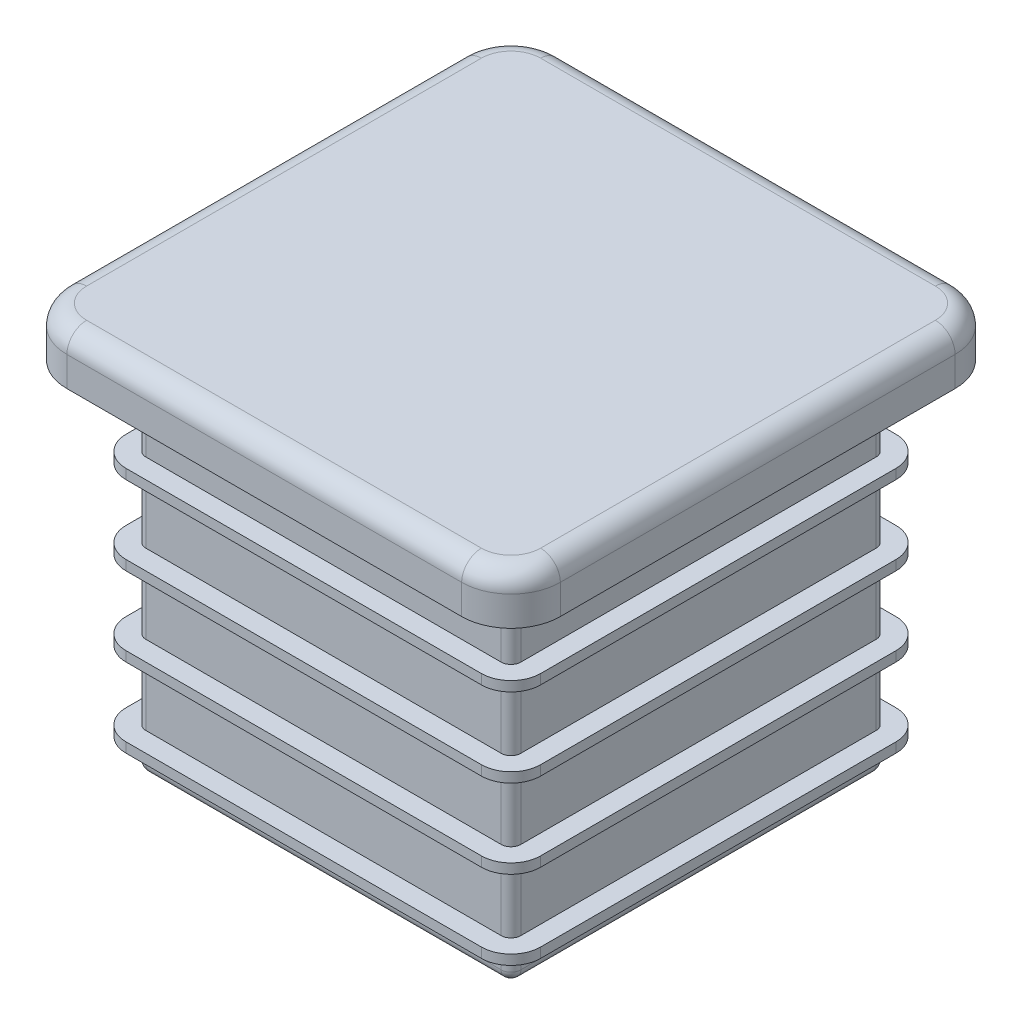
ISO-10303-21;
HEADER;
FILE_DESCRIPTION(('STEP AP214'),'2;1');
FILE_NAME('part.step','',(''),(''),'','','');
FILE_SCHEMA(('AUTOMOTIVE_DESIGN { 1 0 10303 214 1 1 1 1 }'));
ENDSEC;
DATA;
#1=APPLICATION_CONTEXT('core data for automotive mechanical design processes');
#2=APPLICATION_PROTOCOL_DEFINITION('international standard','automotive_design',2000,#1);
#3=PRODUCT_CONTEXT('',#1,'mechanical');
#4=PRODUCT('Part','Part','',(#3));
#5=PRODUCT_RELATED_PRODUCT_CATEGORY('part','',(#4));
#6=PRODUCT_DEFINITION_FORMATION('','',#4);
#7=PRODUCT_DEFINITION_CONTEXT('part definition',#1,'design');
#8=PRODUCT_DEFINITION('design','',#6,#7);
#9=PRODUCT_DEFINITION_SHAPE('','',#8);
#10=(LENGTH_UNIT() NAMED_UNIT(*) SI_UNIT(.MILLI.,.METRE.));
#11=(NAMED_UNIT(*) PLANE_ANGLE_UNIT() SI_UNIT($,.RADIAN.));
#12=(NAMED_UNIT(*) SI_UNIT($,.STERADIAN.) SOLID_ANGLE_UNIT());
#13=UNCERTAINTY_MEASURE_WITH_UNIT(LENGTH_MEASURE(1.E-05),#10,'distance_accuracy_value','');
#14=(GEOMETRIC_REPRESENTATION_CONTEXT(3) GLOBAL_UNCERTAINTY_ASSIGNED_CONTEXT((#13)) GLOBAL_UNIT_ASSIGNED_CONTEXT((#10,
#11,#12)) REPRESENTATION_CONTEXT('',''));
#15=CARTESIAN_POINT('',(0.,0.,0.));
#16=DIRECTION('',(0.,0.,1.));
#17=DIRECTION('',(1.,0.,0.));
#18=AXIS2_PLACEMENT_3D('',#15,#16,#17);
#19=CARTESIAN_POINT('',(9.5,-18.,9.5));
#20=DIRECTION('',(-1.,0.,0.));
#21=DIRECTION('',(0.,0.,1.));
#22=AXIS2_PLACEMENT_3D('',#19,#20,#21);
#23=PLANE('',#22);
#24=DIRECTION('',(0.,0.,1.));
#25=VECTOR('',#24,1.);
#26=CARTESIAN_POINT('',(9.50000000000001,-16.,-9.));
#27=LINE('',#26,#25);
#28=CARTESIAN_POINT('',(9.50000000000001,-16.,-9.));
#29=VERTEX_POINT('',#28);
#30=CARTESIAN_POINT('',(9.5,-16.,9.));
#31=VERTEX_POINT('',#30);
#32=EDGE_CURVE('E661',#29,#31,#27,.T.);
#33=ORIENTED_EDGE('',*,*,#32,.F.);
#34=DIRECTION('',(0.,1.,0.));
#35=VECTOR('',#34,1.);
#36=CARTESIAN_POINT('',(9.50000000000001,-18.,-9.));
#37=LINE('',#36,#35);
#38=CARTESIAN_POINT('',(9.50000000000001,-12.5,-9.));
#39=VERTEX_POINT('',#38);
#40=EDGE_CURVE('E1187',#29,#39,#37,.T.);
#41=ORIENTED_EDGE('',*,*,#40,.T.);
#42=DIRECTION('',(0.,0.,1.));
#43=VECTOR('',#42,1.);
#44=CARTESIAN_POINT('',(9.50000000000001,-12.5,-9.));
#45=LINE('',#44,#43);
#46=CARTESIAN_POINT('',(9.5,-12.5,9.));
#47=VERTEX_POINT('',#46);
#48=EDGE_CURVE('E742',#39,#47,#45,.T.);
#49=ORIENTED_EDGE('',*,*,#48,.T.);
#50=DIRECTION('',(0.,1.,0.));
#51=VECTOR('',#50,1.);
#52=CARTESIAN_POINT('',(9.5,-18.,9.));
#53=LINE('',#52,#51);
#54=EDGE_CURVE('E1453',#47,#31,#53,.F.);
#55=ORIENTED_EDGE('',*,*,#54,.T.);
#56=EDGE_LOOP('',(#33,#41,#49,#55));
#57=FACE_BOUND('',#56,.T.);
#58=ADVANCED_FACE('F58',(#57),#23,.F.);
#59=CARTESIAN_POINT('',(-9.5,-18.,9.5));
#60=DIRECTION('',(0.,0.,-1.));
#61=DIRECTION('',(-1.,0.,0.));
#62=AXIS2_PLACEMENT_3D('',#59,#60,#61);
#63=PLANE('',#62);
#64=DIRECTION('',(-1.,0.,0.));
#65=VECTOR('',#64,1.);
#66=CARTESIAN_POINT('',(9.,-16.,9.5));
#67=LINE('',#66,#65);
#68=CARTESIAN_POINT('',(9.,-16.,9.5));
#69=VERTEX_POINT('',#68);
#70=CARTESIAN_POINT('',(-9.,-16.,9.5));
#71=VERTEX_POINT('',#70);
#72=EDGE_CURVE('E665',#69,#71,#67,.T.);
#73=ORIENTED_EDGE('',*,*,#72,.F.);
#74=DIRECTION('',(0.,1.,0.));
#75=VECTOR('',#74,1.);
#76=CARTESIAN_POINT('',(9.,-18.,9.5));
#77=LINE('',#76,#75);
#78=CARTESIAN_POINT('',(9.,-12.5,9.5));
#79=VERTEX_POINT('',#78);
#80=EDGE_CURVE('E1174',#69,#79,#77,.T.);
#81=ORIENTED_EDGE('',*,*,#80,.T.);
#82=DIRECTION('',(-1.,0.,0.));
#83=VECTOR('',#82,1.);
#84=CARTESIAN_POINT('',(9.,-12.5,9.5));
#85=LINE('',#84,#83);
#86=CARTESIAN_POINT('',(-9.,-12.5,9.5));
#87=VERTEX_POINT('',#86);
#88=EDGE_CURVE('E748',#79,#87,#85,.T.);
#89=ORIENTED_EDGE('',*,*,#88,.T.);
#90=DIRECTION('',(0.,1.,0.));
#91=VECTOR('',#90,1.);
#92=CARTESIAN_POINT('',(-9.,-18.,9.5));
#93=LINE('',#92,#91);
#94=EDGE_CURVE('E1482',#87,#71,#93,.F.);
#95=ORIENTED_EDGE('',*,*,#94,.T.);
#96=EDGE_LOOP('',(#73,#81,#89,#95));
#97=FACE_BOUND('',#96,.T.);
#98=ADVANCED_FACE('F1301',(#97),#63,.F.);
#99=CARTESIAN_POINT('',(9.,-18.,9.));
#100=DIRECTION('',(0.,1.,0.));
#101=DIRECTION('',(0.,0.,1.));
#102=AXIS2_PLACEMENT_3D('',#99,#100,#101);
#103=CYLINDRICAL_SURFACE('',#102,0.5);
#104=ORIENTED_EDGE('',*,*,#80,.F.);
#105=CARTESIAN_POINT('',(9.,-16.,9.));
#106=DIRECTION('',(0.,-1.,0.));
#107=DIRECTION('',(0.,0.,-1.));
#108=AXIS2_PLACEMENT_3D('',#105,#106,#107);
#109=CIRCLE('',#108,0.5);
#110=EDGE_CURVE('E663',#31,#69,#109,.T.);
#111=ORIENTED_EDGE('',*,*,#110,.F.);
#112=ORIENTED_EDGE('',*,*,#54,.F.);
#113=CARTESIAN_POINT('',(9.,-12.5,9.));
#114=DIRECTION('',(0.,-1.,0.));
#115=DIRECTION('',(0.,0.,-1.));
#116=AXIS2_PLACEMENT_3D('',#113,#114,#115);
#117=CIRCLE('',#116,0.5);
#118=EDGE_CURVE('E745',#47,#79,#117,.T.);
#119=ORIENTED_EDGE('',*,*,#118,.T.);
#120=EDGE_LOOP('',(#104,#111,#112,#119));
#121=FACE_BOUND('',#120,.T.);
#122=ADVANCED_FACE('F1309',(#121),#103,.T.);
#123=CARTESIAN_POINT('',(-9.5,-18.,9.5));
#124=DIRECTION('',(1.,0.,0.));
#125=DIRECTION('',(0.,0.,-1.));
#126=AXIS2_PLACEMENT_3D('',#123,#124,#125);
#127=PLANE('',#126);
#128=DIRECTION('',(0.,0.,-1.));
#129=VECTOR('',#128,1.);
#130=CARTESIAN_POINT('',(-9.5,-16.,9.));
#131=LINE('',#130,#129);
#132=CARTESIAN_POINT('',(-9.5,-16.,9.));
#133=VERTEX_POINT('',#132);
#134=CARTESIAN_POINT('',(-9.49999999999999,-16.,-9.));
#135=VERTEX_POINT('',#134);
#136=EDGE_CURVE('E653',#133,#135,#131,.T.);
#137=ORIENTED_EDGE('',*,*,#136,.F.);
#138=DIRECTION('',(0.,1.,0.));
#139=VECTOR('',#138,1.);
#140=CARTESIAN_POINT('',(-9.5,-18.,9.));
#141=LINE('',#140,#139);
#142=CARTESIAN_POINT('',(-9.5,-12.5,9.));
#143=VERTEX_POINT('',#142);
#144=EDGE_CURVE('E1170',#133,#143,#141,.T.);
#145=ORIENTED_EDGE('',*,*,#144,.T.);
#146=DIRECTION('',(0.,0.,-1.));
#147=VECTOR('',#146,1.);
#148=CARTESIAN_POINT('',(-9.5,-12.5,9.));
#149=LINE('',#148,#147);
#150=CARTESIAN_POINT('',(-9.49999999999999,-12.5,-9.));
#151=VERTEX_POINT('',#150);
#152=EDGE_CURVE('E729',#143,#151,#149,.T.);
#153=ORIENTED_EDGE('',*,*,#152,.T.);
#154=DIRECTION('',(0.,1.,0.));
#155=VECTOR('',#154,1.);
#156=CARTESIAN_POINT('',(-9.49999999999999,-18.,-9.));
#157=LINE('',#156,#155);
#158=EDGE_CURVE('E1420',#151,#135,#157,.F.);
#159=ORIENTED_EDGE('',*,*,#158,.T.);
#160=EDGE_LOOP('',(#137,#145,#153,#159));
#161=FACE_BOUND('',#160,.T.);
#162=ADVANCED_FACE('F1493',(#161),#127,.F.);
#163=CARTESIAN_POINT('',(-9.,-18.,9.));
#164=DIRECTION('',(0.,1.,0.));
#165=DIRECTION('',(0.,0.,1.));
#166=AXIS2_PLACEMENT_3D('',#163,#164,#165);
#167=CYLINDRICAL_SURFACE('',#166,0.5);
#168=ORIENTED_EDGE('',*,*,#144,.F.);
#169=CARTESIAN_POINT('',(-9.,-16.,9.));
#170=DIRECTION('',(0.,-1.,0.));
#171=DIRECTION('',(0.,0.,-1.));
#172=AXIS2_PLACEMENT_3D('',#169,#170,#171);
#173=CIRCLE('',#172,0.5);
#174=EDGE_CURVE('E651',#71,#133,#173,.T.);
#175=ORIENTED_EDGE('',*,*,#174,.F.);
#176=ORIENTED_EDGE('',*,*,#94,.F.);
#177=CARTESIAN_POINT('',(-9.,-12.5,9.));
#178=DIRECTION('',(0.,-1.,0.));
#179=DIRECTION('',(0.,0.,-1.));
#180=AXIS2_PLACEMENT_3D('',#177,#178,#179);
#181=CIRCLE('',#180,0.5);
#182=EDGE_CURVE('E726',#87,#143,#181,.T.);
#183=ORIENTED_EDGE('',*,*,#182,.T.);
#184=EDGE_LOOP('',(#168,#175,#176,#183));
#185=FACE_BOUND('',#184,.T.);
#186=ADVANCED_FACE('F1492',(#185),#167,.T.);
#187=CARTESIAN_POINT('',(-9.49999999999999,-18.,-9.5));
#188=DIRECTION('',(0.,0.,1.));
#189=DIRECTION('',(1.,0.,0.));
#190=AXIS2_PLACEMENT_3D('',#187,#188,#189);
#191=PLANE('',#190);
#192=DIRECTION('',(1.,0.,0.));
#193=VECTOR('',#192,1.);
#194=CARTESIAN_POINT('',(-8.99999999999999,-16.,-9.5));
#195=LINE('',#194,#193);
#196=CARTESIAN_POINT('',(-8.99999999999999,-16.,-9.5));
#197=VERTEX_POINT('',#196);
#198=CARTESIAN_POINT('',(9.00000000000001,-16.,-9.5));
#199=VERTEX_POINT('',#198);
#200=EDGE_CURVE('E657',#197,#199,#195,.T.);
#201=ORIENTED_EDGE('',*,*,#200,.F.);
#202=DIRECTION('',(0.,1.,0.));
#203=VECTOR('',#202,1.);
#204=CARTESIAN_POINT('',(-8.99999999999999,-18.,-9.5));
#205=LINE('',#204,#203);
#206=CARTESIAN_POINT('',(-8.99999999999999,-12.5,-9.5));
#207=VERTEX_POINT('',#206);
#208=EDGE_CURVE('E1183',#197,#207,#205,.T.);
#209=ORIENTED_EDGE('',*,*,#208,.T.);
#210=DIRECTION('',(1.,0.,0.));
#211=VECTOR('',#210,1.);
#212=CARTESIAN_POINT('',(-8.99999999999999,-12.5,-9.5));
#213=LINE('',#212,#211);
#214=CARTESIAN_POINT('',(9.00000000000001,-12.5,-9.5));
#215=VERTEX_POINT('',#214);
#216=EDGE_CURVE('E736',#207,#215,#213,.T.);
#217=ORIENTED_EDGE('',*,*,#216,.T.);
#218=DIRECTION('',(0.,1.,0.));
#219=VECTOR('',#218,1.);
#220=CARTESIAN_POINT('',(9.00000000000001,-18.,-9.5));
#221=LINE('',#220,#219);
#222=EDGE_CURVE('E627',#215,#199,#221,.F.);
#223=ORIENTED_EDGE('',*,*,#222,.T.);
#224=EDGE_LOOP('',(#201,#209,#217,#223));
#225=FACE_BOUND('',#224,.T.);
#226=ADVANCED_FACE('F1408',(#225),#191,.F.);
#227=CARTESIAN_POINT('',(-8.99999999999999,-18.,-9.));
#228=DIRECTION('',(0.,1.,0.));
#229=DIRECTION('',(0.,0.,1.));
#230=AXIS2_PLACEMENT_3D('',#227,#228,#229);
#231=CYLINDRICAL_SURFACE('',#230,0.5);
#232=ORIENTED_EDGE('',*,*,#208,.F.);
#233=CARTESIAN_POINT('',(-8.99999999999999,-16.,-9.));
#234=DIRECTION('',(0.,-1.,0.));
#235=DIRECTION('',(0.,0.,-1.));
#236=AXIS2_PLACEMENT_3D('',#233,#234,#235);
#237=CIRCLE('',#236,0.5);
#238=EDGE_CURVE('E655',#135,#197,#237,.T.);
#239=ORIENTED_EDGE('',*,*,#238,.F.);
#240=ORIENTED_EDGE('',*,*,#158,.F.);
#241=CARTESIAN_POINT('',(-8.99999999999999,-12.5,-9.));
#242=DIRECTION('',(0.,-1.,0.));
#243=DIRECTION('',(0.,0.,-1.));
#244=AXIS2_PLACEMENT_3D('',#241,#242,#243);
#245=CIRCLE('',#244,0.5);
#246=EDGE_CURVE('E733',#151,#207,#245,.T.);
#247=ORIENTED_EDGE('',*,*,#246,.T.);
#248=EDGE_LOOP('',(#232,#239,#240,#247));
#249=FACE_BOUND('',#248,.T.);
#250=ADVANCED_FACE('F1418',(#249),#231,.T.);
#251=CARTESIAN_POINT('',(9.00000000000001,-18.,-9.));
#252=DIRECTION('',(0.,1.,0.));
#253=DIRECTION('',(0.,0.,1.));
#254=AXIS2_PLACEMENT_3D('',#251,#252,#253);
#255=CYLINDRICAL_SURFACE('',#254,0.5);
#256=ORIENTED_EDGE('',*,*,#40,.F.);
#257=CARTESIAN_POINT('',(9.00000000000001,-16.,-9.));
#258=DIRECTION('',(0.,-1.,0.));
#259=DIRECTION('',(0.,0.,-1.));
#260=AXIS2_PLACEMENT_3D('',#257,#258,#259);
#261=CIRCLE('',#260,0.5);
#262=EDGE_CURVE('E659',#199,#29,#261,.T.);
#263=ORIENTED_EDGE('',*,*,#262,.F.);
#264=ORIENTED_EDGE('',*,*,#222,.F.);
#265=CARTESIAN_POINT('',(9.00000000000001,-12.5,-9.));
#266=DIRECTION('',(0.,-1.,0.));
#267=DIRECTION('',(0.,0.,-1.));
#268=AXIS2_PLACEMENT_3D('',#265,#266,#267);
#269=CIRCLE('',#268,0.5);
#270=EDGE_CURVE('E739',#215,#39,#269,.T.);
#271=ORIENTED_EDGE('',*,*,#270,.T.);
#272=EDGE_LOOP('',(#256,#263,#264,#271));
#273=FACE_BOUND('',#272,.T.);
#274=ADVANCED_FACE('F1447',(#273),#255,.T.);
#275=CARTESIAN_POINT('',(9.50000000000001,-12.,-9.));
#276=VERTEX_POINT('',#275);
#277=CARTESIAN_POINT('',(9.50000000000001,-8.5,-9.));
#278=VERTEX_POINT('',#277);
#279=EDGE_CURVE('E1358',#276,#278,#37,.T.);
#280=ORIENTED_EDGE('',*,*,#279,.F.);
#281=CARTESIAN_POINT('',(9.00000000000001,-12.,-9.));
#282=DIRECTION('',(0.,-1.,0.));
#283=DIRECTION('',(0.,0.,-1.));
#284=AXIS2_PLACEMENT_3D('',#281,#282,#283);
#285=CIRCLE('',#284,0.5);
#286=CARTESIAN_POINT('',(9.00000000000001,-12.,-9.5));
#287=VERTEX_POINT('',#286);
#288=EDGE_CURVE('E763',#287,#276,#285,.T.);
#289=ORIENTED_EDGE('',*,*,#288,.F.);
#290=CARTESIAN_POINT('',(9.00000000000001,-8.5,-9.5));
#291=VERTEX_POINT('',#290);
#292=EDGE_CURVE('E1442',#291,#287,#221,.F.);
#293=ORIENTED_EDGE('',*,*,#292,.F.);
#294=CARTESIAN_POINT('',(9.00000000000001,-8.5,-9.));
#295=DIRECTION('',(0.,-1.,0.));
#296=DIRECTION('',(0.,0.,-1.));
#297=AXIS2_PLACEMENT_3D('',#294,#295,#296);
#298=CIRCLE('',#297,0.5);
#299=EDGE_CURVE('E844',#291,#278,#298,.T.);
#300=ORIENTED_EDGE('',*,*,#299,.T.);
#301=EDGE_LOOP('',(#280,#289,#293,#300));
#302=FACE_BOUND('',#301,.T.);
#303=ADVANCED_FACE('F1468',(#302),#255,.T.);
#304=CARTESIAN_POINT('',(-8.99999999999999,-12.,-9.5));
#305=VERTEX_POINT('',#304);
#306=CARTESIAN_POINT('',(-8.99999999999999,-8.5,-9.5));
#307=VERTEX_POINT('',#306);
#308=EDGE_CURVE('E1398',#305,#307,#205,.T.);
#309=ORIENTED_EDGE('',*,*,#308,.F.);
#310=CARTESIAN_POINT('',(-8.99999999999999,-12.,-9.));
#311=DIRECTION('',(0.,-1.,0.));
#312=DIRECTION('',(0.,0.,-1.));
#313=AXIS2_PLACEMENT_3D('',#310,#311,#312);
#314=CIRCLE('',#313,0.5);
#315=CARTESIAN_POINT('',(-9.49999999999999,-12.,-9.));
#316=VERTEX_POINT('',#315);
#317=EDGE_CURVE('E757',#316,#305,#314,.T.);
#318=ORIENTED_EDGE('',*,*,#317,.F.);
#319=CARTESIAN_POINT('',(-9.49999999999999,-8.5,-9.));
#320=VERTEX_POINT('',#319);
#321=EDGE_CURVE('E1423',#320,#316,#157,.F.);
#322=ORIENTED_EDGE('',*,*,#321,.F.);
#323=CARTESIAN_POINT('',(-8.99999999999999,-8.5,-9.));
#324=DIRECTION('',(0.,-1.,0.));
#325=DIRECTION('',(0.,0.,-1.));
#326=AXIS2_PLACEMENT_3D('',#323,#324,#325);
#327=CIRCLE('',#326,0.5);
#328=EDGE_CURVE('E838',#320,#307,#327,.T.);
#329=ORIENTED_EDGE('',*,*,#328,.T.);
#330=EDGE_LOOP('',(#309,#318,#322,#329));
#331=FACE_BOUND('',#330,.T.);
#332=ADVANCED_FACE('F1634',(#331),#231,.T.);
#333=DIRECTION('',(1.,0.,0.));
#334=VECTOR('',#333,1.);
#335=CARTESIAN_POINT('',(-8.99999999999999,-12.,-9.5));
#336=LINE('',#335,#334);
#337=EDGE_CURVE('E760',#305,#287,#336,.T.);
#338=ORIENTED_EDGE('',*,*,#337,.F.);
#339=ORIENTED_EDGE('',*,*,#308,.T.);
#340=DIRECTION('',(1.,0.,0.));
#341=VECTOR('',#340,1.);
#342=CARTESIAN_POINT('',(-8.99999999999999,-8.5,-9.5));
#343=LINE('',#342,#341);
#344=EDGE_CURVE('E841',#307,#291,#343,.T.);
#345=ORIENTED_EDGE('',*,*,#344,.T.);
#346=ORIENTED_EDGE('',*,*,#292,.T.);
#347=EDGE_LOOP('',(#338,#339,#345,#346));
#348=FACE_BOUND('',#347,.T.);
#349=ADVANCED_FACE('F1627',(#348),#191,.F.);
#350=CARTESIAN_POINT('',(-9.5,-12.,9.));
#351=VERTEX_POINT('',#350);
#352=CARTESIAN_POINT('',(-9.5,-8.5,9.));
#353=VERTEX_POINT('',#352);
#354=EDGE_CURVE('E1494',#351,#353,#141,.T.);
#355=ORIENTED_EDGE('',*,*,#354,.F.);
#356=CARTESIAN_POINT('',(-9.,-12.,9.));
#357=DIRECTION('',(0.,-1.,0.));
#358=DIRECTION('',(0.,0.,-1.));
#359=AXIS2_PLACEMENT_3D('',#356,#357,#358);
#360=CIRCLE('',#359,0.5);
#361=CARTESIAN_POINT('',(-9.,-12.,9.5));
#362=VERTEX_POINT('',#361);
#363=EDGE_CURVE('E725',#362,#351,#360,.T.);
#364=ORIENTED_EDGE('',*,*,#363,.F.);
#365=CARTESIAN_POINT('',(-9.,-8.5,9.5));
#366=VERTEX_POINT('',#365);
#367=EDGE_CURVE('E1478',#366,#362,#93,.F.);
#368=ORIENTED_EDGE('',*,*,#367,.F.);
#369=CARTESIAN_POINT('',(-9.,-8.5,9.));
#370=DIRECTION('',(0.,-1.,0.));
#371=DIRECTION('',(0.,0.,-1.));
#372=AXIS2_PLACEMENT_3D('',#369,#370,#371);
#373=CIRCLE('',#372,0.5);
#374=EDGE_CURVE('E832',#366,#353,#373,.T.);
#375=ORIENTED_EDGE('',*,*,#374,.T.);
#376=EDGE_LOOP('',(#355,#364,#368,#375));
#377=FACE_BOUND('',#376,.T.);
#378=ADVANCED_FACE('F1481',(#377),#167,.T.);
#379=DIRECTION('',(0.,0.,-1.));
#380=VECTOR('',#379,1.);
#381=CARTESIAN_POINT('',(-9.5,-12.,9.));
#382=LINE('',#381,#380);
#383=EDGE_CURVE('E754',#351,#316,#382,.T.);
#384=ORIENTED_EDGE('',*,*,#383,.F.);
#385=ORIENTED_EDGE('',*,*,#354,.T.);
#386=DIRECTION('',(0.,0.,-1.));
#387=VECTOR('',#386,1.);
#388=CARTESIAN_POINT('',(-9.5,-8.5,9.));
#389=LINE('',#388,#387);
#390=EDGE_CURVE('E835',#353,#320,#389,.T.);
#391=ORIENTED_EDGE('',*,*,#390,.T.);
#392=ORIENTED_EDGE('',*,*,#321,.T.);
#393=EDGE_LOOP('',(#384,#385,#391,#392));
#394=FACE_BOUND('',#393,.T.);
#395=ADVANCED_FACE('F1617',(#394),#127,.F.);
#396=CARTESIAN_POINT('',(9.,-12.,9.5));
#397=VERTEX_POINT('',#396);
#398=CARTESIAN_POINT('',(9.,-8.5,9.5));
#399=VERTEX_POINT('',#398);
#400=EDGE_CURVE('E1464',#397,#399,#77,.T.);
#401=ORIENTED_EDGE('',*,*,#400,.F.);
#402=CARTESIAN_POINT('',(9.,-12.,9.));
#403=DIRECTION('',(0.,-1.,0.));
#404=DIRECTION('',(0.,0.,-1.));
#405=AXIS2_PLACEMENT_3D('',#402,#403,#404);
#406=CIRCLE('',#405,0.5);
#407=CARTESIAN_POINT('',(9.5,-12.,9.));
#408=VERTEX_POINT('',#407);
#409=EDGE_CURVE('E769',#408,#397,#406,.T.);
#410=ORIENTED_EDGE('',*,*,#409,.F.);
#411=CARTESIAN_POINT('',(9.5,-8.5,9.));
#412=VERTEX_POINT('',#411);
#413=EDGE_CURVE('E1455',#412,#408,#53,.F.);
#414=ORIENTED_EDGE('',*,*,#413,.F.);
#415=CARTESIAN_POINT('',(9.,-8.5,9.));
#416=DIRECTION('',(0.,-1.,0.));
#417=DIRECTION('',(0.,0.,-1.));
#418=AXIS2_PLACEMENT_3D('',#415,#416,#417);
#419=CIRCLE('',#418,0.5);
#420=EDGE_CURVE('E849',#412,#399,#419,.T.);
#421=ORIENTED_EDGE('',*,*,#420,.T.);
#422=EDGE_LOOP('',(#401,#410,#414,#421));
#423=FACE_BOUND('',#422,.T.);
#424=ADVANCED_FACE('F1463',(#423),#103,.T.);
#425=DIRECTION('',(-1.,0.,0.));
#426=VECTOR('',#425,1.);
#427=CARTESIAN_POINT('',(9.,-12.,9.5));
#428=LINE('',#427,#426);
#429=EDGE_CURVE('E730',#397,#362,#428,.T.);
#430=ORIENTED_EDGE('',*,*,#429,.F.);
#431=ORIENTED_EDGE('',*,*,#400,.T.);
#432=DIRECTION('',(-1.,0.,0.));
#433=VECTOR('',#432,1.);
#434=CARTESIAN_POINT('',(9.,-8.5,9.5));
#435=LINE('',#434,#433);
#436=EDGE_CURVE('E852',#399,#366,#435,.T.);
#437=ORIENTED_EDGE('',*,*,#436,.T.);
#438=ORIENTED_EDGE('',*,*,#367,.T.);
#439=EDGE_LOOP('',(#430,#431,#437,#438));
#440=FACE_BOUND('',#439,.T.);
#441=ADVANCED_FACE('F1312',(#440),#63,.F.);
#442=DIRECTION('',(0.,0.,1.));
#443=VECTOR('',#442,1.);
#444=CARTESIAN_POINT('',(9.50000000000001,-12.,-9.));
#445=LINE('',#444,#443);
#446=EDGE_CURVE('E766',#276,#408,#445,.T.);
#447=ORIENTED_EDGE('',*,*,#446,.F.);
#448=ORIENTED_EDGE('',*,*,#279,.T.);
#449=DIRECTION('',(0.,0.,1.));
#450=VECTOR('',#449,1.);
#451=CARTESIAN_POINT('',(9.50000000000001,-8.5,-9.));
#452=LINE('',#451,#450);
#453=EDGE_CURVE('E847',#278,#412,#452,.T.);
#454=ORIENTED_EDGE('',*,*,#453,.T.);
#455=ORIENTED_EDGE('',*,*,#413,.T.);
#456=EDGE_LOOP('',(#447,#448,#454,#455));
#457=FACE_BOUND('',#456,.T.);
#458=ADVANCED_FACE('F1304',(#457),#23,.F.);
#459=DIRECTION('',(0.,0.,1.));
#460=VECTOR('',#459,1.);
#461=CARTESIAN_POINT('',(9.50000000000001,-8.,-9.));
#462=LINE('',#461,#460);
#463=CARTESIAN_POINT('',(9.50000000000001,-8.,-9.));
#464=VERTEX_POINT('',#463);
#465=CARTESIAN_POINT('',(9.5,-8.,9.));
#466=VERTEX_POINT('',#465);
#467=EDGE_CURVE('E864',#464,#466,#462,.T.);
#468=ORIENTED_EDGE('',*,*,#467,.F.);
#469=CARTESIAN_POINT('',(9.50000000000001,-4.5,-9.));
#470=VERTEX_POINT('',#469);
#471=EDGE_CURVE('E1348',#464,#470,#37,.T.);
#472=ORIENTED_EDGE('',*,*,#471,.T.);
#473=DIRECTION('',(0.,0.,1.));
#474=VECTOR('',#473,1.);
#475=CARTESIAN_POINT('',(9.50000000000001,-4.5,-9.));
#476=LINE('',#475,#474);
#477=CARTESIAN_POINT('',(9.5,-4.5,9.));
#478=VERTEX_POINT('',#477);
#479=EDGE_CURVE('E942',#470,#478,#476,.T.);
#480=ORIENTED_EDGE('',*,*,#479,.T.);
#481=EDGE_CURVE('E1192',#478,#466,#53,.F.);
#482=ORIENTED_EDGE('',*,*,#481,.T.);
#483=EDGE_LOOP('',(#468,#472,#480,#482));
#484=FACE_BOUND('',#483,.T.);
#485=ADVANCED_FACE('F1316',(#484),#23,.F.);
#486=DIRECTION('',(-1.,0.,0.));
#487=VECTOR('',#486,1.);
#488=CARTESIAN_POINT('',(9.,-8.,9.5));
#489=LINE('',#488,#487);
#490=CARTESIAN_POINT('',(9.,-8.,9.5));
#491=VERTEX_POINT('',#490);
#492=CARTESIAN_POINT('',(-9.,-8.,9.5));
#493=VERTEX_POINT('',#492);
#494=EDGE_CURVE('E836',#491,#493,#489,.T.);
#495=ORIENTED_EDGE('',*,*,#494,.F.);
#496=CARTESIAN_POINT('',(9.,-4.5,9.5));
#497=VERTEX_POINT('',#496);
#498=EDGE_CURVE('E1495',#491,#497,#77,.T.);
#499=ORIENTED_EDGE('',*,*,#498,.T.);
#500=DIRECTION('',(-1.,0.,0.));
#501=VECTOR('',#500,1.);
#502=CARTESIAN_POINT('',(9.,-4.5,9.5));
#503=LINE('',#502,#501);
#504=CARTESIAN_POINT('',(-9.,-4.5,9.5));
#505=VERTEX_POINT('',#504);
#506=EDGE_CURVE('E947',#497,#505,#503,.T.);
#507=ORIENTED_EDGE('',*,*,#506,.T.);
#508=EDGE_CURVE('E1176',#505,#493,#93,.F.);
#509=ORIENTED_EDGE('',*,*,#508,.T.);
#510=EDGE_LOOP('',(#495,#499,#507,#509));
#511=FACE_BOUND('',#510,.T.);
#512=ADVANCED_FACE('F1336',(#511),#63,.F.);
#513=DIRECTION('',(0.,0.,-1.));
#514=VECTOR('',#513,1.);
#515=CARTESIAN_POINT('',(-9.5,-8.,9.));
#516=LINE('',#515,#514);
#517=CARTESIAN_POINT('',(-9.5,-8.,9.));
#518=VERTEX_POINT('',#517);
#519=CARTESIAN_POINT('',(-9.49999999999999,-8.,-9.));
#520=VERTEX_POINT('',#519);
#521=EDGE_CURVE('E856',#518,#520,#516,.T.);
#522=ORIENTED_EDGE('',*,*,#521,.F.);
#523=CARTESIAN_POINT('',(-9.5,-4.5,9.));
#524=VERTEX_POINT('',#523);
#525=EDGE_CURVE('E1506',#518,#524,#141,.T.);
#526=ORIENTED_EDGE('',*,*,#525,.T.);
#527=DIRECTION('',(0.,0.,-1.));
#528=VECTOR('',#527,1.);
#529=CARTESIAN_POINT('',(-9.5,-4.5,9.));
#530=LINE('',#529,#528);
#531=CARTESIAN_POINT('',(-9.49999999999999,-4.5,-9.));
#532=VERTEX_POINT('',#531);
#533=EDGE_CURVE('E930',#524,#532,#530,.T.);
#534=ORIENTED_EDGE('',*,*,#533,.T.);
#535=EDGE_CURVE('E1165',#532,#520,#157,.F.);
#536=ORIENTED_EDGE('',*,*,#535,.T.);
#537=EDGE_LOOP('',(#522,#526,#534,#536));
#538=FACE_BOUND('',#537,.T.);
#539=ADVANCED_FACE('F1343',(#538),#127,.F.);
#540=DIRECTION('',(1.,0.,0.));
#541=VECTOR('',#540,1.);
#542=CARTESIAN_POINT('',(-8.99999999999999,-8.,-9.5));
#543=LINE('',#542,#541);
#544=CARTESIAN_POINT('',(-8.99999999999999,-8.,-9.5));
#545=VERTEX_POINT('',#544);
#546=CARTESIAN_POINT('',(9.00000000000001,-8.,-9.5));
#547=VERTEX_POINT('',#546);
#548=EDGE_CURVE('E860',#545,#547,#543,.T.);
#549=ORIENTED_EDGE('',*,*,#548,.F.);
#550=CARTESIAN_POINT('',(-8.99999999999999,-4.5,-9.5));
#551=VERTEX_POINT('',#550);
#552=EDGE_CURVE('E1397',#545,#551,#205,.T.);
#553=ORIENTED_EDGE('',*,*,#552,.T.);
#554=DIRECTION('',(1.,0.,0.));
#555=VECTOR('',#554,1.);
#556=CARTESIAN_POINT('',(-8.99999999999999,-4.5,-9.5));
#557=LINE('',#556,#555);
#558=CARTESIAN_POINT('',(9.00000000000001,-4.5,-9.5));
#559=VERTEX_POINT('',#558);
#560=EDGE_CURVE('E936',#551,#559,#557,.T.);
#561=ORIENTED_EDGE('',*,*,#560,.T.);
#562=EDGE_CURVE('E1180',#559,#547,#221,.F.);
#563=ORIENTED_EDGE('',*,*,#562,.T.);
#564=EDGE_LOOP('',(#549,#553,#561,#563));
#565=FACE_BOUND('',#564,.T.);
#566=ADVANCED_FACE('F1441',(#565),#191,.F.);
#567=ORIENTED_EDGE('',*,*,#525,.F.);
#568=CARTESIAN_POINT('',(-9.,-8.,9.));
#569=DIRECTION('',(0.,-1.,0.));
#570=DIRECTION('',(0.,0.,-1.));
#571=AXIS2_PLACEMENT_3D('',#568,#569,#570);
#572=CIRCLE('',#571,0.5);
#573=EDGE_CURVE('E831',#493,#518,#572,.T.);
#574=ORIENTED_EDGE('',*,*,#573,.F.);
#575=ORIENTED_EDGE('',*,*,#508,.F.);
#576=CARTESIAN_POINT('',(-9.,-4.5,9.));
#577=DIRECTION('',(0.,-1.,0.));
#578=DIRECTION('',(0.,0.,-1.));
#579=AXIS2_PLACEMENT_3D('',#576,#577,#578);
#580=CIRCLE('',#579,0.5);
#581=EDGE_CURVE('E927',#505,#524,#580,.T.);
#582=ORIENTED_EDGE('',*,*,#581,.T.);
#583=EDGE_LOOP('',(#567,#574,#575,#582));
#584=FACE_BOUND('',#583,.T.);
#585=ADVANCED_FACE('F1504',(#584),#167,.T.);
#586=ORIENTED_EDGE('',*,*,#552,.F.);
#587=CARTESIAN_POINT('',(-8.99999999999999,-8.,-9.));
#588=DIRECTION('',(0.,-1.,0.));
#589=DIRECTION('',(0.,0.,-1.));
#590=AXIS2_PLACEMENT_3D('',#587,#588,#589);
#591=CIRCLE('',#590,0.5);
#592=EDGE_CURVE('E858',#520,#545,#591,.T.);
#593=ORIENTED_EDGE('',*,*,#592,.F.);
#594=ORIENTED_EDGE('',*,*,#535,.F.);
#595=CARTESIAN_POINT('',(-8.99999999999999,-4.5,-9.));
#596=DIRECTION('',(0.,-1.,0.));
#597=DIRECTION('',(0.,0.,-1.));
#598=AXIS2_PLACEMENT_3D('',#595,#596,#597);
#599=CIRCLE('',#598,0.5);
#600=EDGE_CURVE('E933',#532,#551,#599,.T.);
#601=ORIENTED_EDGE('',*,*,#600,.T.);
#602=EDGE_LOOP('',(#586,#593,#594,#601));
#603=FACE_BOUND('',#602,.T.);
#604=ADVANCED_FACE('F1436',(#603),#231,.T.);
#605=ORIENTED_EDGE('',*,*,#498,.F.);
#606=CARTESIAN_POINT('',(9.,-8.,9.));
#607=DIRECTION('',(0.,-1.,0.));
#608=DIRECTION('',(0.,0.,-1.));
#609=AXIS2_PLACEMENT_3D('',#606,#607,#608);
#610=CIRCLE('',#609,0.5);
#611=EDGE_CURVE('E866',#466,#491,#610,.T.);
#612=ORIENTED_EDGE('',*,*,#611,.F.);
#613=ORIENTED_EDGE('',*,*,#481,.F.);
#614=CARTESIAN_POINT('',(9.,-4.5,9.));
#615=DIRECTION('',(0.,-1.,0.));
#616=DIRECTION('',(0.,0.,-1.));
#617=AXIS2_PLACEMENT_3D('',#614,#615,#616);
#618=CIRCLE('',#617,0.5);
#619=EDGE_CURVE('E944',#478,#497,#618,.T.);
#620=ORIENTED_EDGE('',*,*,#619,.T.);
#621=EDGE_LOOP('',(#605,#612,#613,#620));
#622=FACE_BOUND('',#621,.T.);
#623=ADVANCED_FACE('F1502',(#622),#103,.T.);
#624=ORIENTED_EDGE('',*,*,#471,.F.);
#625=CARTESIAN_POINT('',(9.00000000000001,-8.,-9.));
#626=DIRECTION('',(0.,-1.,0.));
#627=DIRECTION('',(0.,0.,-1.));
#628=AXIS2_PLACEMENT_3D('',#625,#626,#627);
#629=CIRCLE('',#628,0.5);
#630=EDGE_CURVE('E862',#547,#464,#629,.T.);
#631=ORIENTED_EDGE('',*,*,#630,.F.);
#632=ORIENTED_EDGE('',*,*,#562,.F.);
#633=CARTESIAN_POINT('',(9.00000000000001,-4.5,-9.));
#634=DIRECTION('',(0.,-1.,0.));
#635=DIRECTION('',(0.,0.,-1.));
#636=AXIS2_PLACEMENT_3D('',#633,#634,#635);
#637=CIRCLE('',#636,0.5);
#638=EDGE_CURVE('E939',#559,#470,#637,.T.);
#639=ORIENTED_EDGE('',*,*,#638,.T.);
#640=EDGE_LOOP('',(#624,#631,#632,#639));
#641=FACE_BOUND('',#640,.T.);
#642=ADVANCED_FACE('F1354',(#641),#255,.T.);
#643=CARTESIAN_POINT('',(-9.,-4.5,9.));
#644=DIRECTION('',(0.,-1.,0.));
#645=DIRECTION('',(0.,0.,-1.));
#646=AXIS2_PLACEMENT_3D('',#643,#644,#645);
#647=PLANE('',#646);
#648=CARTESIAN_POINT('',(-9.,-4.5,9.));
#649=DIRECTION('',(0.,-1.,0.));
#650=DIRECTION('',(0.,0.,-1.));
#651=AXIS2_PLACEMENT_3D('',#648,#649,#650);
#652=CIRCLE('',#651,1.5);
#653=CARTESIAN_POINT('',(-9.,-4.5,10.5));
#654=VERTEX_POINT('',#653);
#655=CARTESIAN_POINT('',(-10.5,-4.5,9.));
#656=VERTEX_POINT('',#655);
#657=EDGE_CURVE('E964',#654,#656,#652,.T.);
#658=ORIENTED_EDGE('',*,*,#657,.T.);
#659=DIRECTION('',(0.,0.,-1.));
#660=VECTOR('',#659,1.);
#661=CARTESIAN_POINT('',(-10.5,-4.5,9.));
#662=LINE('',#661,#660);
#663=CARTESIAN_POINT('',(-10.5,-4.5,-9.));
#664=VERTEX_POINT('',#663);
#665=EDGE_CURVE('E967',#656,#664,#662,.T.);
#666=ORIENTED_EDGE('',*,*,#665,.T.);
#667=CARTESIAN_POINT('',(-8.99999999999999,-4.5,-9.));
#668=DIRECTION('',(0.,-1.,0.));
#669=DIRECTION('',(0.,0.,-1.));
#670=AXIS2_PLACEMENT_3D('',#667,#668,#669);
#671=CIRCLE('',#670,1.5);
#672=CARTESIAN_POINT('',(-8.99999999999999,-4.5,-10.5));
#673=VERTEX_POINT('',#672);
#674=EDGE_CURVE('E970',#664,#673,#671,.T.);
#675=ORIENTED_EDGE('',*,*,#674,.T.);
#676=DIRECTION('',(1.,0.,0.));
#677=VECTOR('',#676,1.);
#678=CARTESIAN_POINT('',(-8.99999999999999,-4.5,-10.5));
#679=LINE('',#678,#677);
#680=CARTESIAN_POINT('',(9.00000000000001,-4.5,-10.5));
#681=VERTEX_POINT('',#680);
#682=EDGE_CURVE('E972',#673,#681,#679,.T.);
#683=ORIENTED_EDGE('',*,*,#682,.T.);
#684=CARTESIAN_POINT('',(9.00000000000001,-4.5,-9.));
#685=DIRECTION('',(0.,-1.,0.));
#686=DIRECTION('',(0.,0.,-1.));
#687=AXIS2_PLACEMENT_3D('',#684,#685,#686);
#688=CIRCLE('',#687,1.5);
#689=CARTESIAN_POINT('',(10.5,-4.5,-9.));
#690=VERTEX_POINT('',#689);
#691=EDGE_CURVE('E974',#681,#690,#688,.T.);
#692=ORIENTED_EDGE('',*,*,#691,.T.);
#693=DIRECTION('',(0.,0.,1.));
#694=VECTOR('',#693,1.);
#695=CARTESIAN_POINT('',(10.5,-4.5,-9.));
#696=LINE('',#695,#694);
#697=CARTESIAN_POINT('',(10.5,-4.5,9.));
#698=VERTEX_POINT('',#697);
#699=EDGE_CURVE('E976',#690,#698,#696,.T.);
#700=ORIENTED_EDGE('',*,*,#699,.T.);
#701=CARTESIAN_POINT('',(9.,-4.5,9.));
#702=DIRECTION('',(0.,-1.,0.));
#703=DIRECTION('',(0.,0.,-1.));
#704=AXIS2_PLACEMENT_3D('',#701,#702,#703);
#705=CIRCLE('',#704,1.5);
#706=CARTESIAN_POINT('',(9.,-4.5,10.5));
#707=VERTEX_POINT('',#706);
#708=EDGE_CURVE('E978',#698,#707,#705,.T.);
#709=ORIENTED_EDGE('',*,*,#708,.T.);
#710=DIRECTION('',(-1.,0.,0.));
#711=VECTOR('',#710,1.);
#712=CARTESIAN_POINT('',(9.,-4.5,10.5));
#713=LINE('',#712,#711);
#714=EDGE_CURVE('E980',#707,#654,#713,.T.);
#715=ORIENTED_EDGE('',*,*,#714,.T.);
#716=EDGE_LOOP('',(#658,#666,#675,#683,#692,#700,#709,#715));
#717=FACE_BOUND('',#716,.T.);
#718=ORIENTED_EDGE('',*,*,#533,.F.);
#719=ORIENTED_EDGE('',*,*,#581,.F.);
#720=ORIENTED_EDGE('',*,*,#506,.F.);
#721=ORIENTED_EDGE('',*,*,#619,.F.);
#722=ORIENTED_EDGE('',*,*,#479,.F.);
#723=ORIENTED_EDGE('',*,*,#638,.F.);
#724=ORIENTED_EDGE('',*,*,#560,.F.);
#725=ORIENTED_EDGE('',*,*,#600,.F.);
#726=EDGE_LOOP('',(#718,#719,#720,#721,#722,#723,#724,#725));
#727=FACE_BOUND('',#726,.T.);
#728=ADVANCED_FACE('F1439',(#717,#727),#647,.T.);
#729=CARTESIAN_POINT('',(-9.,-4.,9.));
#730=DIRECTION('',(0.,-1.,0.));
#731=DIRECTION('',(0.,0.,-1.));
#732=AXIS2_PLACEMENT_3D('',#729,#730,#731);
#733=PLANE('',#732);
#734=CARTESIAN_POINT('',(-9.,-4.,9.));
#735=DIRECTION('',(0.,-1.,0.));
#736=DIRECTION('',(0.,0.,-1.));
#737=AXIS2_PLACEMENT_3D('',#734,#735,#736);
#738=CIRCLE('',#737,1.5);
#739=CARTESIAN_POINT('',(-9.,-4.,10.5));
#740=VERTEX_POINT('',#739);
#741=CARTESIAN_POINT('',(-10.5,-4.,9.));
#742=VERTEX_POINT('',#741);
#743=EDGE_CURVE('E949',#740,#742,#738,.T.);
#744=ORIENTED_EDGE('',*,*,#743,.F.);
#745=DIRECTION('',(-1.,0.,0.));
#746=VECTOR('',#745,1.);
#747=CARTESIAN_POINT('',(9.,-4.,10.5));
#748=LINE('',#747,#746);
#749=CARTESIAN_POINT('',(9.,-4.,10.5));
#750=VERTEX_POINT('',#749);
#751=EDGE_CURVE('E968',#750,#740,#748,.T.);
#752=ORIENTED_EDGE('',*,*,#751,.F.);
#753=CARTESIAN_POINT('',(9.,-4.,9.));
#754=DIRECTION('',(0.,-1.,0.));
#755=DIRECTION('',(0.,0.,-1.));
#756=AXIS2_PLACEMENT_3D('',#753,#754,#755);
#757=CIRCLE('',#756,1.5);
#758=CARTESIAN_POINT('',(10.5,-4.,9.));
#759=VERTEX_POINT('',#758);
#760=EDGE_CURVE('E995',#759,#750,#757,.T.);
#761=ORIENTED_EDGE('',*,*,#760,.F.);
#762=DIRECTION('',(0.,0.,1.));
#763=VECTOR('',#762,1.);
#764=CARTESIAN_POINT('',(10.5,-4.,-9.));
#765=LINE('',#764,#763);
#766=CARTESIAN_POINT('',(10.5,-4.,-9.));
#767=VERTEX_POINT('',#766);
#768=EDGE_CURVE('E993',#767,#759,#765,.T.);
#769=ORIENTED_EDGE('',*,*,#768,.F.);
#770=CARTESIAN_POINT('',(9.00000000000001,-4.,-9.));
#771=DIRECTION('',(0.,-1.,0.));
#772=DIRECTION('',(0.,0.,-1.));
#773=AXIS2_PLACEMENT_3D('',#770,#771,#772);
#774=CIRCLE('',#773,1.5);
#775=CARTESIAN_POINT('',(9.00000000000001,-4.,-10.5));
#776=VERTEX_POINT('',#775);
#777=EDGE_CURVE('E991',#776,#767,#774,.T.);
#778=ORIENTED_EDGE('',*,*,#777,.F.);
#779=DIRECTION('',(1.,0.,0.));
#780=VECTOR('',#779,1.);
#781=CARTESIAN_POINT('',(-8.99999999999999,-4.,-10.5));
#782=LINE('',#781,#780);
#783=CARTESIAN_POINT('',(-8.99999999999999,-4.,-10.5));
#784=VERTEX_POINT('',#783);
#785=EDGE_CURVE('E989',#784,#776,#782,.T.);
#786=ORIENTED_EDGE('',*,*,#785,.F.);
#787=CARTESIAN_POINT('',(-8.99999999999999,-4.,-9.));
#788=DIRECTION('',(0.,-1.,0.));
#789=DIRECTION('',(0.,0.,-1.));
#790=AXIS2_PLACEMENT_3D('',#787,#788,#789);
#791=CIRCLE('',#790,1.5);
#792=CARTESIAN_POINT('',(-10.5,-4.,-9.));
#793=VERTEX_POINT('',#792);
#794=EDGE_CURVE('E987',#793,#784,#791,.T.);
#795=ORIENTED_EDGE('',*,*,#794,.F.);
#796=DIRECTION('',(0.,0.,-1.));
#797=VECTOR('',#796,1.);
#798=CARTESIAN_POINT('',(-10.5,-4.,9.));
#799=LINE('',#798,#797);
#800=EDGE_CURVE('E985',#742,#793,#799,.T.);
#801=ORIENTED_EDGE('',*,*,#800,.F.);
#802=EDGE_LOOP('',(#744,#752,#761,#769,#778,#786,#795,#801));
#803=FACE_BOUND('',#802,.T.);
#804=CARTESIAN_POINT('',(-9.,-4.,9.));
#805=DIRECTION('',(0.,-1.,0.));
#806=DIRECTION('',(0.,0.,-1.));
#807=AXIS2_PLACEMENT_3D('',#804,#805,#806);
#808=CIRCLE('',#807,0.5);
#809=CARTESIAN_POINT('',(-9.,-4.,9.5));
#810=VERTEX_POINT('',#809);
#811=CARTESIAN_POINT('',(-9.5,-4.,9.));
#812=VERTEX_POINT('',#811);
#813=EDGE_CURVE('E926',#810,#812,#808,.T.);
#814=ORIENTED_EDGE('',*,*,#813,.T.);
#815=DIRECTION('',(0.,0.,-1.));
#816=VECTOR('',#815,1.);
#817=CARTESIAN_POINT('',(-9.5,-4.,9.));
#818=LINE('',#817,#816);
#819=CARTESIAN_POINT('',(-9.49999999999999,-4.,-9.));
#820=VERTEX_POINT('',#819);
#821=EDGE_CURVE('E951',#812,#820,#818,.T.);
#822=ORIENTED_EDGE('',*,*,#821,.T.);
#823=CARTESIAN_POINT('',(-8.99999999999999,-4.,-9.));
#824=DIRECTION('',(0.,-1.,0.));
#825=DIRECTION('',(0.,0.,-1.));
#826=AXIS2_PLACEMENT_3D('',#823,#824,#825);
#827=CIRCLE('',#826,0.5);
#828=CARTESIAN_POINT('',(-8.99999999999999,-4.,-9.5));
#829=VERTEX_POINT('',#828);
#830=EDGE_CURVE('E953',#820,#829,#827,.T.);
#831=ORIENTED_EDGE('',*,*,#830,.T.);
#832=DIRECTION('',(1.,0.,0.));
#833=VECTOR('',#832,1.);
#834=CARTESIAN_POINT('',(-8.99999999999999,-4.,-9.5));
#835=LINE('',#834,#833);
#836=CARTESIAN_POINT('',(9.00000000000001,-4.,-9.5));
#837=VERTEX_POINT('',#836);
#838=EDGE_CURVE('E955',#829,#837,#835,.T.);
#839=ORIENTED_EDGE('',*,*,#838,.T.);
#840=CARTESIAN_POINT('',(9.00000000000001,-4.,-9.));
#841=DIRECTION('',(0.,-1.,0.));
#842=DIRECTION('',(0.,0.,-1.));
#843=AXIS2_PLACEMENT_3D('',#840,#841,#842);
#844=CIRCLE('',#843,0.5);
#845=CARTESIAN_POINT('',(9.50000000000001,-4.,-9.));
#846=VERTEX_POINT('',#845);
#847=EDGE_CURVE('E957',#837,#846,#844,.T.);
#848=ORIENTED_EDGE('',*,*,#847,.T.);
#849=DIRECTION('',(0.,0.,1.));
#850=VECTOR('',#849,1.);
#851=CARTESIAN_POINT('',(9.50000000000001,-4.,-9.));
#852=LINE('',#851,#850);
#853=CARTESIAN_POINT('',(9.5,-4.,9.));
#854=VERTEX_POINT('',#853);
#855=EDGE_CURVE('E959',#846,#854,#852,.T.);
#856=ORIENTED_EDGE('',*,*,#855,.T.);
#857=CARTESIAN_POINT('',(9.,-4.,9.));
#858=DIRECTION('',(0.,-1.,0.));
#859=DIRECTION('',(0.,0.,-1.));
#860=AXIS2_PLACEMENT_3D('',#857,#858,#859);
#861=CIRCLE('',#860,0.5);
#862=CARTESIAN_POINT('',(9.,-4.,9.5));
#863=VERTEX_POINT('',#862);
#864=EDGE_CURVE('E961',#854,#863,#861,.T.);
#865=ORIENTED_EDGE('',*,*,#864,.T.);
#866=DIRECTION('',(-1.,0.,0.));
#867=VECTOR('',#866,1.);
#868=CARTESIAN_POINT('',(9.,-4.,9.5));
#869=LINE('',#868,#867);
#870=EDGE_CURVE('E931',#863,#810,#869,.T.);
#871=ORIENTED_EDGE('',*,*,#870,.T.);
#872=EDGE_LOOP('',(#814,#822,#831,#839,#848,#856,#865,#871));
#873=FACE_BOUND('',#872,.T.);
#874=ADVANCED_FACE('F1377',(#803,#873),#733,.F.);
#875=CARTESIAN_POINT('',(-9.,-4.5,9.));
#876=DIRECTION('',(0.,1.,0.));
#877=DIRECTION('',(0.,0.,1.));
#878=AXIS2_PLACEMENT_3D('',#875,#876,#877);
#879=CYLINDRICAL_SURFACE('',#878,1.5);
#880=ORIENTED_EDGE('',*,*,#743,.T.);
#881=DIRECTION('',(0.,1.,0.));
#882=VECTOR('',#881,1.);
#883=CARTESIAN_POINT('',(-10.5,-4.5,9.));
#884=LINE('',#883,#882);
#885=EDGE_CURVE('E1018',#656,#742,#884,.T.);
#886=ORIENTED_EDGE('',*,*,#885,.F.);
#887=ORIENTED_EDGE('',*,*,#657,.F.);
#888=DIRECTION('',(0.,1.,0.));
#889=VECTOR('',#888,1.);
#890=CARTESIAN_POINT('',(-9.,-4.5,10.5));
#891=LINE('',#890,#889);
#892=EDGE_CURVE('E982',#654,#740,#891,.T.);
#893=ORIENTED_EDGE('',*,*,#892,.T.);
#894=EDGE_LOOP('',(#880,#886,#887,#893));
#895=FACE_BOUND('',#894,.T.);
#896=ADVANCED_FACE('F1552',(#895),#879,.T.);
#897=CARTESIAN_POINT('',(-10.5,-4.5,9.));
#898=DIRECTION('',(1.,0.,0.));
#899=DIRECTION('',(0.,0.,-1.));
#900=AXIS2_PLACEMENT_3D('',#897,#898,#899);
#901=PLANE('',#900);
#902=ORIENTED_EDGE('',*,*,#800,.T.);
#903=DIRECTION('',(0.,1.,0.));
#904=VECTOR('',#903,1.);
#905=CARTESIAN_POINT('',(-10.5,-4.5,-9.));
#906=LINE('',#905,#904);
#907=EDGE_CURVE('E1015',#664,#793,#906,.T.);
#908=ORIENTED_EDGE('',*,*,#907,.F.);
#909=ORIENTED_EDGE('',*,*,#665,.F.);
#910=ORIENTED_EDGE('',*,*,#885,.T.);
#911=EDGE_LOOP('',(#902,#908,#909,#910));
#912=FACE_BOUND('',#911,.T.);
#913=ADVANCED_FACE('F1578',(#912),#901,.F.);
#914=CARTESIAN_POINT('',(-8.99999999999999,-4.5,-9.));
#915=DIRECTION('',(0.,1.,0.));
#916=DIRECTION('',(0.,0.,1.));
#917=AXIS2_PLACEMENT_3D('',#914,#915,#916);
#918=CYLINDRICAL_SURFACE('',#917,1.5);
#919=ORIENTED_EDGE('',*,*,#794,.T.);
#920=DIRECTION('',(0.,1.,0.));
#921=VECTOR('',#920,1.);
#922=CARTESIAN_POINT('',(-8.99999999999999,-4.5,-10.5));
#923=LINE('',#922,#921);
#924=EDGE_CURVE('E1012',#673,#784,#923,.T.);
#925=ORIENTED_EDGE('',*,*,#924,.F.);
#926=ORIENTED_EDGE('',*,*,#674,.F.);
#927=ORIENTED_EDGE('',*,*,#907,.T.);
#928=EDGE_LOOP('',(#919,#925,#926,#927));
#929=FACE_BOUND('',#928,.T.);
#930=ADVANCED_FACE('F1574',(#929),#918,.T.);
#931=CARTESIAN_POINT('',(-8.99999999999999,-4.5,-10.5));
#932=DIRECTION('',(0.,0.,1.));
#933=DIRECTION('',(1.,0.,0.));
#934=AXIS2_PLACEMENT_3D('',#931,#932,#933);
#935=PLANE('',#934);
#936=ORIENTED_EDGE('',*,*,#785,.T.);
#937=DIRECTION('',(0.,1.,0.));
#938=VECTOR('',#937,1.);
#939=CARTESIAN_POINT('',(9.00000000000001,-4.5,-10.5));
#940=LINE('',#939,#938);
#941=EDGE_CURVE('E1009',#681,#776,#940,.T.);
#942=ORIENTED_EDGE('',*,*,#941,.F.);
#943=ORIENTED_EDGE('',*,*,#682,.F.);
#944=ORIENTED_EDGE('',*,*,#924,.T.);
#945=EDGE_LOOP('',(#936,#942,#943,#944));
#946=FACE_BOUND('',#945,.T.);
#947=ADVANCED_FACE('F1570',(#946),#935,.F.);
#948=CARTESIAN_POINT('',(9.00000000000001,-4.5,-9.));
#949=DIRECTION('',(0.,1.,0.));
#950=DIRECTION('',(0.,0.,1.));
#951=AXIS2_PLACEMENT_3D('',#948,#949,#950);
#952=CYLINDRICAL_SURFACE('',#951,1.5);
#953=ORIENTED_EDGE('',*,*,#777,.T.);
#954=DIRECTION('',(0.,1.,0.));
#955=VECTOR('',#954,1.);
#956=CARTESIAN_POINT('',(10.5,-4.5,-9.));
#957=LINE('',#956,#955);
#958=EDGE_CURVE('E1006',#690,#767,#957,.T.);
#959=ORIENTED_EDGE('',*,*,#958,.F.);
#960=ORIENTED_EDGE('',*,*,#691,.F.);
#961=ORIENTED_EDGE('',*,*,#941,.T.);
#962=EDGE_LOOP('',(#953,#959,#960,#961));
#963=FACE_BOUND('',#962,.T.);
#964=ADVANCED_FACE('F1566',(#963),#952,.T.);
#965=CARTESIAN_POINT('',(10.5,-4.5,-9.));
#966=DIRECTION('',(-1.,0.,0.));
#967=DIRECTION('',(0.,0.,1.));
#968=AXIS2_PLACEMENT_3D('',#965,#966,#967);
#969=PLANE('',#968);
#970=ORIENTED_EDGE('',*,*,#768,.T.);
#971=DIRECTION('',(0.,1.,0.));
#972=VECTOR('',#971,1.);
#973=CARTESIAN_POINT('',(10.5,-4.5,9.));
#974=LINE('',#973,#972);
#975=EDGE_CURVE('E1003',#698,#759,#974,.T.);
#976=ORIENTED_EDGE('',*,*,#975,.F.);
#977=ORIENTED_EDGE('',*,*,#699,.F.);
#978=ORIENTED_EDGE('',*,*,#958,.T.);
#979=EDGE_LOOP('',(#970,#976,#977,#978));
#980=FACE_BOUND('',#979,.T.);
#981=ADVANCED_FACE('F1562',(#980),#969,.F.);
#982=CARTESIAN_POINT('',(9.,-4.5,9.));
#983=DIRECTION('',(0.,1.,0.));
#984=DIRECTION('',(0.,0.,1.));
#985=AXIS2_PLACEMENT_3D('',#982,#983,#984);
#986=CYLINDRICAL_SURFACE('',#985,1.5);
#987=ORIENTED_EDGE('',*,*,#760,.T.);
#988=DIRECTION('',(0.,1.,0.));
#989=VECTOR('',#988,1.);
#990=CARTESIAN_POINT('',(9.,-4.5,10.5));
#991=LINE('',#990,#989);
#992=EDGE_CURVE('E1000',#707,#750,#991,.T.);
#993=ORIENTED_EDGE('',*,*,#992,.F.);
#994=ORIENTED_EDGE('',*,*,#708,.F.);
#995=ORIENTED_EDGE('',*,*,#975,.T.);
#996=EDGE_LOOP('',(#987,#993,#994,#995));
#997=FACE_BOUND('',#996,.T.);
#998=ADVANCED_FACE('F1558',(#997),#986,.T.);
#999=CARTESIAN_POINT('',(9.,-4.5,10.5));
#1000=DIRECTION('',(0.,0.,-1.));
#1001=DIRECTION('',(-1.,0.,0.));
#1002=AXIS2_PLACEMENT_3D('',#999,#1000,#1001);
#1003=PLANE('',#1002);
#1004=ORIENTED_EDGE('',*,*,#751,.T.);
#1005=ORIENTED_EDGE('',*,*,#892,.F.);
#1006=ORIENTED_EDGE('',*,*,#714,.F.);
#1007=ORIENTED_EDGE('',*,*,#992,.T.);
#1008=EDGE_LOOP('',(#1004,#1005,#1006,#1007));
#1009=FACE_BOUND('',#1008,.T.);
#1010=ADVANCED_FACE('F1554',(#1009),#1003,.F.);
#1011=CARTESIAN_POINT('',(-10.,2.5,10.));
#1012=DIRECTION('',(0.,1.,0.));
#1013=DIRECTION('',(0.,0.,1.));
#1014=AXIS2_PLACEMENT_3D('',#1011,#1012,#1013);
#1015=PLANE('',#1014);
#1016=DIRECTION('',(0.,0.,1.));
#1017=VECTOR('',#1016,1.);
#1018=CARTESIAN_POINT('',(-11.5,2.5,9.99999999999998));
#1019=LINE('',#1018,#1017);
#1020=CARTESIAN_POINT('',(-11.5,2.5,-9.99999999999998));
#1021=VERTEX_POINT('',#1020);
#1022=CARTESIAN_POINT('',(-11.5,2.5,9.99999999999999));
#1023=VERTEX_POINT('',#1022);
#1024=EDGE_CURVE('E1118',#1021,#1023,#1019,.T.);
#1025=ORIENTED_EDGE('',*,*,#1024,.T.);
#1026=CARTESIAN_POINT('',(-10.,2.5,10.));
#1027=DIRECTION('',(0.,1.,0.));
#1028=DIRECTION('',(0.,0.,1.));
#1029=AXIS2_PLACEMENT_3D('',#1026,#1027,#1028);
#1030=CIRCLE('',#1029,1.5);
#1031=CARTESIAN_POINT('',(-9.99999999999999,2.5,11.5));
#1032=VERTEX_POINT('',#1031);
#1033=EDGE_CURVE('E1120',#1023,#1032,#1030,.T.);
#1034=ORIENTED_EDGE('',*,*,#1033,.T.);
#1035=DIRECTION('',(1.,0.,0.));
#1036=VECTOR('',#1035,1.);
#1037=CARTESIAN_POINT('',(9.99999999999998,2.5,11.5));
#1038=LINE('',#1037,#1036);
#1039=CARTESIAN_POINT('',(9.99999999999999,2.5,11.5));
#1040=VERTEX_POINT('',#1039);
#1041=EDGE_CURVE('E1106',#1032,#1040,#1038,.T.);
#1042=ORIENTED_EDGE('',*,*,#1041,.T.);
#1043=CARTESIAN_POINT('',(10.,2.5,10.));
#1044=DIRECTION('',(0.,1.,0.));
#1045=DIRECTION('',(0.,0.,1.));
#1046=AXIS2_PLACEMENT_3D('',#1043,#1044,#1045);
#1047=CIRCLE('',#1046,1.5);
#1048=CARTESIAN_POINT('',(11.5,2.5,9.99999999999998));
#1049=VERTEX_POINT('',#1048);
#1050=EDGE_CURVE('E1108',#1040,#1049,#1047,.T.);
#1051=ORIENTED_EDGE('',*,*,#1050,.T.);
#1052=DIRECTION('',(0.,0.,-1.));
#1053=VECTOR('',#1052,1.);
#1054=CARTESIAN_POINT('',(11.5,2.5,-9.99999999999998));
#1055=LINE('',#1054,#1053);
#1056=CARTESIAN_POINT('',(11.5,2.5,-9.99999999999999));
#1057=VERTEX_POINT('',#1056);
#1058=EDGE_CURVE('E1110',#1049,#1057,#1055,.T.);
#1059=ORIENTED_EDGE('',*,*,#1058,.T.);
#1060=CARTESIAN_POINT('',(9.99999999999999,2.5,-10.));
#1061=DIRECTION('',(0.,1.,0.));
#1062=DIRECTION('',(0.,0.,1.));
#1063=AXIS2_PLACEMENT_3D('',#1060,#1061,#1062);
#1064=CIRCLE('',#1063,1.5);
#1065=CARTESIAN_POINT('',(9.99999999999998,2.5,-11.5));
#1066=VERTEX_POINT('',#1065);
#1067=EDGE_CURVE('E1112',#1057,#1066,#1064,.T.);
#1068=ORIENTED_EDGE('',*,*,#1067,.T.);
#1069=DIRECTION('',(-1.,0.,0.));
#1070=VECTOR('',#1069,1.);
#1071=CARTESIAN_POINT('',(-9.99999999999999,2.5,-11.5));
#1072=LINE('',#1071,#1070);
#1073=CARTESIAN_POINT('',(-10.,2.5,-11.5));
#1074=VERTEX_POINT('',#1073);
#1075=EDGE_CURVE('E1114',#1066,#1074,#1072,.T.);
#1076=ORIENTED_EDGE('',*,*,#1075,.T.);
#1077=CARTESIAN_POINT('',(-10.,2.5,-10.));
#1078=DIRECTION('',(0.,1.,0.));
#1079=DIRECTION('',(0.,0.,1.));
#1080=AXIS2_PLACEMENT_3D('',#1077,#1078,#1079);
#1081=CIRCLE('',#1080,1.5);
#1082=EDGE_CURVE('E1116',#1074,#1021,#1081,.T.);
#1083=ORIENTED_EDGE('',*,*,#1082,.T.);
#1084=EDGE_LOOP('',(#1025,#1034,#1042,#1051,#1059,#1068,#1076,#1083));
#1085=FACE_BOUND('',#1084,.T.);
#1086=ADVANCED_FACE('F1557',(#1085),#1015,.T.);
#1087=CARTESIAN_POINT('',(-10.,1.5,11.5));
#1088=DIRECTION('',(-1.,0.,0.));
#1089=DIRECTION('',(0.,0.,1.));
#1090=AXIS2_PLACEMENT_3D('',#1087,#1088,#1089);
#1091=CYLINDRICAL_SURFACE('',#1090,1.);
#1092=CARTESIAN_POINT('',(9.99999999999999,1.5,11.5));
#1093=DIRECTION('',(-1.,0.,0.));
#1094=DIRECTION('',(0.,0.,1.));
#1095=AXIS2_PLACEMENT_3D('',#1092,#1093,#1094);
#1096=CIRCLE('',#1095,1.);
#1097=CARTESIAN_POINT('',(9.99999999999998,1.5,12.5));
#1098=VERTEX_POINT('',#1097);
#1099=EDGE_CURVE('E1144',#1098,#1040,#1096,.T.);
#1100=ORIENTED_EDGE('',*,*,#1099,.T.);
#1101=ORIENTED_EDGE('',*,*,#1041,.F.);
#1102=CARTESIAN_POINT('',(-9.99999999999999,1.5,11.5));
#1103=DIRECTION('',(-1.,0.,0.));
#1104=DIRECTION('',(0.,-1.,0.));
#1105=AXIS2_PLACEMENT_3D('',#1102,#1103,#1104);
#1106=CIRCLE('',#1105,1.);
#1107=CARTESIAN_POINT('',(-9.99999999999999,1.5,12.5));
#1108=VERTEX_POINT('',#1107);
#1109=EDGE_CURVE('E1064',#1108,#1032,#1106,.T.);
#1110=ORIENTED_EDGE('',*,*,#1109,.F.);
#1111=DIRECTION('',(1.,0.,0.));
#1112=VECTOR('',#1111,1.);
#1113=CARTESIAN_POINT('',(-9.99999999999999,1.5,12.5));
#1114=LINE('',#1113,#1112);
#1115=EDGE_CURVE('E1138',#1098,#1108,#1114,.F.);
#1116=ORIENTED_EDGE('',*,*,#1115,.F.);
#1117=EDGE_LOOP('',(#1100,#1101,#1110,#1116));
#1118=FACE_BOUND('',#1117,.T.);
#1119=ADVANCED_FACE('F2269',(#1118),#1091,.T.);
#1120=CARTESIAN_POINT('',(10.,1.5,10.));
#1121=DIRECTION('',(0.,1.,0.));
#1122=DIRECTION('',(0.,0.,1.));
#1123=AXIS2_PLACEMENT_3D('',#1120,#1121,#1122);
#1124=TOROIDAL_SURFACE('',#1123,1.5,1.);
#1125=CARTESIAN_POINT('',(11.5,1.5,9.99999999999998));
#1126=DIRECTION('',(0.,0.,1.));
#1127=DIRECTION('',(1.,0.,0.));
#1128=AXIS2_PLACEMENT_3D('',#1125,#1126,#1127);
#1129=CIRCLE('',#1128,1.);
#1130=CARTESIAN_POINT('',(12.5,1.5,9.99999999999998));
#1131=VERTEX_POINT('',#1130);
#1132=EDGE_CURVE('E1150',#1131,#1049,#1129,.T.);
#1133=ORIENTED_EDGE('',*,*,#1132,.T.);
#1134=ORIENTED_EDGE('',*,*,#1050,.F.);
#1135=ORIENTED_EDGE('',*,*,#1099,.F.);
#1136=CARTESIAN_POINT('',(10.,1.5,10.));
#1137=DIRECTION('',(0.,1.,0.));
#1138=DIRECTION('',(0.,0.,1.));
#1139=AXIS2_PLACEMENT_3D('',#1136,#1137,#1138);
#1140=CIRCLE('',#1139,2.5);
#1141=EDGE_CURVE('E1136',#1131,#1098,#1140,.F.);
#1142=ORIENTED_EDGE('',*,*,#1141,.F.);
#1143=EDGE_LOOP('',(#1133,#1134,#1135,#1142));
#1144=FACE_BOUND('',#1143,.T.);
#1145=ADVANCED_FACE('F2274',(#1144),#1124,.T.);
#1146=CARTESIAN_POINT('',(11.5,1.5,9.99999999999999));
#1147=DIRECTION('',(0.,0.,1.));
#1148=DIRECTION('',(1.,0.,0.));
#1149=AXIS2_PLACEMENT_3D('',#1146,#1147,#1148);
#1150=CYLINDRICAL_SURFACE('',#1149,1.);
#1151=CARTESIAN_POINT('',(11.5,1.5,-9.99999999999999));
#1152=DIRECTION('',(0.,0.,1.));
#1153=DIRECTION('',(1.,0.,0.));
#1154=AXIS2_PLACEMENT_3D('',#1151,#1152,#1153);
#1155=CIRCLE('',#1154,1.);
#1156=CARTESIAN_POINT('',(12.5,1.5,-9.99999999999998));
#1157=VERTEX_POINT('',#1156);
#1158=EDGE_CURVE('E1156',#1157,#1057,#1155,.T.);
#1159=ORIENTED_EDGE('',*,*,#1158,.T.);
#1160=ORIENTED_EDGE('',*,*,#1058,.F.);
#1161=ORIENTED_EDGE('',*,*,#1132,.F.);
#1162=DIRECTION('',(0.,0.,-1.));
#1163=VECTOR('',#1162,1.);
#1164=CARTESIAN_POINT('',(12.5,1.5,9.99999999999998));
#1165=LINE('',#1164,#1163);
#1166=EDGE_CURVE('E1134',#1157,#1131,#1165,.F.);
#1167=ORIENTED_EDGE('',*,*,#1166,.F.);
#1168=EDGE_LOOP('',(#1159,#1160,#1161,#1167));
#1169=FACE_BOUND('',#1168,.T.);
#1170=ADVANCED_FACE('F2292',(#1169),#1150,.T.);
#1171=CARTESIAN_POINT('',(9.99999999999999,1.5,-10.));
#1172=DIRECTION('',(0.,1.,0.));
#1173=DIRECTION('',(0.,0.,1.));
#1174=AXIS2_PLACEMENT_3D('',#1171,#1172,#1173);
#1175=TOROIDAL_SURFACE('',#1174,1.5,1.);
#1176=ORIENTED_EDGE('',*,*,#1158,.F.);
#1177=CARTESIAN_POINT('',(9.99999999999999,1.5,-10.));
#1178=DIRECTION('',(0.,1.,0.));
#1179=DIRECTION('',(0.,0.,1.));
#1180=AXIS2_PLACEMENT_3D('',#1177,#1178,#1179);
#1181=CIRCLE('',#1180,2.5);
#1182=CARTESIAN_POINT('',(9.99999999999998,1.5,-12.5));
#1183=VERTEX_POINT('',#1182);
#1184=EDGE_CURVE('E1132',#1183,#1157,#1181,.F.);
#1185=ORIENTED_EDGE('',*,*,#1184,.F.);
#1186=CARTESIAN_POINT('',(9.99999999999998,1.5,-11.5));
#1187=DIRECTION('',(-1.,0.,0.));
#1188=DIRECTION('',(0.,0.,1.));
#1189=AXIS2_PLACEMENT_3D('',#1186,#1187,#1188);
#1190=CIRCLE('',#1189,1.);
#1191=EDGE_CURVE('E1069',#1066,#1183,#1190,.T.);
#1192=ORIENTED_EDGE('',*,*,#1191,.F.);
#1193=ORIENTED_EDGE('',*,*,#1067,.F.);
#1194=EDGE_LOOP('',(#1176,#1185,#1192,#1193));
#1195=FACE_BOUND('',#1194,.T.);
#1196=ADVANCED_FACE('F1649',(#1195),#1175,.T.);
#1197=CARTESIAN_POINT('',(-10.,1.5,-11.5));
#1198=DIRECTION('',(1.,0.,0.));
#1199=DIRECTION('',(0.,0.,-1.));
#1200=AXIS2_PLACEMENT_3D('',#1197,#1198,#1199);
#1201=CYLINDRICAL_SURFACE('',#1200,1.);
#1202=ORIENTED_EDGE('',*,*,#1191,.T.);
#1203=DIRECTION('',(-1.,0.,0.));
#1204=VECTOR('',#1203,1.);
#1205=CARTESIAN_POINT('',(9.99999999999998,1.5,-12.5));
#1206=LINE('',#1205,#1204);
#1207=CARTESIAN_POINT('',(-9.99999999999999,1.5,-12.5));
#1208=VERTEX_POINT('',#1207);
#1209=EDGE_CURVE('E1130',#1208,#1183,#1206,.F.);
#1210=ORIENTED_EDGE('',*,*,#1209,.F.);
#1211=CARTESIAN_POINT('',(-10.,1.5,-11.5));
#1212=DIRECTION('',(-1.,0.,0.));
#1213=DIRECTION('',(0.,0.,1.));
#1214=AXIS2_PLACEMENT_3D('',#1211,#1212,#1213);
#1215=CIRCLE('',#1214,1.);
#1216=EDGE_CURVE('E1153',#1074,#1208,#1215,.T.);
#1217=ORIENTED_EDGE('',*,*,#1216,.F.);
#1218=ORIENTED_EDGE('',*,*,#1075,.F.);
#1219=EDGE_LOOP('',(#1202,#1210,#1217,#1218));
#1220=FACE_BOUND('',#1219,.T.);
#1221=ADVANCED_FACE('F2301',(#1220),#1201,.T.);
#1222=CARTESIAN_POINT('',(-10.,1.5,-10.));
#1223=DIRECTION('',(0.,1.,0.));
#1224=DIRECTION('',(0.,0.,1.));
#1225=AXIS2_PLACEMENT_3D('',#1222,#1223,#1224);
#1226=TOROIDAL_SURFACE('',#1225,1.5,1.);
#1227=ORIENTED_EDGE('',*,*,#1216,.T.);
#1228=CARTESIAN_POINT('',(-10.,1.5,-10.));
#1229=DIRECTION('',(0.,1.,0.));
#1230=DIRECTION('',(0.,0.,1.));
#1231=AXIS2_PLACEMENT_3D('',#1228,#1229,#1230);
#1232=CIRCLE('',#1231,2.5);
#1233=CARTESIAN_POINT('',(-12.5,1.5,-9.99999999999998));
#1234=VERTEX_POINT('',#1233);
#1235=EDGE_CURVE('E1128',#1234,#1208,#1232,.F.);
#1236=ORIENTED_EDGE('',*,*,#1235,.F.);
#1237=CARTESIAN_POINT('',(-11.5,1.5,-9.99999999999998));
#1238=DIRECTION('',(0.,0.,1.));
#1239=DIRECTION('',(1.,0.,0.));
#1240=AXIS2_PLACEMENT_3D('',#1237,#1238,#1239);
#1241=CIRCLE('',#1240,1.);
#1242=EDGE_CURVE('E1147',#1021,#1234,#1241,.T.);
#1243=ORIENTED_EDGE('',*,*,#1242,.F.);
#1244=ORIENTED_EDGE('',*,*,#1082,.F.);
#1245=EDGE_LOOP('',(#1227,#1236,#1243,#1244));
#1246=FACE_BOUND('',#1245,.T.);
#1247=ADVANCED_FACE('F2283',(#1246),#1226,.T.);
#1248=CARTESIAN_POINT('',(-11.5,1.5,10.));
#1249=DIRECTION('',(0.,0.,-1.));
#1250=DIRECTION('',(-1.,0.,0.));
#1251=AXIS2_PLACEMENT_3D('',#1248,#1249,#1250);
#1252=CYLINDRICAL_SURFACE('',#1251,1.);
#1253=ORIENTED_EDGE('',*,*,#1242,.T.);
#1254=DIRECTION('',(0.,0.,1.));
#1255=VECTOR('',#1254,1.);
#1256=CARTESIAN_POINT('',(-12.5,1.5,-9.99999999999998));
#1257=LINE('',#1256,#1255);
#1258=CARTESIAN_POINT('',(-12.5,1.5,9.99999999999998));
#1259=VERTEX_POINT('',#1258);
#1260=EDGE_CURVE('E1126',#1259,#1234,#1257,.F.);
#1261=ORIENTED_EDGE('',*,*,#1260,.F.);
#1262=CARTESIAN_POINT('',(-11.5,1.5,9.99999999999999));
#1263=DIRECTION('',(0.,0.,1.));
#1264=DIRECTION('',(1.,0.,0.));
#1265=AXIS2_PLACEMENT_3D('',#1262,#1263,#1264);
#1266=CIRCLE('',#1265,1.);
#1267=EDGE_CURVE('E1142',#1023,#1259,#1266,.T.);
#1268=ORIENTED_EDGE('',*,*,#1267,.F.);
#1269=ORIENTED_EDGE('',*,*,#1024,.F.);
#1270=EDGE_LOOP('',(#1253,#1261,#1268,#1269));
#1271=FACE_BOUND('',#1270,.T.);
#1272=ADVANCED_FACE('F2263',(#1271),#1252,.T.);
#1273=CARTESIAN_POINT('',(-10.,1.5,10.));
#1274=DIRECTION('',(0.,1.,0.));
#1275=DIRECTION('',(0.,0.,1.));
#1276=AXIS2_PLACEMENT_3D('',#1273,#1274,#1275);
#1277=TOROIDAL_SURFACE('',#1276,1.5,1.);
#1278=ORIENTED_EDGE('',*,*,#1267,.T.);
#1279=CARTESIAN_POINT('',(-10.,1.5,10.));
#1280=DIRECTION('',(0.,1.,0.));
#1281=DIRECTION('',(0.,0.,1.));
#1282=AXIS2_PLACEMENT_3D('',#1279,#1280,#1281);
#1283=CIRCLE('',#1282,2.5);
#1284=EDGE_CURVE('E1123',#1108,#1259,#1283,.F.);
#1285=ORIENTED_EDGE('',*,*,#1284,.F.);
#1286=ORIENTED_EDGE('',*,*,#1109,.T.);
#1287=ORIENTED_EDGE('',*,*,#1033,.F.);
#1288=EDGE_LOOP('',(#1278,#1285,#1286,#1287));
#1289=FACE_BOUND('',#1288,.T.);
#1290=ADVANCED_FACE('F2256',(#1289),#1277,.T.);
#1291=CARTESIAN_POINT('',(-9.99999999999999,2.5,12.5));
#1292=DIRECTION('',(0.,0.,-1.));
#1293=DIRECTION('',(-1.,0.,0.));
#1294=AXIS2_PLACEMENT_3D('',#1291,#1292,#1293);
#1295=PLANE('',#1294);
#1296=DIRECTION('',(0.,-1.,0.));
#1297=VECTOR('',#1296,1.);
#1298=CARTESIAN_POINT('',(9.99999999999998,2.5,12.5));
#1299=LINE('',#1298,#1297);
#1300=CARTESIAN_POINT('',(9.99999999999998,0.,12.5));
#1301=VERTEX_POINT('',#1300);
#1302=EDGE_CURVE('E1102',#1098,#1301,#1299,.T.);
#1303=ORIENTED_EDGE('',*,*,#1302,.F.);
#1304=ORIENTED_EDGE('',*,*,#1115,.T.);
#1305=DIRECTION('',(0.,-1.,0.));
#1306=VECTOR('',#1305,1.);
#1307=CARTESIAN_POINT('',(-9.99999999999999,2.5,12.5));
#1308=LINE('',#1307,#1306);
#1309=CARTESIAN_POINT('',(-9.99999999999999,0.,12.5));
#1310=VERTEX_POINT('',#1309);
#1311=EDGE_CURVE('E1104',#1108,#1310,#1308,.T.);
#1312=ORIENTED_EDGE('',*,*,#1311,.T.);
#1313=DIRECTION('',(1.,0.,0.));
#1314=VECTOR('',#1313,1.);
#1315=CARTESIAN_POINT('',(-9.99999999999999,0.,12.5));
#1316=LINE('',#1315,#1314);
#1317=EDGE_CURVE('E1068',#1310,#1301,#1316,.T.);
#1318=ORIENTED_EDGE('',*,*,#1317,.T.);
#1319=EDGE_LOOP('',(#1303,#1304,#1312,#1318));
#1320=FACE_BOUND('',#1319,.T.);
#1321=ADVANCED_FACE('F2262',(#1320),#1295,.F.);
#1322=CARTESIAN_POINT('',(10.,2.5,10.));
#1323=DIRECTION('',(0.,-1.,0.));
#1324=DIRECTION('',(0.,0.,-1.));
#1325=AXIS2_PLACEMENT_3D('',#1322,#1323,#1324);
#1326=CYLINDRICAL_SURFACE('',#1325,2.5);
#1327=DIRECTION('',(0.,-1.,0.));
#1328=VECTOR('',#1327,1.);
#1329=CARTESIAN_POINT('',(12.5,2.5,9.99999999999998));
#1330=LINE('',#1329,#1328);
#1331=CARTESIAN_POINT('',(12.5,0.,9.99999999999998));
#1332=VERTEX_POINT('',#1331);
#1333=EDGE_CURVE('E1100',#1131,#1332,#1330,.T.);
#1334=ORIENTED_EDGE('',*,*,#1333,.F.);
#1335=ORIENTED_EDGE('',*,*,#1141,.T.);
#1336=ORIENTED_EDGE('',*,*,#1302,.T.);
#1337=CARTESIAN_POINT('',(10.,0.,10.));
#1338=DIRECTION('',(0.,1.,0.));
#1339=DIRECTION('',(0.,0.,1.));
#1340=AXIS2_PLACEMENT_3D('',#1337,#1338,#1339);
#1341=CIRCLE('',#1340,2.5);
#1342=EDGE_CURVE('E1072',#1301,#1332,#1341,.T.);
#1343=ORIENTED_EDGE('',*,*,#1342,.T.);
#1344=EDGE_LOOP('',(#1334,#1335,#1336,#1343));
#1345=FACE_BOUND('',#1344,.T.);
#1346=ADVANCED_FACE('F2381',(#1345),#1326,.T.);
#1347=CARTESIAN_POINT('',(12.5,2.5,-9.99999999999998));
#1348=DIRECTION('',(-1.,0.,0.));
#1349=DIRECTION('',(0.,0.,1.));
#1350=AXIS2_PLACEMENT_3D('',#1347,#1348,#1349);
#1351=PLANE('',#1350);
#1352=DIRECTION('',(0.,-1.,0.));
#1353=VECTOR('',#1352,1.);
#1354=CARTESIAN_POINT('',(12.5,2.5,-9.99999999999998));
#1355=LINE('',#1354,#1353);
#1356=CARTESIAN_POINT('',(12.5,0.,-9.99999999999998));
#1357=VERTEX_POINT('',#1356);
#1358=EDGE_CURVE('E1098',#1157,#1357,#1355,.T.);
#1359=ORIENTED_EDGE('',*,*,#1358,.F.);
#1360=ORIENTED_EDGE('',*,*,#1166,.T.);
#1361=ORIENTED_EDGE('',*,*,#1333,.T.);
#1362=DIRECTION('',(0.,0.,-1.));
#1363=VECTOR('',#1362,1.);
#1364=CARTESIAN_POINT('',(12.5,0.,-9.99999999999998));
#1365=LINE('',#1364,#1363);
#1366=EDGE_CURVE('E1075',#1332,#1357,#1365,.T.);
#1367=ORIENTED_EDGE('',*,*,#1366,.T.);
#1368=EDGE_LOOP('',(#1359,#1360,#1361,#1367));
#1369=FACE_BOUND('',#1368,.T.);
#1370=ADVANCED_FACE('F2372',(#1369),#1351,.F.);
#1371=CARTESIAN_POINT('',(9.99999999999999,2.5,-10.));
#1372=DIRECTION('',(0.,-1.,0.));
#1373=DIRECTION('',(0.,0.,-1.));
#1374=AXIS2_PLACEMENT_3D('',#1371,#1372,#1373);
#1375=CYLINDRICAL_SURFACE('',#1374,2.5);
#1376=DIRECTION('',(0.,-1.,0.));
#1377=VECTOR('',#1376,1.);
#1378=CARTESIAN_POINT('',(9.99999999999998,2.5,-12.5));
#1379=LINE('',#1378,#1377);
#1380=CARTESIAN_POINT('',(9.99999999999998,0.,-12.5));
#1381=VERTEX_POINT('',#1380);
#1382=EDGE_CURVE('E1096',#1183,#1381,#1379,.T.);
#1383=ORIENTED_EDGE('',*,*,#1382,.F.);
#1384=ORIENTED_EDGE('',*,*,#1184,.T.);
#1385=ORIENTED_EDGE('',*,*,#1358,.T.);
#1386=CARTESIAN_POINT('',(9.99999999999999,0.,-10.));
#1387=DIRECTION('',(0.,1.,0.));
#1388=DIRECTION('',(0.,0.,-1.));
#1389=AXIS2_PLACEMENT_3D('',#1386,#1387,#1388);
#1390=CIRCLE('',#1389,2.5);
#1391=EDGE_CURVE('E1078',#1357,#1381,#1390,.T.);
#1392=ORIENTED_EDGE('',*,*,#1391,.T.);
#1393=EDGE_LOOP('',(#1383,#1384,#1385,#1392));
#1394=FACE_BOUND('',#1393,.T.);
#1395=ADVANCED_FACE('F2363',(#1394),#1375,.T.);
#1396=CARTESIAN_POINT('',(-9.99999999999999,2.5,-12.5));
#1397=DIRECTION('',(0.,0.,1.));
#1398=DIRECTION('',(1.,0.,0.));
#1399=AXIS2_PLACEMENT_3D('',#1396,#1397,#1398);
#1400=PLANE('',#1399);
#1401=DIRECTION('',(0.,-1.,0.));
#1402=VECTOR('',#1401,1.);
#1403=CARTESIAN_POINT('',(-9.99999999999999,2.5,-12.5));
#1404=LINE('',#1403,#1402);
#1405=CARTESIAN_POINT('',(-9.99999999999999,0.,-12.5));
#1406=VERTEX_POINT('',#1405);
#1407=EDGE_CURVE('E1094',#1208,#1406,#1404,.T.);
#1408=ORIENTED_EDGE('',*,*,#1407,.F.);
#1409=ORIENTED_EDGE('',*,*,#1209,.T.);
#1410=ORIENTED_EDGE('',*,*,#1382,.T.);
#1411=DIRECTION('',(-1.,0.,0.));
#1412=VECTOR('',#1411,1.);
#1413=CARTESIAN_POINT('',(-9.99999999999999,0.,-12.5));
#1414=LINE('',#1413,#1412);
#1415=EDGE_CURVE('E1081',#1381,#1406,#1414,.T.);
#1416=ORIENTED_EDGE('',*,*,#1415,.T.);
#1417=EDGE_LOOP('',(#1408,#1409,#1410,#1416));
#1418=FACE_BOUND('',#1417,.T.);
#1419=ADVANCED_FACE('F2354',(#1418),#1400,.F.);
#1420=CARTESIAN_POINT('',(-10.,2.5,-10.));
#1421=DIRECTION('',(0.,-1.,0.));
#1422=DIRECTION('',(0.,0.,-1.));
#1423=AXIS2_PLACEMENT_3D('',#1420,#1421,#1422);
#1424=CYLINDRICAL_SURFACE('',#1423,2.5);
#1425=DIRECTION('',(0.,-1.,0.));
#1426=VECTOR('',#1425,1.);
#1427=CARTESIAN_POINT('',(-12.5,2.5,-9.99999999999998));
#1428=LINE('',#1427,#1426);
#1429=CARTESIAN_POINT('',(-12.5,0.,-9.99999999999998));
#1430=VERTEX_POINT('',#1429);
#1431=EDGE_CURVE('E1092',#1234,#1430,#1428,.T.);
#1432=ORIENTED_EDGE('',*,*,#1431,.F.);
#1433=ORIENTED_EDGE('',*,*,#1235,.T.);
#1434=ORIENTED_EDGE('',*,*,#1407,.T.);
#1435=CARTESIAN_POINT('',(-10.,0.,-10.));
#1436=DIRECTION('',(0.,1.,0.));
#1437=DIRECTION('',(0.,0.,1.));
#1438=AXIS2_PLACEMENT_3D('',#1435,#1436,#1437);
#1439=CIRCLE('',#1438,2.5);
#1440=EDGE_CURVE('E1084',#1406,#1430,#1439,.T.);
#1441=ORIENTED_EDGE('',*,*,#1440,.T.);
#1442=EDGE_LOOP('',(#1432,#1433,#1434,#1441));
#1443=FACE_BOUND('',#1442,.T.);
#1444=ADVANCED_FACE('F2345',(#1443),#1424,.T.);
#1445=CARTESIAN_POINT('',(-12.5,2.5,-9.99999999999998));
#1446=DIRECTION('',(1.,0.,0.));
#1447=DIRECTION('',(0.,0.,-1.));
#1448=AXIS2_PLACEMENT_3D('',#1445,#1446,#1447);
#1449=PLANE('',#1448);
#1450=DIRECTION('',(0.,-1.,0.));
#1451=VECTOR('',#1450,1.);
#1452=CARTESIAN_POINT('',(-12.5,2.5,9.99999999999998));
#1453=LINE('',#1452,#1451);
#1454=CARTESIAN_POINT('',(-12.5,0.,9.99999999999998));
#1455=VERTEX_POINT('',#1454);
#1456=EDGE_CURVE('E1090',#1259,#1455,#1453,.T.);
#1457=ORIENTED_EDGE('',*,*,#1456,.F.);
#1458=ORIENTED_EDGE('',*,*,#1260,.T.);
#1459=ORIENTED_EDGE('',*,*,#1431,.T.);
#1460=DIRECTION('',(0.,0.,1.));
#1461=VECTOR('',#1460,1.);
#1462=CARTESIAN_POINT('',(-12.5,0.,-9.99999999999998));
#1463=LINE('',#1462,#1461);
#1464=EDGE_CURVE('E1087',#1430,#1455,#1463,.T.);
#1465=ORIENTED_EDGE('',*,*,#1464,.T.);
#1466=EDGE_LOOP('',(#1457,#1458,#1459,#1465));
#1467=FACE_BOUND('',#1466,.T.);
#1468=ADVANCED_FACE('F2340',(#1467),#1449,.F.);
#1469=CARTESIAN_POINT('',(-10.,2.5,10.));
#1470=DIRECTION('',(0.,-1.,0.));
#1471=DIRECTION('',(0.,0.,-1.));
#1472=AXIS2_PLACEMENT_3D('',#1469,#1470,#1471);
#1473=CYLINDRICAL_SURFACE('',#1472,2.5);
#1474=ORIENTED_EDGE('',*,*,#1311,.F.);
#1475=ORIENTED_EDGE('',*,*,#1284,.T.);
#1476=ORIENTED_EDGE('',*,*,#1456,.T.);
#1477=CARTESIAN_POINT('',(-10.,0.,10.));
#1478=DIRECTION('',(0.,1.,0.));
#1479=DIRECTION('',(0.,0.,1.));
#1480=AXIS2_PLACEMENT_3D('',#1477,#1478,#1479);
#1481=CIRCLE('',#1480,2.5);
#1482=EDGE_CURVE('E1065',#1455,#1310,#1481,.T.);
#1483=ORIENTED_EDGE('',*,*,#1482,.T.);
#1484=EDGE_LOOP('',(#1474,#1475,#1476,#1483));
#1485=FACE_BOUND('',#1484,.T.);
#1486=ADVANCED_FACE('F2251',(#1485),#1473,.T.);
#1487=CARTESIAN_POINT('',(-10.,0.,10.));
#1488=DIRECTION('',(0.,1.,0.));
#1489=DIRECTION('',(0.,0.,1.));
#1490=AXIS2_PLACEMENT_3D('',#1487,#1488,#1489);
#1491=PLANE('',#1490);
#1492=ORIENTED_EDGE('',*,*,#1482,.F.);
#1493=ORIENTED_EDGE('',*,*,#1464,.F.);
#1494=ORIENTED_EDGE('',*,*,#1440,.F.);
#1495=ORIENTED_EDGE('',*,*,#1415,.F.);
#1496=ORIENTED_EDGE('',*,*,#1391,.F.);
#1497=ORIENTED_EDGE('',*,*,#1366,.F.);
#1498=ORIENTED_EDGE('',*,*,#1342,.F.);
#1499=ORIENTED_EDGE('',*,*,#1317,.F.);
#1500=EDGE_LOOP('',(#1492,#1493,#1494,#1495,#1496,#1497,#1498,#1499));
#1501=FACE_BOUND('',#1500,.T.);
#1502=DIRECTION('',(0.,0.,1.));
#1503=VECTOR('',#1502,1.);
#1504=CARTESIAN_POINT('',(9.5,0.,9.5));
#1505=LINE('',#1504,#1503);
#1506=CARTESIAN_POINT('',(9.50000000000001,0.,-9.));
#1507=VERTEX_POINT('',#1506);
#1508=CARTESIAN_POINT('',(9.5,0.,9.));
#1509=VERTEX_POINT('',#1508);
#1510=EDGE_CURVE('E1052',#1507,#1509,#1505,.T.);
#1511=ORIENTED_EDGE('',*,*,#1510,.F.);
#1512=CARTESIAN_POINT('',(9.00000000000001,0.,-9.));
#1513=DIRECTION('',(0.,1.,0.));
#1514=DIRECTION('',(0.,0.,1.));
#1515=AXIS2_PLACEMENT_3D('',#1512,#1513,#1514);
#1516=CIRCLE('',#1515,0.5);
#1517=CARTESIAN_POINT('',(9.00000000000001,0.,-9.5));
#1518=VERTEX_POINT('',#1517);
#1519=EDGE_CURVE('E1198',#1507,#1518,#1516,.T.);
#1520=ORIENTED_EDGE('',*,*,#1519,.T.);
#1521=DIRECTION('',(1.,0.,0.));
#1522=VECTOR('',#1521,1.);
#1523=CARTESIAN_POINT('',(-9.49999999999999,0.,-9.5));
#1524=LINE('',#1523,#1522);
#1525=CARTESIAN_POINT('',(-8.99999999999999,0.,-9.5));
#1526=VERTEX_POINT('',#1525);
#1527=EDGE_CURVE('E1061',#1526,#1518,#1524,.T.);
#1528=ORIENTED_EDGE('',*,*,#1527,.F.);
#1529=CARTESIAN_POINT('',(-8.99999999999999,0.,-9.));
#1530=DIRECTION('',(0.,1.,0.));
#1531=DIRECTION('',(0.,0.,1.));
#1532=AXIS2_PLACEMENT_3D('',#1529,#1530,#1531);
#1533=CIRCLE('',#1532,0.5);
#1534=CARTESIAN_POINT('',(-9.49999999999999,0.,-9.));
#1535=VERTEX_POINT('',#1534);
#1536=EDGE_CURVE('E1194',#1526,#1535,#1533,.T.);
#1537=ORIENTED_EDGE('',*,*,#1536,.T.);
#1538=DIRECTION('',(0.,0.,-1.));
#1539=VECTOR('',#1538,1.);
#1540=CARTESIAN_POINT('',(-9.5,0.,9.5));
#1541=LINE('',#1540,#1539);
#1542=CARTESIAN_POINT('',(-9.5,0.,9.));
#1543=VERTEX_POINT('',#1542);
#1544=EDGE_CURVE('E1058',#1543,#1535,#1541,.T.);
#1545=ORIENTED_EDGE('',*,*,#1544,.F.);
#1546=CARTESIAN_POINT('',(-9.,0.,9.));
#1547=DIRECTION('',(0.,1.,0.));
#1548=DIRECTION('',(0.,0.,1.));
#1549=AXIS2_PLACEMENT_3D('',#1546,#1547,#1548);
#1550=CIRCLE('',#1549,0.5);
#1551=CARTESIAN_POINT('',(-9.,0.,9.5));
#1552=VERTEX_POINT('',#1551);
#1553=EDGE_CURVE('E1191',#1543,#1552,#1550,.T.);
#1554=ORIENTED_EDGE('',*,*,#1553,.T.);
#1555=DIRECTION('',(-1.,0.,0.));
#1556=VECTOR('',#1555,1.);
#1557=CARTESIAN_POINT('',(-9.5,0.,9.5));
#1558=LINE('',#1557,#1556);
#1559=CARTESIAN_POINT('',(9.,0.,9.5));
#1560=VERTEX_POINT('',#1559);
#1561=EDGE_CURVE('E1055',#1560,#1552,#1558,.T.);
#1562=ORIENTED_EDGE('',*,*,#1561,.F.);
#1563=CARTESIAN_POINT('',(9.,0.,9.));
#1564=DIRECTION('',(0.,1.,0.));
#1565=DIRECTION('',(0.,0.,1.));
#1566=AXIS2_PLACEMENT_3D('',#1563,#1564,#1565);
#1567=CIRCLE('',#1566,0.5);
#1568=EDGE_CURVE('E1196',#1560,#1509,#1567,.T.);
#1569=ORIENTED_EDGE('',*,*,#1568,.T.);
#1570=EDGE_LOOP('',(#1511,#1520,#1528,#1537,#1545,#1554,#1562,#1569));
#1571=FACE_BOUND('',#1570,.T.);
#1572=ADVANCED_FACE('F1369',(#1501,#1571),#1491,.F.);
#1573=EDGE_CURVE('E1182',#846,#1507,#37,.T.);
#1574=ORIENTED_EDGE('',*,*,#1573,.F.);
#1575=ORIENTED_EDGE('',*,*,#847,.F.);
#1576=EDGE_CURVE('E630',#1518,#837,#221,.F.);
#1577=ORIENTED_EDGE('',*,*,#1576,.F.);
#1578=ORIENTED_EDGE('',*,*,#1519,.F.);
#1579=EDGE_LOOP('',(#1574,#1575,#1577,#1578));
#1580=FACE_BOUND('',#1579,.T.);
#1581=ADVANCED_FACE('F1366',(#1580),#255,.T.);
#1582=EDGE_CURVE('E1179',#829,#1526,#205,.T.);
#1583=ORIENTED_EDGE('',*,*,#1582,.F.);
#1584=ORIENTED_EDGE('',*,*,#830,.F.);
#1585=EDGE_CURVE('E1161',#1535,#820,#157,.F.);
#1586=ORIENTED_EDGE('',*,*,#1585,.F.);
#1587=ORIENTED_EDGE('',*,*,#1536,.F.);
#1588=EDGE_LOOP('',(#1583,#1584,#1586,#1587));
#1589=FACE_BOUND('',#1588,.T.);
#1590=ADVANCED_FACE('F1393',(#1589),#231,.T.);
#1591=ORIENTED_EDGE('',*,*,#838,.F.);
#1592=ORIENTED_EDGE('',*,*,#1582,.T.);
#1593=ORIENTED_EDGE('',*,*,#1527,.T.);
#1594=ORIENTED_EDGE('',*,*,#1576,.T.);
#1595=EDGE_LOOP('',(#1591,#1592,#1593,#1594));
#1596=FACE_BOUND('',#1595,.T.);
#1597=ADVANCED_FACE('F1396',(#1596),#191,.F.);
#1598=EDGE_CURVE('E1164',#812,#1543,#141,.T.);
#1599=ORIENTED_EDGE('',*,*,#1598,.F.);
#1600=ORIENTED_EDGE('',*,*,#813,.F.);
#1601=EDGE_CURVE('E628',#1552,#810,#93,.F.);
#1602=ORIENTED_EDGE('',*,*,#1601,.F.);
#1603=ORIENTED_EDGE('',*,*,#1553,.F.);
#1604=EDGE_LOOP('',(#1599,#1600,#1602,#1603));
#1605=FACE_BOUND('',#1604,.T.);
#1606=ADVANCED_FACE('F1383',(#1605),#167,.T.);
#1607=ORIENTED_EDGE('',*,*,#821,.F.);
#1608=ORIENTED_EDGE('',*,*,#1598,.T.);
#1609=ORIENTED_EDGE('',*,*,#1544,.T.);
#1610=ORIENTED_EDGE('',*,*,#1585,.T.);
#1611=EDGE_LOOP('',(#1607,#1608,#1609,#1610));
#1612=FACE_BOUND('',#1611,.T.);
#1613=ADVANCED_FACE('F1388',(#1612),#127,.F.);
#1614=EDGE_CURVE('E1169',#863,#1560,#77,.T.);
#1615=ORIENTED_EDGE('',*,*,#1614,.F.);
#1616=ORIENTED_EDGE('',*,*,#864,.F.);
#1617=EDGE_CURVE('E1188',#1509,#854,#53,.F.);
#1618=ORIENTED_EDGE('',*,*,#1617,.F.);
#1619=ORIENTED_EDGE('',*,*,#1568,.F.);
#1620=EDGE_LOOP('',(#1615,#1616,#1618,#1619));
#1621=FACE_BOUND('',#1620,.T.);
#1622=ADVANCED_FACE('F1334',(#1621),#103,.T.);
#1623=ORIENTED_EDGE('',*,*,#870,.F.);
#1624=ORIENTED_EDGE('',*,*,#1614,.T.);
#1625=ORIENTED_EDGE('',*,*,#1561,.T.);
#1626=ORIENTED_EDGE('',*,*,#1601,.T.);
#1627=EDGE_LOOP('',(#1623,#1624,#1625,#1626));
#1628=FACE_BOUND('',#1627,.T.);
#1629=ADVANCED_FACE('F1323',(#1628),#63,.F.);
#1630=ORIENTED_EDGE('',*,*,#855,.F.);
#1631=ORIENTED_EDGE('',*,*,#1573,.T.);
#1632=ORIENTED_EDGE('',*,*,#1510,.T.);
#1633=ORIENTED_EDGE('',*,*,#1617,.T.);
#1634=EDGE_LOOP('',(#1630,#1631,#1632,#1633));
#1635=FACE_BOUND('',#1634,.T.);
#1636=ADVANCED_FACE('F1319',(#1635),#23,.F.);
#1637=CARTESIAN_POINT('',(-9.,-8.5,9.));
#1638=DIRECTION('',(0.,-1.,0.));
#1639=DIRECTION('',(0.,0.,-1.));
#1640=AXIS2_PLACEMENT_3D('',#1637,#1638,#1639);
#1641=PLANE('',#1640);
#1642=CARTESIAN_POINT('',(-9.,-8.5,9.));
#1643=DIRECTION('',(0.,-1.,0.));
#1644=DIRECTION('',(0.,0.,-1.));
#1645=AXIS2_PLACEMENT_3D('',#1642,#1643,#1644);
#1646=CIRCLE('',#1645,1.5);
#1647=CARTESIAN_POINT('',(-9.,-8.5,10.5));
#1648=VERTEX_POINT('',#1647);
#1649=CARTESIAN_POINT('',(-10.5,-8.5,9.));
#1650=VERTEX_POINT('',#1649);
#1651=EDGE_CURVE('E869',#1648,#1650,#1646,.T.);
#1652=ORIENTED_EDGE('',*,*,#1651,.T.);
#1653=DIRECTION('',(0.,0.,-1.));
#1654=VECTOR('',#1653,1.);
#1655=CARTESIAN_POINT('',(-10.5,-8.5,9.));
#1656=LINE('',#1655,#1654);
#1657=CARTESIAN_POINT('',(-10.5,-8.5,-9.));
#1658=VERTEX_POINT('',#1657);
#1659=EDGE_CURVE('E872',#1650,#1658,#1656,.T.);
#1660=ORIENTED_EDGE('',*,*,#1659,.T.);
#1661=CARTESIAN_POINT('',(-8.99999999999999,-8.5,-9.));
#1662=DIRECTION('',(0.,-1.,0.));
#1663=DIRECTION('',(0.,0.,-1.));
#1664=AXIS2_PLACEMENT_3D('',#1661,#1662,#1663);
#1665=CIRCLE('',#1664,1.5);
#1666=CARTESIAN_POINT('',(-8.99999999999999,-8.5,-10.5));
#1667=VERTEX_POINT('',#1666);
#1668=EDGE_CURVE('E875',#1658,#1667,#1665,.T.);
#1669=ORIENTED_EDGE('',*,*,#1668,.T.);
#1670=DIRECTION('',(1.,0.,0.));
#1671=VECTOR('',#1670,1.);
#1672=CARTESIAN_POINT('',(-8.99999999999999,-8.5,-10.5));
#1673=LINE('',#1672,#1671);
#1674=CARTESIAN_POINT('',(9.00000000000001,-8.5,-10.5));
#1675=VERTEX_POINT('',#1674);
#1676=EDGE_CURVE('E877',#1667,#1675,#1673,.T.);
#1677=ORIENTED_EDGE('',*,*,#1676,.T.);
#1678=CARTESIAN_POINT('',(9.00000000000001,-8.5,-9.));
#1679=DIRECTION('',(0.,-1.,0.));
#1680=DIRECTION('',(0.,0.,-1.));
#1681=AXIS2_PLACEMENT_3D('',#1678,#1679,#1680);
#1682=CIRCLE('',#1681,1.5);
#1683=CARTESIAN_POINT('',(10.5,-8.5,-9.));
#1684=VERTEX_POINT('',#1683);
#1685=EDGE_CURVE('E879',#1675,#1684,#1682,.T.);
#1686=ORIENTED_EDGE('',*,*,#1685,.T.);
#1687=DIRECTION('',(0.,0.,1.));
#1688=VECTOR('',#1687,1.);
#1689=CARTESIAN_POINT('',(10.5,-8.5,-9.));
#1690=LINE('',#1689,#1688);
#1691=CARTESIAN_POINT('',(10.5,-8.5,9.));
#1692=VERTEX_POINT('',#1691);
#1693=EDGE_CURVE('E881',#1684,#1692,#1690,.T.);
#1694=ORIENTED_EDGE('',*,*,#1693,.T.);
#1695=CARTESIAN_POINT('',(9.,-8.5,9.));
#1696=DIRECTION('',(0.,-1.,0.));
#1697=DIRECTION('',(0.,0.,-1.));
#1698=AXIS2_PLACEMENT_3D('',#1695,#1696,#1697);
#1699=CIRCLE('',#1698,1.5);
#1700=CARTESIAN_POINT('',(9.,-8.5,10.5));
#1701=VERTEX_POINT('',#1700);
#1702=EDGE_CURVE('E883',#1692,#1701,#1699,.T.);
#1703=ORIENTED_EDGE('',*,*,#1702,.T.);
#1704=DIRECTION('',(-1.,0.,0.));
#1705=VECTOR('',#1704,1.);
#1706=CARTESIAN_POINT('',(9.,-8.5,10.5));
#1707=LINE('',#1706,#1705);
#1708=EDGE_CURVE('E885',#1701,#1648,#1707,.T.);
#1709=ORIENTED_EDGE('',*,*,#1708,.T.);
#1710=EDGE_LOOP('',(#1652,#1660,#1669,#1677,#1686,#1694,#1703,#1709));
#1711=FACE_BOUND('',#1710,.T.);
#1712=ORIENTED_EDGE('',*,*,#390,.F.);
#1713=ORIENTED_EDGE('',*,*,#374,.F.);
#1714=ORIENTED_EDGE('',*,*,#436,.F.);
#1715=ORIENTED_EDGE('',*,*,#420,.F.);
#1716=ORIENTED_EDGE('',*,*,#453,.F.);
#1717=ORIENTED_EDGE('',*,*,#299,.F.);
#1718=ORIENTED_EDGE('',*,*,#344,.F.);
#1719=ORIENTED_EDGE('',*,*,#328,.F.);
#1720=EDGE_LOOP('',(#1712,#1713,#1714,#1715,#1716,#1717,#1718,#1719));
#1721=FACE_BOUND('',#1720,.T.);
#1722=ADVANCED_FACE('F1325',(#1711,#1721),#1641,.T.);
#1723=CARTESIAN_POINT('',(-9.,-8.,9.));
#1724=DIRECTION('',(0.,-1.,0.));
#1725=DIRECTION('',(0.,0.,-1.));
#1726=AXIS2_PLACEMENT_3D('',#1723,#1724,#1725);
#1727=PLANE('',#1726);
#1728=CARTESIAN_POINT('',(-9.,-8.,9.));
#1729=DIRECTION('',(0.,-1.,0.));
#1730=DIRECTION('',(0.,0.,-1.));
#1731=AXIS2_PLACEMENT_3D('',#1728,#1729,#1730);
#1732=CIRCLE('',#1731,1.5);
#1733=CARTESIAN_POINT('',(-9.,-8.,10.5));
#1734=VERTEX_POINT('',#1733);
#1735=CARTESIAN_POINT('',(-10.5,-8.,9.));
#1736=VERTEX_POINT('',#1735);
#1737=EDGE_CURVE('E854',#1734,#1736,#1732,.T.);
#1738=ORIENTED_EDGE('',*,*,#1737,.F.);
#1739=DIRECTION('',(-1.,0.,0.));
#1740=VECTOR('',#1739,1.);
#1741=CARTESIAN_POINT('',(9.,-8.,10.5));
#1742=LINE('',#1741,#1740);
#1743=CARTESIAN_POINT('',(9.,-8.,10.5));
#1744=VERTEX_POINT('',#1743);
#1745=EDGE_CURVE('E873',#1744,#1734,#1742,.T.);
#1746=ORIENTED_EDGE('',*,*,#1745,.F.);
#1747=CARTESIAN_POINT('',(9.,-8.,9.));
#1748=DIRECTION('',(0.,-1.,0.));
#1749=DIRECTION('',(0.,0.,-1.));
#1750=AXIS2_PLACEMENT_3D('',#1747,#1748,#1749);
#1751=CIRCLE('',#1750,1.5);
#1752=CARTESIAN_POINT('',(10.5,-8.,9.));
#1753=VERTEX_POINT('',#1752);
#1754=EDGE_CURVE('E900',#1753,#1744,#1751,.T.);
#1755=ORIENTED_EDGE('',*,*,#1754,.F.);
#1756=DIRECTION('',(0.,0.,1.));
#1757=VECTOR('',#1756,1.);
#1758=CARTESIAN_POINT('',(10.5,-8.,-9.));
#1759=LINE('',#1758,#1757);
#1760=CARTESIAN_POINT('',(10.5,-8.,-9.));
#1761=VERTEX_POINT('',#1760);
#1762=EDGE_CURVE('E898',#1761,#1753,#1759,.T.);
#1763=ORIENTED_EDGE('',*,*,#1762,.F.);
#1764=CARTESIAN_POINT('',(9.00000000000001,-8.,-9.));
#1765=DIRECTION('',(0.,-1.,0.));
#1766=DIRECTION('',(0.,0.,-1.));
#1767=AXIS2_PLACEMENT_3D('',#1764,#1765,#1766);
#1768=CIRCLE('',#1767,1.5);
#1769=CARTESIAN_POINT('',(9.00000000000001,-8.,-10.5));
#1770=VERTEX_POINT('',#1769);
#1771=EDGE_CURVE('E896',#1770,#1761,#1768,.T.);
#1772=ORIENTED_EDGE('',*,*,#1771,.F.);
#1773=DIRECTION('',(1.,0.,0.));
#1774=VECTOR('',#1773,1.);
#1775=CARTESIAN_POINT('',(-8.99999999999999,-8.,-10.5));
#1776=LINE('',#1775,#1774);
#1777=CARTESIAN_POINT('',(-8.99999999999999,-8.,-10.5));
#1778=VERTEX_POINT('',#1777);
#1779=EDGE_CURVE('E894',#1778,#1770,#1776,.T.);
#1780=ORIENTED_EDGE('',*,*,#1779,.F.);
#1781=CARTESIAN_POINT('',(-8.99999999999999,-8.,-9.));
#1782=DIRECTION('',(0.,-1.,0.));
#1783=DIRECTION('',(0.,0.,-1.));
#1784=AXIS2_PLACEMENT_3D('',#1781,#1782,#1783);
#1785=CIRCLE('',#1784,1.5);
#1786=CARTESIAN_POINT('',(-10.5,-8.,-9.));
#1787=VERTEX_POINT('',#1786);
#1788=EDGE_CURVE('E892',#1787,#1778,#1785,.T.);
#1789=ORIENTED_EDGE('',*,*,#1788,.F.);
#1790=DIRECTION('',(0.,0.,-1.));
#1791=VECTOR('',#1790,1.);
#1792=CARTESIAN_POINT('',(-10.5,-8.,9.));
#1793=LINE('',#1792,#1791);
#1794=EDGE_CURVE('E890',#1736,#1787,#1793,.T.);
#1795=ORIENTED_EDGE('',*,*,#1794,.F.);
#1796=EDGE_LOOP('',(#1738,#1746,#1755,#1763,#1772,#1780,#1789,#1795));
#1797=FACE_BOUND('',#1796,.T.);
#1798=ORIENTED_EDGE('',*,*,#573,.T.);
#1799=ORIENTED_EDGE('',*,*,#521,.T.);
#1800=ORIENTED_EDGE('',*,*,#592,.T.);
#1801=ORIENTED_EDGE('',*,*,#548,.T.);
#1802=ORIENTED_EDGE('',*,*,#630,.T.);
#1803=ORIENTED_EDGE('',*,*,#467,.T.);
#1804=ORIENTED_EDGE('',*,*,#611,.T.);
#1805=ORIENTED_EDGE('',*,*,#494,.T.);
#1806=EDGE_LOOP('',(#1798,#1799,#1800,#1801,#1802,#1803,#1804,#1805));
#1807=FACE_BOUND('',#1806,.T.);
#1808=ADVANCED_FACE('F1331',(#1797,#1807),#1727,.F.);
#1809=CARTESIAN_POINT('',(-9.,-8.5,9.));
#1810=DIRECTION('',(0.,1.,0.));
#1811=DIRECTION('',(0.,0.,1.));
#1812=AXIS2_PLACEMENT_3D('',#1809,#1810,#1811);
#1813=CYLINDRICAL_SURFACE('',#1812,1.5);
#1814=ORIENTED_EDGE('',*,*,#1737,.T.);
#1815=DIRECTION('',(0.,1.,0.));
#1816=VECTOR('',#1815,1.);
#1817=CARTESIAN_POINT('',(-10.5,-8.5,9.));
#1818=LINE('',#1817,#1816);
#1819=EDGE_CURVE('E923',#1650,#1736,#1818,.T.);
#1820=ORIENTED_EDGE('',*,*,#1819,.F.);
#1821=ORIENTED_EDGE('',*,*,#1651,.F.);
#1822=DIRECTION('',(0.,1.,0.));
#1823=VECTOR('',#1822,1.);
#1824=CARTESIAN_POINT('',(-9.,-8.5,10.5));
#1825=LINE('',#1824,#1823);
#1826=EDGE_CURVE('E887',#1648,#1734,#1825,.T.);
#1827=ORIENTED_EDGE('',*,*,#1826,.T.);
#1828=EDGE_LOOP('',(#1814,#1820,#1821,#1827));
#1829=FACE_BOUND('',#1828,.T.);
#1830=ADVANCED_FACE('F1508',(#1829),#1813,.T.);
#1831=CARTESIAN_POINT('',(-10.5,-8.5,9.));
#1832=DIRECTION('',(1.,0.,0.));
#1833=DIRECTION('',(0.,0.,-1.));
#1834=AXIS2_PLACEMENT_3D('',#1831,#1832,#1833);
#1835=PLANE('',#1834);
#1836=ORIENTED_EDGE('',*,*,#1794,.T.);
#1837=DIRECTION('',(0.,1.,0.));
#1838=VECTOR('',#1837,1.);
#1839=CARTESIAN_POINT('',(-10.5,-8.5,-9.));
#1840=LINE('',#1839,#1838);
#1841=EDGE_CURVE('E920',#1658,#1787,#1840,.T.);
#1842=ORIENTED_EDGE('',*,*,#1841,.F.);
#1843=ORIENTED_EDGE('',*,*,#1659,.F.);
#1844=ORIENTED_EDGE('',*,*,#1819,.T.);
#1845=EDGE_LOOP('',(#1836,#1842,#1843,#1844));
#1846=FACE_BOUND('',#1845,.T.);
#1847=ADVANCED_FACE('F1514',(#1846),#1835,.F.);
#1848=CARTESIAN_POINT('',(-8.99999999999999,-8.5,-9.));
#1849=DIRECTION('',(0.,1.,0.));
#1850=DIRECTION('',(0.,0.,1.));
#1851=AXIS2_PLACEMENT_3D('',#1848,#1849,#1850);
#1852=CYLINDRICAL_SURFACE('',#1851,1.5);
#1853=ORIENTED_EDGE('',*,*,#1788,.T.);
#1854=DIRECTION('',(0.,1.,0.));
#1855=VECTOR('',#1854,1.);
#1856=CARTESIAN_POINT('',(-8.99999999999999,-8.5,-10.5));
#1857=LINE('',#1856,#1855);
#1858=EDGE_CURVE('E917',#1667,#1778,#1857,.T.);
#1859=ORIENTED_EDGE('',*,*,#1858,.F.);
#1860=ORIENTED_EDGE('',*,*,#1668,.F.);
#1861=ORIENTED_EDGE('',*,*,#1841,.T.);
#1862=EDGE_LOOP('',(#1853,#1859,#1860,#1861));
#1863=FACE_BOUND('',#1862,.T.);
#1864=ADVANCED_FACE('F1539',(#1863),#1852,.T.);
#1865=CARTESIAN_POINT('',(-8.99999999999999,-8.5,-10.5));
#1866=DIRECTION('',(0.,0.,1.));
#1867=DIRECTION('',(1.,0.,0.));
#1868=AXIS2_PLACEMENT_3D('',#1865,#1866,#1867);
#1869=PLANE('',#1868);
#1870=ORIENTED_EDGE('',*,*,#1779,.T.);
#1871=DIRECTION('',(0.,1.,0.));
#1872=VECTOR('',#1871,1.);
#1873=CARTESIAN_POINT('',(9.00000000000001,-8.5,-10.5));
#1874=LINE('',#1873,#1872);
#1875=EDGE_CURVE('E914',#1675,#1770,#1874,.T.);
#1876=ORIENTED_EDGE('',*,*,#1875,.F.);
#1877=ORIENTED_EDGE('',*,*,#1676,.F.);
#1878=ORIENTED_EDGE('',*,*,#1858,.T.);
#1879=EDGE_LOOP('',(#1870,#1876,#1877,#1878));
#1880=FACE_BOUND('',#1879,.T.);
#1881=ADVANCED_FACE('F1535',(#1880),#1869,.F.);
#1882=CARTESIAN_POINT('',(9.00000000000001,-8.5,-9.));
#1883=DIRECTION('',(0.,1.,0.));
#1884=DIRECTION('',(0.,0.,1.));
#1885=AXIS2_PLACEMENT_3D('',#1882,#1883,#1884);
#1886=CYLINDRICAL_SURFACE('',#1885,1.5);
#1887=ORIENTED_EDGE('',*,*,#1771,.T.);
#1888=DIRECTION('',(0.,1.,0.));
#1889=VECTOR('',#1888,1.);
#1890=CARTESIAN_POINT('',(10.5,-8.5,-9.));
#1891=LINE('',#1890,#1889);
#1892=EDGE_CURVE('E911',#1684,#1761,#1891,.T.);
#1893=ORIENTED_EDGE('',*,*,#1892,.F.);
#1894=ORIENTED_EDGE('',*,*,#1685,.F.);
#1895=ORIENTED_EDGE('',*,*,#1875,.T.);
#1896=EDGE_LOOP('',(#1887,#1893,#1894,#1895));
#1897=FACE_BOUND('',#1896,.T.);
#1898=ADVANCED_FACE('F1531',(#1897),#1886,.T.);
#1899=CARTESIAN_POINT('',(10.5,-8.5,-9.));
#1900=DIRECTION('',(-1.,0.,0.));
#1901=DIRECTION('',(0.,0.,1.));
#1902=AXIS2_PLACEMENT_3D('',#1899,#1900,#1901);
#1903=PLANE('',#1902);
#1904=ORIENTED_EDGE('',*,*,#1762,.T.);
#1905=DIRECTION('',(0.,1.,0.));
#1906=VECTOR('',#1905,1.);
#1907=CARTESIAN_POINT('',(10.5,-8.5,9.));
#1908=LINE('',#1907,#1906);
#1909=EDGE_CURVE('E908',#1692,#1753,#1908,.T.);
#1910=ORIENTED_EDGE('',*,*,#1909,.F.);
#1911=ORIENTED_EDGE('',*,*,#1693,.F.);
#1912=ORIENTED_EDGE('',*,*,#1892,.T.);
#1913=EDGE_LOOP('',(#1904,#1910,#1911,#1912));
#1914=FACE_BOUND('',#1913,.T.);
#1915=ADVANCED_FACE('F1527',(#1914),#1903,.F.);
#1916=CARTESIAN_POINT('',(9.,-8.5,9.));
#1917=DIRECTION('',(0.,1.,0.));
#1918=DIRECTION('',(0.,0.,1.));
#1919=AXIS2_PLACEMENT_3D('',#1916,#1917,#1918);
#1920=CYLINDRICAL_SURFACE('',#1919,1.5);
#1921=ORIENTED_EDGE('',*,*,#1754,.T.);
#1922=DIRECTION('',(0.,1.,0.));
#1923=VECTOR('',#1922,1.);
#1924=CARTESIAN_POINT('',(9.,-8.5,10.5));
#1925=LINE('',#1924,#1923);
#1926=EDGE_CURVE('E905',#1701,#1744,#1925,.T.);
#1927=ORIENTED_EDGE('',*,*,#1926,.F.);
#1928=ORIENTED_EDGE('',*,*,#1702,.F.);
#1929=ORIENTED_EDGE('',*,*,#1909,.T.);
#1930=EDGE_LOOP('',(#1921,#1927,#1928,#1929));
#1931=FACE_BOUND('',#1930,.T.);
#1932=ADVANCED_FACE('F1523',(#1931),#1920,.T.);
#1933=CARTESIAN_POINT('',(9.,-8.5,10.5));
#1934=DIRECTION('',(0.,0.,-1.));
#1935=DIRECTION('',(-1.,0.,0.));
#1936=AXIS2_PLACEMENT_3D('',#1933,#1934,#1935);
#1937=PLANE('',#1936);
#1938=ORIENTED_EDGE('',*,*,#1745,.T.);
#1939=ORIENTED_EDGE('',*,*,#1826,.F.);
#1940=ORIENTED_EDGE('',*,*,#1708,.F.);
#1941=ORIENTED_EDGE('',*,*,#1926,.T.);
#1942=EDGE_LOOP('',(#1938,#1939,#1940,#1941));
#1943=FACE_BOUND('',#1942,.T.);
#1944=ADVANCED_FACE('F1520',(#1943),#1937,.F.);
#1945=CARTESIAN_POINT('',(-9.,-12.5,9.));
#1946=DIRECTION('',(0.,-1.,0.));
#1947=DIRECTION('',(0.,0.,-1.));
#1948=AXIS2_PLACEMENT_3D('',#1945,#1946,#1947);
#1949=PLANE('',#1948);
#1950=CARTESIAN_POINT('',(-9.,-12.5,9.));
#1951=DIRECTION('',(0.,-1.,0.));
#1952=DIRECTION('',(0.,0.,-1.));
#1953=AXIS2_PLACEMENT_3D('',#1950,#1951,#1952);
#1954=CIRCLE('',#1953,1.5);
#1955=CARTESIAN_POINT('',(-9.,-12.5,10.5));
#1956=VERTEX_POINT('',#1955);
#1957=CARTESIAN_POINT('',(-10.5,-12.5,9.));
#1958=VERTEX_POINT('',#1957);
#1959=EDGE_CURVE('E774',#1956,#1958,#1954,.T.);
#1960=ORIENTED_EDGE('',*,*,#1959,.T.);
#1961=DIRECTION('',(0.,0.,-1.));
#1962=VECTOR('',#1961,1.);
#1963=CARTESIAN_POINT('',(-10.5,-12.5,9.));
#1964=LINE('',#1963,#1962);
#1965=CARTESIAN_POINT('',(-10.5,-12.5,-9.));
#1966=VERTEX_POINT('',#1965);
#1967=EDGE_CURVE('E777',#1958,#1966,#1964,.T.);
#1968=ORIENTED_EDGE('',*,*,#1967,.T.);
#1969=CARTESIAN_POINT('',(-8.99999999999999,-12.5,-9.));
#1970=DIRECTION('',(0.,-1.,0.));
#1971=DIRECTION('',(0.,0.,-1.));
#1972=AXIS2_PLACEMENT_3D('',#1969,#1970,#1971);
#1973=CIRCLE('',#1972,1.5);
#1974=CARTESIAN_POINT('',(-8.99999999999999,-12.5,-10.5));
#1975=VERTEX_POINT('',#1974);
#1976=EDGE_CURVE('E780',#1966,#1975,#1973,.T.);
#1977=ORIENTED_EDGE('',*,*,#1976,.T.);
#1978=DIRECTION('',(1.,0.,0.));
#1979=VECTOR('',#1978,1.);
#1980=CARTESIAN_POINT('',(-8.99999999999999,-12.5,-10.5));
#1981=LINE('',#1980,#1979);
#1982=CARTESIAN_POINT('',(9.00000000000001,-12.5,-10.5));
#1983=VERTEX_POINT('',#1982);
#1984=EDGE_CURVE('E782',#1975,#1983,#1981,.T.);
#1985=ORIENTED_EDGE('',*,*,#1984,.T.);
#1986=CARTESIAN_POINT('',(9.00000000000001,-12.5,-9.));
#1987=DIRECTION('',(0.,-1.,0.));
#1988=DIRECTION('',(0.,0.,-1.));
#1989=AXIS2_PLACEMENT_3D('',#1986,#1987,#1988);
#1990=CIRCLE('',#1989,1.5);
#1991=CARTESIAN_POINT('',(10.5,-12.5,-9.));
#1992=VERTEX_POINT('',#1991);
#1993=EDGE_CURVE('E784',#1983,#1992,#1990,.T.);
#1994=ORIENTED_EDGE('',*,*,#1993,.T.);
#1995=DIRECTION('',(0.,0.,1.));
#1996=VECTOR('',#1995,1.);
#1997=CARTESIAN_POINT('',(10.5,-12.5,-9.));
#1998=LINE('',#1997,#1996);
#1999=CARTESIAN_POINT('',(10.5,-12.5,9.));
#2000=VERTEX_POINT('',#1999);
#2001=EDGE_CURVE('E786',#1992,#2000,#1998,.T.);
#2002=ORIENTED_EDGE('',*,*,#2001,.T.);
#2003=CARTESIAN_POINT('',(9.,-12.5,9.));
#2004=DIRECTION('',(0.,-1.,0.));
#2005=DIRECTION('',(0.,0.,-1.));
#2006=AXIS2_PLACEMENT_3D('',#2003,#2004,#2005);
#2007=CIRCLE('',#2006,1.5);
#2008=CARTESIAN_POINT('',(9.,-12.5,10.5));
#2009=VERTEX_POINT('',#2008);
#2010=EDGE_CURVE('E788',#2000,#2009,#2007,.T.);
#2011=ORIENTED_EDGE('',*,*,#2010,.T.);
#2012=DIRECTION('',(-1.,0.,0.));
#2013=VECTOR('',#2012,1.);
#2014=CARTESIAN_POINT('',(9.,-12.5,10.5));
#2015=LINE('',#2014,#2013);
#2016=EDGE_CURVE('E790',#2009,#1956,#2015,.T.);
#2017=ORIENTED_EDGE('',*,*,#2016,.T.);
#2018=EDGE_LOOP('',(#1960,#1968,#1977,#1985,#1994,#2002,#2011,#2017));
#2019=FACE_BOUND('',#2018,.T.);
#2020=ORIENTED_EDGE('',*,*,#152,.F.);
#2021=ORIENTED_EDGE('',*,*,#182,.F.);
#2022=ORIENTED_EDGE('',*,*,#88,.F.);
#2023=ORIENTED_EDGE('',*,*,#118,.F.);
#2024=ORIENTED_EDGE('',*,*,#48,.F.);
#2025=ORIENTED_EDGE('',*,*,#270,.F.);
#2026=ORIENTED_EDGE('',*,*,#216,.F.);
#2027=ORIENTED_EDGE('',*,*,#246,.F.);
#2028=EDGE_LOOP('',(#2020,#2021,#2022,#2023,#2024,#2025,#2026,#2027));
#2029=FACE_BOUND('',#2028,.T.);
#2030=ADVANCED_FACE('F1415',(#2019,#2029),#1949,.T.);
#2031=CARTESIAN_POINT('',(-9.,-12.,9.));
#2032=DIRECTION('',(0.,-1.,0.));
#2033=DIRECTION('',(0.,0.,-1.));
#2034=AXIS2_PLACEMENT_3D('',#2031,#2032,#2033);
#2035=PLANE('',#2034);
#2036=CARTESIAN_POINT('',(-9.,-12.,9.));
#2037=DIRECTION('',(0.,-1.,0.));
#2038=DIRECTION('',(0.,0.,-1.));
#2039=AXIS2_PLACEMENT_3D('',#2036,#2037,#2038);
#2040=CIRCLE('',#2039,1.5);
#2041=CARTESIAN_POINT('',(-9.,-12.,10.5));
#2042=VERTEX_POINT('',#2041);
#2043=CARTESIAN_POINT('',(-10.5,-12.,9.));
#2044=VERTEX_POINT('',#2043);
#2045=EDGE_CURVE('E751',#2042,#2044,#2040,.T.);
#2046=ORIENTED_EDGE('',*,*,#2045,.F.);
#2047=DIRECTION('',(-1.,0.,0.));
#2048=VECTOR('',#2047,1.);
#2049=CARTESIAN_POINT('',(9.,-12.,10.5));
#2050=LINE('',#2049,#2048);
#2051=CARTESIAN_POINT('',(9.,-12.,10.5));
#2052=VERTEX_POINT('',#2051);
#2053=EDGE_CURVE('E778',#2052,#2042,#2050,.T.);
#2054=ORIENTED_EDGE('',*,*,#2053,.F.);
#2055=CARTESIAN_POINT('',(9.,-12.,9.));
#2056=DIRECTION('',(0.,-1.,0.));
#2057=DIRECTION('',(0.,0.,-1.));
#2058=AXIS2_PLACEMENT_3D('',#2055,#2056,#2057);
#2059=CIRCLE('',#2058,1.5);
#2060=CARTESIAN_POINT('',(10.5,-12.,9.));
#2061=VERTEX_POINT('',#2060);
#2062=EDGE_CURVE('E805',#2061,#2052,#2059,.T.);
#2063=ORIENTED_EDGE('',*,*,#2062,.F.);
#2064=DIRECTION('',(0.,0.,1.));
#2065=VECTOR('',#2064,1.);
#2066=CARTESIAN_POINT('',(10.5,-12.,-9.));
#2067=LINE('',#2066,#2065);
#2068=CARTESIAN_POINT('',(10.5,-12.,-9.));
#2069=VERTEX_POINT('',#2068);
#2070=EDGE_CURVE('E803',#2069,#2061,#2067,.T.);
#2071=ORIENTED_EDGE('',*,*,#2070,.F.);
#2072=CARTESIAN_POINT('',(9.00000000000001,-12.,-9.));
#2073=DIRECTION('',(0.,-1.,0.));
#2074=DIRECTION('',(0.,0.,-1.));
#2075=AXIS2_PLACEMENT_3D('',#2072,#2073,#2074);
#2076=CIRCLE('',#2075,1.5);
#2077=CARTESIAN_POINT('',(9.00000000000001,-12.,-10.5));
#2078=VERTEX_POINT('',#2077);
#2079=EDGE_CURVE('E801',#2078,#2069,#2076,.T.);
#2080=ORIENTED_EDGE('',*,*,#2079,.F.);
#2081=DIRECTION('',(1.,0.,0.));
#2082=VECTOR('',#2081,1.);
#2083=CARTESIAN_POINT('',(-8.99999999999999,-12.,-10.5));
#2084=LINE('',#2083,#2082);
#2085=CARTESIAN_POINT('',(-8.99999999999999,-12.,-10.5));
#2086=VERTEX_POINT('',#2085);
#2087=EDGE_CURVE('E799',#2086,#2078,#2084,.T.);
#2088=ORIENTED_EDGE('',*,*,#2087,.F.);
#2089=CARTESIAN_POINT('',(-8.99999999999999,-12.,-9.));
#2090=DIRECTION('',(0.,-1.,0.));
#2091=DIRECTION('',(0.,0.,-1.));
#2092=AXIS2_PLACEMENT_3D('',#2089,#2090,#2091);
#2093=CIRCLE('',#2092,1.5);
#2094=CARTESIAN_POINT('',(-10.5,-12.,-9.));
#2095=VERTEX_POINT('',#2094);
#2096=EDGE_CURVE('E797',#2095,#2086,#2093,.T.);
#2097=ORIENTED_EDGE('',*,*,#2096,.F.);
#2098=DIRECTION('',(0.,0.,-1.));
#2099=VECTOR('',#2098,1.);
#2100=CARTESIAN_POINT('',(-10.5,-12.,9.));
#2101=LINE('',#2100,#2099);
#2102=EDGE_CURVE('E795',#2044,#2095,#2101,.T.);
#2103=ORIENTED_EDGE('',*,*,#2102,.F.);
#2104=EDGE_LOOP('',(#2046,#2054,#2063,#2071,#2080,#2088,#2097,#2103));
#2105=FACE_BOUND('',#2104,.T.);
#2106=ORIENTED_EDGE('',*,*,#363,.T.);
#2107=ORIENTED_EDGE('',*,*,#383,.T.);
#2108=ORIENTED_EDGE('',*,*,#317,.T.);
#2109=ORIENTED_EDGE('',*,*,#337,.T.);
#2110=ORIENTED_EDGE('',*,*,#288,.T.);
#2111=ORIENTED_EDGE('',*,*,#446,.T.);
#2112=ORIENTED_EDGE('',*,*,#409,.T.);
#2113=ORIENTED_EDGE('',*,*,#429,.T.);
#2114=EDGE_LOOP('',(#2106,#2107,#2108,#2109,#2110,#2111,#2112,#2113));
#2115=FACE_BOUND('',#2114,.T.);
#2116=ADVANCED_FACE('F1466',(#2105,#2115),#2035,.F.);
#2117=CARTESIAN_POINT('',(-9.,-12.5,9.));
#2118=DIRECTION('',(0.,1.,0.));
#2119=DIRECTION('',(0.,0.,1.));
#2120=AXIS2_PLACEMENT_3D('',#2117,#2118,#2119);
#2121=CYLINDRICAL_SURFACE('',#2120,1.5);
#2122=ORIENTED_EDGE('',*,*,#2045,.T.);
#2123=DIRECTION('',(0.,1.,0.));
#2124=VECTOR('',#2123,1.);
#2125=CARTESIAN_POINT('',(-10.5,-12.5,9.));
#2126=LINE('',#2125,#2124);
#2127=EDGE_CURVE('E828',#1958,#2044,#2126,.T.);
#2128=ORIENTED_EDGE('',*,*,#2127,.F.);
#2129=ORIENTED_EDGE('',*,*,#1959,.F.);
#2130=DIRECTION('',(0.,1.,0.));
#2131=VECTOR('',#2130,1.);
#2132=CARTESIAN_POINT('',(-9.,-12.5,10.5));
#2133=LINE('',#2132,#2131);
#2134=EDGE_CURVE('E792',#1956,#2042,#2133,.T.);
#2135=ORIENTED_EDGE('',*,*,#2134,.T.);
#2136=EDGE_LOOP('',(#2122,#2128,#2129,#2135));
#2137=FACE_BOUND('',#2136,.T.);
#2138=ADVANCED_FACE('F2013',(#2137),#2121,.T.);
#2139=CARTESIAN_POINT('',(-10.5,-12.5,9.));
#2140=DIRECTION('',(1.,0.,0.));
#2141=DIRECTION('',(0.,0.,-1.));
#2142=AXIS2_PLACEMENT_3D('',#2139,#2140,#2141);
#2143=PLANE('',#2142);
#2144=ORIENTED_EDGE('',*,*,#2102,.T.);
#2145=DIRECTION('',(0.,1.,0.));
#2146=VECTOR('',#2145,1.);
#2147=CARTESIAN_POINT('',(-10.5,-12.5,-9.));
#2148=LINE('',#2147,#2146);
#2149=EDGE_CURVE('E825',#1966,#2095,#2148,.T.);
#2150=ORIENTED_EDGE('',*,*,#2149,.F.);
#2151=ORIENTED_EDGE('',*,*,#1967,.F.);
#2152=ORIENTED_EDGE('',*,*,#2127,.T.);
#2153=EDGE_LOOP('',(#2144,#2150,#2151,#2152));
#2154=FACE_BOUND('',#2153,.T.);
#2155=ADVANCED_FACE('F2023',(#2154),#2143,.F.);
#2156=CARTESIAN_POINT('',(-8.99999999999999,-12.5,-9.));
#2157=DIRECTION('',(0.,1.,0.));
#2158=DIRECTION('',(0.,0.,1.));
#2159=AXIS2_PLACEMENT_3D('',#2156,#2157,#2158);
#2160=CYLINDRICAL_SURFACE('',#2159,1.5);
#2161=ORIENTED_EDGE('',*,*,#2096,.T.);
#2162=DIRECTION('',(0.,1.,0.));
#2163=VECTOR('',#2162,1.);
#2164=CARTESIAN_POINT('',(-8.99999999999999,-12.5,-10.5));
#2165=LINE('',#2164,#2163);
#2166=EDGE_CURVE('E822',#1975,#2086,#2165,.T.);
#2167=ORIENTED_EDGE('',*,*,#2166,.F.);
#2168=ORIENTED_EDGE('',*,*,#1976,.F.);
#2169=ORIENTED_EDGE('',*,*,#2149,.T.);
#2170=EDGE_LOOP('',(#2161,#2167,#2168,#2169));
#2171=FACE_BOUND('',#2170,.T.);
#2172=ADVANCED_FACE('F2032',(#2171),#2160,.T.);
#2173=CARTESIAN_POINT('',(-8.99999999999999,-12.5,-10.5));
#2174=DIRECTION('',(0.,0.,1.));
#2175=DIRECTION('',(1.,0.,0.));
#2176=AXIS2_PLACEMENT_3D('',#2173,#2174,#2175);
#2177=PLANE('',#2176);
#2178=ORIENTED_EDGE('',*,*,#2087,.T.);
#2179=DIRECTION('',(0.,1.,0.));
#2180=VECTOR('',#2179,1.);
#2181=CARTESIAN_POINT('',(9.00000000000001,-12.5,-10.5));
#2182=LINE('',#2181,#2180);
#2183=EDGE_CURVE('E819',#1983,#2078,#2182,.T.);
#2184=ORIENTED_EDGE('',*,*,#2183,.F.);
#2185=ORIENTED_EDGE('',*,*,#1984,.F.);
#2186=ORIENTED_EDGE('',*,*,#2166,.T.);
#2187=EDGE_LOOP('',(#2178,#2184,#2185,#2186));
#2188=FACE_BOUND('',#2187,.T.);
#2189=ADVANCED_FACE('F2042',(#2188),#2177,.F.);
#2190=CARTESIAN_POINT('',(9.00000000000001,-12.5,-9.));
#2191=DIRECTION('',(0.,1.,0.));
#2192=DIRECTION('',(0.,0.,1.));
#2193=AXIS2_PLACEMENT_3D('',#2190,#2191,#2192);
#2194=CYLINDRICAL_SURFACE('',#2193,1.5);
#2195=ORIENTED_EDGE('',*,*,#2079,.T.);
#2196=DIRECTION('',(0.,1.,0.));
#2197=VECTOR('',#2196,1.);
#2198=CARTESIAN_POINT('',(10.5,-12.5,-9.));
#2199=LINE('',#2198,#2197);
#2200=EDGE_CURVE('E816',#1992,#2069,#2199,.T.);
#2201=ORIENTED_EDGE('',*,*,#2200,.F.);
#2202=ORIENTED_EDGE('',*,*,#1993,.F.);
#2203=ORIENTED_EDGE('',*,*,#2183,.T.);
#2204=EDGE_LOOP('',(#2195,#2201,#2202,#2203));
#2205=FACE_BOUND('',#2204,.T.);
#2206=ADVANCED_FACE('F2052',(#2205),#2194,.T.);
#2207=CARTESIAN_POINT('',(10.5,-12.5,-9.));
#2208=DIRECTION('',(-1.,0.,0.));
#2209=DIRECTION('',(0.,0.,1.));
#2210=AXIS2_PLACEMENT_3D('',#2207,#2208,#2209);
#2211=PLANE('',#2210);
#2212=ORIENTED_EDGE('',*,*,#2070,.T.);
#2213=DIRECTION('',(0.,1.,0.));
#2214=VECTOR('',#2213,1.);
#2215=CARTESIAN_POINT('',(10.5,-12.5,9.));
#2216=LINE('',#2215,#2214);
#2217=EDGE_CURVE('E813',#2000,#2061,#2216,.T.);
#2218=ORIENTED_EDGE('',*,*,#2217,.F.);
#2219=ORIENTED_EDGE('',*,*,#2001,.F.);
#2220=ORIENTED_EDGE('',*,*,#2200,.T.);
#2221=EDGE_LOOP('',(#2212,#2218,#2219,#2220));
#2222=FACE_BOUND('',#2221,.T.);
#2223=ADVANCED_FACE('F2062',(#2222),#2211,.F.);
#2224=CARTESIAN_POINT('',(9.,-12.5,9.));
#2225=DIRECTION('',(0.,1.,0.));
#2226=DIRECTION('',(0.,0.,1.));
#2227=AXIS2_PLACEMENT_3D('',#2224,#2225,#2226);
#2228=CYLINDRICAL_SURFACE('',#2227,1.5);
#2229=ORIENTED_EDGE('',*,*,#2062,.T.);
#2230=DIRECTION('',(0.,1.,0.));
#2231=VECTOR('',#2230,1.);
#2232=CARTESIAN_POINT('',(9.,-12.5,10.5));
#2233=LINE('',#2232,#2231);
#2234=EDGE_CURVE('E810',#2009,#2052,#2233,.T.);
#2235=ORIENTED_EDGE('',*,*,#2234,.F.);
#2236=ORIENTED_EDGE('',*,*,#2010,.F.);
#2237=ORIENTED_EDGE('',*,*,#2217,.T.);
#2238=EDGE_LOOP('',(#2229,#2235,#2236,#2237));
#2239=FACE_BOUND('',#2238,.T.);
#2240=ADVANCED_FACE('F2072',(#2239),#2228,.T.);
#2241=CARTESIAN_POINT('',(9.,-12.5,10.5));
#2242=DIRECTION('',(0.,0.,-1.));
#2243=DIRECTION('',(-1.,0.,0.));
#2244=AXIS2_PLACEMENT_3D('',#2241,#2242,#2243);
#2245=PLANE('',#2244);
#2246=ORIENTED_EDGE('',*,*,#2053,.T.);
#2247=ORIENTED_EDGE('',*,*,#2134,.F.);
#2248=ORIENTED_EDGE('',*,*,#2016,.F.);
#2249=ORIENTED_EDGE('',*,*,#2234,.T.);
#2250=EDGE_LOOP('',(#2246,#2247,#2248,#2249));
#2251=FACE_BOUND('',#2250,.T.);
#2252=ADVANCED_FACE('F2082',(#2251),#2245,.F.);
#2253=CARTESIAN_POINT('',(-9.,-16.5,9.));
#2254=DIRECTION('',(0.,-1.,0.));
#2255=DIRECTION('',(0.,0.,-1.));
#2256=AXIS2_PLACEMENT_3D('',#2253,#2254,#2255);
#2257=PLANE('',#2256);
#2258=CARTESIAN_POINT('',(-9.,-16.5,9.));
#2259=DIRECTION('',(0.,-1.,0.));
#2260=DIRECTION('',(0.,0.,-1.));
#2261=AXIS2_PLACEMENT_3D('',#2258,#2259,#2260);
#2262=CIRCLE('',#2261,1.5);
#2263=CARTESIAN_POINT('',(-9.,-16.5,10.5));
#2264=VERTEX_POINT('',#2263);
#2265=CARTESIAN_POINT('',(-10.5,-16.5,9.));
#2266=VERTEX_POINT('',#2265);
#2267=EDGE_CURVE('E668',#2264,#2266,#2262,.T.);
#2268=ORIENTED_EDGE('',*,*,#2267,.T.);
#2269=DIRECTION('',(0.,0.,-1.));
#2270=VECTOR('',#2269,1.);
#2271=CARTESIAN_POINT('',(-10.5,-16.5,9.));
#2272=LINE('',#2271,#2270);
#2273=CARTESIAN_POINT('',(-10.5,-16.5,-9.));
#2274=VERTEX_POINT('',#2273);
#2275=EDGE_CURVE('E671',#2266,#2274,#2272,.T.);
#2276=ORIENTED_EDGE('',*,*,#2275,.T.);
#2277=CARTESIAN_POINT('',(-8.99999999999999,-16.5,-9.));
#2278=DIRECTION('',(0.,-1.,0.));
#2279=DIRECTION('',(0.,0.,-1.));
#2280=AXIS2_PLACEMENT_3D('',#2277,#2278,#2279);
#2281=CIRCLE('',#2280,1.5);
#2282=CARTESIAN_POINT('',(-8.99999999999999,-16.5,-10.5));
#2283=VERTEX_POINT('',#2282);
#2284=EDGE_CURVE('E674',#2274,#2283,#2281,.T.);
#2285=ORIENTED_EDGE('',*,*,#2284,.T.);
#2286=DIRECTION('',(1.,0.,0.));
#2287=VECTOR('',#2286,1.);
#2288=CARTESIAN_POINT('',(-8.99999999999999,-16.5,-10.5));
#2289=LINE('',#2288,#2287);
#2290=CARTESIAN_POINT('',(9.00000000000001,-16.5,-10.5));
#2291=VERTEX_POINT('',#2290);
#2292=EDGE_CURVE('E676',#2283,#2291,#2289,.T.);
#2293=ORIENTED_EDGE('',*,*,#2292,.T.);
#2294=CARTESIAN_POINT('',(9.00000000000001,-16.5,-9.));
#2295=DIRECTION('',(0.,-1.,0.));
#2296=DIRECTION('',(0.,0.,-1.));
#2297=AXIS2_PLACEMENT_3D('',#2294,#2295,#2296);
#2298=CIRCLE('',#2297,1.5);
#2299=CARTESIAN_POINT('',(10.5,-16.5,-9.));
#2300=VERTEX_POINT('',#2299);
#2301=EDGE_CURVE('E678',#2291,#2300,#2298,.T.);
#2302=ORIENTED_EDGE('',*,*,#2301,.T.);
#2303=DIRECTION('',(0.,0.,1.));
#2304=VECTOR('',#2303,1.);
#2305=CARTESIAN_POINT('',(10.5,-16.5,-9.));
#2306=LINE('',#2305,#2304);
#2307=CARTESIAN_POINT('',(10.5,-16.5,9.));
#2308=VERTEX_POINT('',#2307);
#2309=EDGE_CURVE('E680',#2300,#2308,#2306,.T.);
#2310=ORIENTED_EDGE('',*,*,#2309,.T.);
#2311=CARTESIAN_POINT('',(9.,-16.5,9.));
#2312=DIRECTION('',(0.,-1.,0.));
#2313=DIRECTION('',(0.,0.,-1.));
#2314=AXIS2_PLACEMENT_3D('',#2311,#2312,#2313);
#2315=CIRCLE('',#2314,1.5);
#2316=CARTESIAN_POINT('',(9.,-16.5,10.5));
#2317=VERTEX_POINT('',#2316);
#2318=EDGE_CURVE('E682',#2308,#2317,#2315,.T.);
#2319=ORIENTED_EDGE('',*,*,#2318,.T.);
#2320=DIRECTION('',(-1.,0.,0.));
#2321=VECTOR('',#2320,1.);
#2322=CARTESIAN_POINT('',(9.,-16.5,10.5));
#2323=LINE('',#2322,#2321);
#2324=EDGE_CURVE('E684',#2317,#2264,#2323,.T.);
#2325=ORIENTED_EDGE('',*,*,#2324,.T.);
#2326=EDGE_LOOP('',(#2268,#2276,#2285,#2293,#2302,#2310,#2319,#2325));
#2327=FACE_BOUND('',#2326,.T.);
#2328=DIRECTION('',(0.,0.,-1.));
#2329=VECTOR('',#2328,1.);
#2330=CARTESIAN_POINT('',(-9.5,-16.5,9.));
#2331=LINE('',#2330,#2329);
#2332=CARTESIAN_POINT('',(-9.5,-16.5,9.));
#2333=VERTEX_POINT('',#2332);
#2334=CARTESIAN_POINT('',(-9.49999999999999,-16.5,-9.));
#2335=VERTEX_POINT('',#2334);
#2336=EDGE_CURVE('E1259',#2333,#2335,#2331,.T.);
#2337=ORIENTED_EDGE('',*,*,#2336,.F.);
#2338=CARTESIAN_POINT('',(-9.,-16.5,9.));
#2339=DIRECTION('',(0.,-1.,0.));
#2340=DIRECTION('',(0.,0.,-1.));
#2341=AXIS2_PLACEMENT_3D('',#2338,#2339,#2340);
#2342=CIRCLE('',#2341,0.5);
#2343=CARTESIAN_POINT('',(-9.,-16.5,9.5));
#2344=VERTEX_POINT('',#2343);
#2345=EDGE_CURVE('E667',#2344,#2333,#2342,.T.);
#2346=ORIENTED_EDGE('',*,*,#2345,.F.);
#2347=DIRECTION('',(-1.,0.,0.));
#2348=VECTOR('',#2347,1.);
#2349=CARTESIAN_POINT('',(9.,-16.5,9.5));
#2350=LINE('',#2349,#2348);
#2351=CARTESIAN_POINT('',(9.,-16.5,9.5));
#2352=VERTEX_POINT('',#2351);
#2353=EDGE_CURVE('E648',#2352,#2344,#2350,.T.);
#2354=ORIENTED_EDGE('',*,*,#2353,.F.);
#2355=CARTESIAN_POINT('',(9.,-16.5,9.));
#2356=DIRECTION('',(0.,-1.,0.));
#2357=DIRECTION('',(0.,0.,-1.));
#2358=AXIS2_PLACEMENT_3D('',#2355,#2356,#2357);
#2359=CIRCLE('',#2358,0.5);
#2360=CARTESIAN_POINT('',(9.5,-16.5,9.));
#2361=VERTEX_POINT('',#2360);
#2362=EDGE_CURVE('E82',#2361,#2352,#2359,.T.);
#2363=ORIENTED_EDGE('',*,*,#2362,.F.);
#2364=DIRECTION('',(0.,0.,1.));
#2365=VECTOR('',#2364,1.);
#2366=CARTESIAN_POINT('',(9.50000000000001,-16.5,-9.));
#2367=LINE('',#2366,#2365);
#2368=CARTESIAN_POINT('',(9.50000000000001,-16.5,-9.));
#2369=VERTEX_POINT('',#2368);
#2370=EDGE_CURVE('E75',#2369,#2361,#2367,.T.);
#2371=ORIENTED_EDGE('',*,*,#2370,.F.);
#2372=CARTESIAN_POINT('',(9.00000000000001,-16.5,-9.));
#2373=DIRECTION('',(0.,-1.,0.));
#2374=DIRECTION('',(0.,0.,-1.));
#2375=AXIS2_PLACEMENT_3D('',#2372,#2373,#2374);
#2376=CIRCLE('',#2375,0.5);
#2377=CARTESIAN_POINT('',(9.00000000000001,-16.5,-9.5));
#2378=VERTEX_POINT('',#2377);
#2379=EDGE_CURVE('E622',#2378,#2369,#2376,.T.);
#2380=ORIENTED_EDGE('',*,*,#2379,.F.);
#2381=DIRECTION('',(1.,0.,0.));
#2382=VECTOR('',#2381,1.);
#2383=CARTESIAN_POINT('',(-8.99999999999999,-16.5,-9.5));
#2384=LINE('',#2383,#2382);
#2385=CARTESIAN_POINT('',(-8.99999999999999,-16.5,-9.5));
#2386=VERTEX_POINT('',#2385);
#2387=EDGE_CURVE('E633',#2386,#2378,#2384,.T.);
#2388=ORIENTED_EDGE('',*,*,#2387,.F.);
#2389=CARTESIAN_POINT('',(-8.99999999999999,-16.5,-9.));
#2390=DIRECTION('',(0.,-1.,0.));
#2391=DIRECTION('',(0.,0.,-1.));
#2392=AXIS2_PLACEMENT_3D('',#2389,#2390,#2391);
#2393=CIRCLE('',#2392,0.5);
#2394=EDGE_CURVE('E639',#2335,#2386,#2393,.T.);
#2395=ORIENTED_EDGE('',*,*,#2394,.F.);
#2396=EDGE_LOOP('',(#2337,#2346,#2354,#2363,#2371,#2380,#2388,#2395));
#2397=FACE_BOUND('',#2396,.T.);
#2398=ADVANCED_FACE('F642',(#2327,#2397),#2257,.T.);
#2399=CARTESIAN_POINT('',(-9.,-16.,9.));
#2400=DIRECTION('',(0.,-1.,0.));
#2401=DIRECTION('',(0.,0.,-1.));
#2402=AXIS2_PLACEMENT_3D('',#2399,#2400,#2401);
#2403=PLANE('',#2402);
#2404=CARTESIAN_POINT('',(-9.,-16.,9.));
#2405=DIRECTION('',(0.,-1.,0.));
#2406=DIRECTION('',(0.,0.,-1.));
#2407=AXIS2_PLACEMENT_3D('',#2404,#2405,#2406);
#2408=CIRCLE('',#2407,1.5);
#2409=CARTESIAN_POINT('',(-9.,-16.,10.5));
#2410=VERTEX_POINT('',#2409);
#2411=CARTESIAN_POINT('',(-10.5,-16.,9.));
#2412=VERTEX_POINT('',#2411);
#2413=EDGE_CURVE('E650',#2410,#2412,#2408,.T.);
#2414=ORIENTED_EDGE('',*,*,#2413,.F.);
#2415=DIRECTION('',(-1.,0.,0.));
#2416=VECTOR('',#2415,1.);
#2417=CARTESIAN_POINT('',(9.,-16.,10.5));
#2418=LINE('',#2417,#2416);
#2419=CARTESIAN_POINT('',(9.,-16.,10.5));
#2420=VERTEX_POINT('',#2419);
#2421=EDGE_CURVE('E672',#2420,#2410,#2418,.T.);
#2422=ORIENTED_EDGE('',*,*,#2421,.F.);
#2423=CARTESIAN_POINT('',(9.,-16.,9.));
#2424=DIRECTION('',(0.,-1.,0.));
#2425=DIRECTION('',(0.,0.,-1.));
#2426=AXIS2_PLACEMENT_3D('',#2423,#2424,#2425);
#2427=CIRCLE('',#2426,1.5);
#2428=CARTESIAN_POINT('',(10.5,-16.,9.));
#2429=VERTEX_POINT('',#2428);
#2430=EDGE_CURVE('E699',#2429,#2420,#2427,.T.);
#2431=ORIENTED_EDGE('',*,*,#2430,.F.);
#2432=DIRECTION('',(0.,0.,1.));
#2433=VECTOR('',#2432,1.);
#2434=CARTESIAN_POINT('',(10.5,-16.,-9.));
#2435=LINE('',#2434,#2433);
#2436=CARTESIAN_POINT('',(10.5,-16.,-9.));
#2437=VERTEX_POINT('',#2436);
#2438=EDGE_CURVE('E697',#2437,#2429,#2435,.T.);
#2439=ORIENTED_EDGE('',*,*,#2438,.F.);
#2440=CARTESIAN_POINT('',(9.00000000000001,-16.,-9.));
#2441=DIRECTION('',(0.,-1.,0.));
#2442=DIRECTION('',(0.,0.,-1.));
#2443=AXIS2_PLACEMENT_3D('',#2440,#2441,#2442);
#2444=CIRCLE('',#2443,1.5);
#2445=CARTESIAN_POINT('',(9.00000000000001,-16.,-10.5));
#2446=VERTEX_POINT('',#2445);
#2447=EDGE_CURVE('E695',#2446,#2437,#2444,.T.);
#2448=ORIENTED_EDGE('',*,*,#2447,.F.);
#2449=DIRECTION('',(1.,0.,0.));
#2450=VECTOR('',#2449,1.);
#2451=CARTESIAN_POINT('',(-8.99999999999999,-16.,-10.5));
#2452=LINE('',#2451,#2450);
#2453=CARTESIAN_POINT('',(-8.99999999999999,-16.,-10.5));
#2454=VERTEX_POINT('',#2453);
#2455=EDGE_CURVE('E693',#2454,#2446,#2452,.T.);
#2456=ORIENTED_EDGE('',*,*,#2455,.F.);
#2457=CARTESIAN_POINT('',(-8.99999999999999,-16.,-9.));
#2458=DIRECTION('',(0.,-1.,0.));
#2459=DIRECTION('',(0.,0.,-1.));
#2460=AXIS2_PLACEMENT_3D('',#2457,#2458,#2459);
#2461=CIRCLE('',#2460,1.5);
#2462=CARTESIAN_POINT('',(-10.5,-16.,-9.));
#2463=VERTEX_POINT('',#2462);
#2464=EDGE_CURVE('E691',#2463,#2454,#2461,.T.);
#2465=ORIENTED_EDGE('',*,*,#2464,.F.);
#2466=DIRECTION('',(0.,0.,-1.));
#2467=VECTOR('',#2466,1.);
#2468=CARTESIAN_POINT('',(-10.5,-16.,9.));
#2469=LINE('',#2468,#2467);
#2470=EDGE_CURVE('E689',#2412,#2463,#2469,.T.);
#2471=ORIENTED_EDGE('',*,*,#2470,.F.);
#2472=EDGE_LOOP('',(#2414,#2422,#2431,#2439,#2448,#2456,#2465,#2471));
#2473=FACE_BOUND('',#2472,.T.);
#2474=ORIENTED_EDGE('',*,*,#174,.T.);
#2475=ORIENTED_EDGE('',*,*,#136,.T.);
#2476=ORIENTED_EDGE('',*,*,#238,.T.);
#2477=ORIENTED_EDGE('',*,*,#200,.T.);
#2478=ORIENTED_EDGE('',*,*,#262,.T.);
#2479=ORIENTED_EDGE('',*,*,#32,.T.);
#2480=ORIENTED_EDGE('',*,*,#110,.T.);
#2481=ORIENTED_EDGE('',*,*,#72,.T.);
#2482=EDGE_LOOP('',(#2474,#2475,#2476,#2477,#2478,#2479,#2480,#2481));
#2483=FACE_BOUND('',#2482,.T.);
#2484=ADVANCED_FACE('F1449',(#2473,#2483),#2403,.F.);
#2485=CARTESIAN_POINT('',(-9.,-16.5,9.));
#2486=DIRECTION('',(0.,1.,0.));
#2487=DIRECTION('',(0.,0.,1.));
#2488=AXIS2_PLACEMENT_3D('',#2485,#2486,#2487);
#2489=CYLINDRICAL_SURFACE('',#2488,1.5);
#2490=ORIENTED_EDGE('',*,*,#2413,.T.);
#2491=DIRECTION('',(0.,1.,0.));
#2492=VECTOR('',#2491,1.);
#2493=CARTESIAN_POINT('',(-10.5,-16.5,9.));
#2494=LINE('',#2493,#2492);
#2495=EDGE_CURVE('E722',#2266,#2412,#2494,.T.);
#2496=ORIENTED_EDGE('',*,*,#2495,.F.);
#2497=ORIENTED_EDGE('',*,*,#2267,.F.);
#2498=DIRECTION('',(0.,1.,0.));
#2499=VECTOR('',#2498,1.);
#2500=CARTESIAN_POINT('',(-9.,-16.5,10.5));
#2501=LINE('',#2500,#2499);
#2502=EDGE_CURVE('E686',#2264,#2410,#2501,.T.);
#2503=ORIENTED_EDGE('',*,*,#2502,.T.);
#2504=EDGE_LOOP('',(#2490,#2496,#2497,#2503));
#2505=FACE_BOUND('',#2504,.T.);
#2506=ADVANCED_FACE('F2110',(#2505),#2489,.T.);
#2507=CARTESIAN_POINT('',(-10.5,-16.5,9.));
#2508=DIRECTION('',(1.,0.,0.));
#2509=DIRECTION('',(0.,0.,-1.));
#2510=AXIS2_PLACEMENT_3D('',#2507,#2508,#2509);
#2511=PLANE('',#2510);
#2512=ORIENTED_EDGE('',*,*,#2470,.T.);
#2513=DIRECTION('',(0.,1.,0.));
#2514=VECTOR('',#2513,1.);
#2515=CARTESIAN_POINT('',(-10.5,-16.5,-9.));
#2516=LINE('',#2515,#2514);
#2517=EDGE_CURVE('E719',#2274,#2463,#2516,.T.);
#2518=ORIENTED_EDGE('',*,*,#2517,.F.);
#2519=ORIENTED_EDGE('',*,*,#2275,.F.);
#2520=ORIENTED_EDGE('',*,*,#2495,.T.);
#2521=EDGE_LOOP('',(#2512,#2518,#2519,#2520));
#2522=FACE_BOUND('',#2521,.T.);
#2523=ADVANCED_FACE('F2120',(#2522),#2511,.F.);
#2524=CARTESIAN_POINT('',(-8.99999999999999,-16.5,-9.));
#2525=DIRECTION('',(0.,1.,0.));
#2526=DIRECTION('',(0.,0.,1.));
#2527=AXIS2_PLACEMENT_3D('',#2524,#2525,#2526);
#2528=CYLINDRICAL_SURFACE('',#2527,1.5);
#2529=ORIENTED_EDGE('',*,*,#2464,.T.);
#2530=DIRECTION('',(0.,1.,0.));
#2531=VECTOR('',#2530,1.);
#2532=CARTESIAN_POINT('',(-8.99999999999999,-16.5,-10.5));
#2533=LINE('',#2532,#2531);
#2534=EDGE_CURVE('E716',#2283,#2454,#2533,.T.);
#2535=ORIENTED_EDGE('',*,*,#2534,.F.);
#2536=ORIENTED_EDGE('',*,*,#2284,.F.);
#2537=ORIENTED_EDGE('',*,*,#2517,.T.);
#2538=EDGE_LOOP('',(#2529,#2535,#2536,#2537));
#2539=FACE_BOUND('',#2538,.T.);
#2540=ADVANCED_FACE('F2130',(#2539),#2528,.T.);
#2541=CARTESIAN_POINT('',(-8.99999999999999,-16.5,-10.5));
#2542=DIRECTION('',(0.,0.,1.));
#2543=DIRECTION('',(1.,0.,0.));
#2544=AXIS2_PLACEMENT_3D('',#2541,#2542,#2543);
#2545=PLANE('',#2544);
#2546=ORIENTED_EDGE('',*,*,#2455,.T.);
#2547=DIRECTION('',(0.,1.,0.));
#2548=VECTOR('',#2547,1.);
#2549=CARTESIAN_POINT('',(9.00000000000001,-16.5,-10.5));
#2550=LINE('',#2549,#2548);
#2551=EDGE_CURVE('E713',#2291,#2446,#2550,.T.);
#2552=ORIENTED_EDGE('',*,*,#2551,.F.);
#2553=ORIENTED_EDGE('',*,*,#2292,.F.);
#2554=ORIENTED_EDGE('',*,*,#2534,.T.);
#2555=EDGE_LOOP('',(#2546,#2552,#2553,#2554));
#2556=FACE_BOUND('',#2555,.T.);
#2557=ADVANCED_FACE('F2140',(#2556),#2545,.F.);
#2558=CARTESIAN_POINT('',(9.00000000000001,-16.5,-9.));
#2559=DIRECTION('',(0.,1.,0.));
#2560=DIRECTION('',(0.,0.,1.));
#2561=AXIS2_PLACEMENT_3D('',#2558,#2559,#2560);
#2562=CYLINDRICAL_SURFACE('',#2561,1.5);
#2563=ORIENTED_EDGE('',*,*,#2447,.T.);
#2564=DIRECTION('',(0.,1.,0.));
#2565=VECTOR('',#2564,1.);
#2566=CARTESIAN_POINT('',(10.5,-16.5,-9.));
#2567=LINE('',#2566,#2565);
#2568=EDGE_CURVE('E710',#2300,#2437,#2567,.T.);
#2569=ORIENTED_EDGE('',*,*,#2568,.F.);
#2570=ORIENTED_EDGE('',*,*,#2301,.F.);
#2571=ORIENTED_EDGE('',*,*,#2551,.T.);
#2572=EDGE_LOOP('',(#2563,#2569,#2570,#2571));
#2573=FACE_BOUND('',#2572,.T.);
#2574=ADVANCED_FACE('F2150',(#2573),#2562,.T.);
#2575=CARTESIAN_POINT('',(10.5,-16.5,-9.));
#2576=DIRECTION('',(-1.,0.,0.));
#2577=DIRECTION('',(0.,0.,1.));
#2578=AXIS2_PLACEMENT_3D('',#2575,#2576,#2577);
#2579=PLANE('',#2578);
#2580=ORIENTED_EDGE('',*,*,#2438,.T.);
#2581=DIRECTION('',(0.,1.,0.));
#2582=VECTOR('',#2581,1.);
#2583=CARTESIAN_POINT('',(10.5,-16.5,9.));
#2584=LINE('',#2583,#2582);
#2585=EDGE_CURVE('E707',#2308,#2429,#2584,.T.);
#2586=ORIENTED_EDGE('',*,*,#2585,.F.);
#2587=ORIENTED_EDGE('',*,*,#2309,.F.);
#2588=ORIENTED_EDGE('',*,*,#2568,.T.);
#2589=EDGE_LOOP('',(#2580,#2586,#2587,#2588));
#2590=FACE_BOUND('',#2589,.T.);
#2591=ADVANCED_FACE('F2160',(#2590),#2579,.F.);
#2592=CARTESIAN_POINT('',(9.,-16.5,9.));
#2593=DIRECTION('',(0.,1.,0.));
#2594=DIRECTION('',(0.,0.,1.));
#2595=AXIS2_PLACEMENT_3D('',#2592,#2593,#2594);
#2596=CYLINDRICAL_SURFACE('',#2595,1.5);
#2597=ORIENTED_EDGE('',*,*,#2430,.T.);
#2598=DIRECTION('',(0.,1.,0.));
#2599=VECTOR('',#2598,1.);
#2600=CARTESIAN_POINT('',(9.,-16.5,10.5));
#2601=LINE('',#2600,#2599);
#2602=EDGE_CURVE('E704',#2317,#2420,#2601,.T.);
#2603=ORIENTED_EDGE('',*,*,#2602,.F.);
#2604=ORIENTED_EDGE('',*,*,#2318,.F.);
#2605=ORIENTED_EDGE('',*,*,#2585,.T.);
#2606=EDGE_LOOP('',(#2597,#2603,#2604,#2605));
#2607=FACE_BOUND('',#2606,.T.);
#2608=ADVANCED_FACE('F2170',(#2607),#2596,.T.);
#2609=CARTESIAN_POINT('',(9.,-16.5,10.5));
#2610=DIRECTION('',(0.,0.,-1.));
#2611=DIRECTION('',(-1.,0.,0.));
#2612=AXIS2_PLACEMENT_3D('',#2609,#2610,#2611);
#2613=PLANE('',#2612);
#2614=ORIENTED_EDGE('',*,*,#2421,.T.);
#2615=ORIENTED_EDGE('',*,*,#2502,.F.);
#2616=ORIENTED_EDGE('',*,*,#2324,.F.);
#2617=ORIENTED_EDGE('',*,*,#2602,.T.);
#2618=EDGE_LOOP('',(#2614,#2615,#2616,#2617));
#2619=FACE_BOUND('',#2618,.T.);
#2620=ADVANCED_FACE('F2180',(#2619),#2613,.F.);
#2621=DIRECTION('',(1.,0.,0.));
#2622=VECTOR('',#2621,1.);
#2623=CARTESIAN_POINT('',(-9.49999999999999,0.,-8.));
#2624=LINE('',#2623,#2622);
#2625=CARTESIAN_POINT('',(-7.99999999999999,0.,-8.));
#2626=VERTEX_POINT('',#2625);
#2627=CARTESIAN_POINT('',(8.00000000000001,0.,-8.));
#2628=VERTEX_POINT('',#2627);
#2629=EDGE_CURVE('E1025',#2626,#2628,#2624,.T.);
#2630=ORIENTED_EDGE('',*,*,#2629,.T.);
#2631=DIRECTION('',(0.,0.,1.));
#2632=VECTOR('',#2631,1.);
#2633=CARTESIAN_POINT('',(8.,0.,9.5));
#2634=LINE('',#2633,#2632);
#2635=CARTESIAN_POINT('',(8.,0.,8.));
#2636=VERTEX_POINT('',#2635);
#2637=EDGE_CURVE('E1033',#2628,#2636,#2634,.T.);
#2638=ORIENTED_EDGE('',*,*,#2637,.T.);
#2639=DIRECTION('',(-1.,0.,0.));
#2640=VECTOR('',#2639,1.);
#2641=CARTESIAN_POINT('',(-9.5,0.,8.));
#2642=LINE('',#2641,#2640);
#2643=CARTESIAN_POINT('',(-8.,0.,8.));
#2644=VERTEX_POINT('',#2643);
#2645=EDGE_CURVE('E1036',#2636,#2644,#2642,.T.);
#2646=ORIENTED_EDGE('',*,*,#2645,.T.);
#2647=DIRECTION('',(0.,0.,-1.));
#2648=VECTOR('',#2647,1.);
#2649=CARTESIAN_POINT('',(-8.,0.,9.5));
#2650=LINE('',#2649,#2648);
#2651=EDGE_CURVE('E1039',#2644,#2626,#2650,.T.);
#2652=ORIENTED_EDGE('',*,*,#2651,.T.);
#2653=EDGE_LOOP('',(#2630,#2638,#2646,#2652));
#2654=FACE_BOUND('',#2653,.T.);
#2655=ADVANCED_FACE('F1594',(#2654),#1491,.F.);
#2656=CARTESIAN_POINT('',(-8.,-18.,9.5));
#2657=DIRECTION('',(1.,0.,0.));
#2658=DIRECTION('',(0.,0.,-1.));
#2659=AXIS2_PLACEMENT_3D('',#2656,#2657,#2658);
#2660=PLANE('',#2659);
#2661=ORIENTED_EDGE('',*,*,#2651,.F.);
#2662=DIRECTION('',(0.,1.,0.));
#2663=VECTOR('',#2662,1.);
#2664=CARTESIAN_POINT('',(-8.,-18.,8.));
#2665=LINE('',#2664,#2663);
#2666=CARTESIAN_POINT('',(-8.,-18.,8.));
#2667=VERTEX_POINT('',#2666);
#2668=EDGE_CURVE('E1047',#2667,#2644,#2665,.T.);
#2669=ORIENTED_EDGE('',*,*,#2668,.F.);
#2670=DIRECTION('',(0.,0.,-1.));
#2671=VECTOR('',#2670,1.);
#2672=CARTESIAN_POINT('',(-8.,-18.,9.5));
#2673=LINE('',#2672,#2671);
#2674=CARTESIAN_POINT('',(-7.99999999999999,-18.,-8.));
#2675=VERTEX_POINT('',#2674);
#2676=EDGE_CURVE('E1027',#2667,#2675,#2673,.T.);
#2677=ORIENTED_EDGE('',*,*,#2676,.T.);
#2678=DIRECTION('',(0.,1.,0.));
#2679=VECTOR('',#2678,1.);
#2680=CARTESIAN_POINT('',(-7.99999999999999,-18.,-8.));
#2681=LINE('',#2680,#2679);
#2682=EDGE_CURVE('E1045',#2675,#2626,#2681,.T.);
#2683=ORIENTED_EDGE('',*,*,#2682,.T.);
#2684=EDGE_LOOP('',(#2661,#2669,#2677,#2683));
#2685=FACE_BOUND('',#2684,.T.);
#2686=ADVANCED_FACE('F1590',(#2685),#2660,.T.);
#2687=CARTESIAN_POINT('',(-9.49999999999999,-18.,-8.));
#2688=DIRECTION('',(0.,0.,1.));
#2689=DIRECTION('',(1.,0.,0.));
#2690=AXIS2_PLACEMENT_3D('',#2687,#2688,#2689);
#2691=PLANE('',#2690);
#2692=ORIENTED_EDGE('',*,*,#2629,.F.);
#2693=ORIENTED_EDGE('',*,*,#2682,.F.);
#2694=DIRECTION('',(1.,0.,0.));
#2695=VECTOR('',#2694,1.);
#2696=CARTESIAN_POINT('',(-9.49999999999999,-18.,-8.));
#2697=LINE('',#2696,#2695);
#2698=CARTESIAN_POINT('',(8.00000000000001,-18.,-8.));
#2699=VERTEX_POINT('',#2698);
#2700=EDGE_CURVE('E1030',#2675,#2699,#2697,.T.);
#2701=ORIENTED_EDGE('',*,*,#2700,.T.);
#2702=DIRECTION('',(0.,1.,0.));
#2703=VECTOR('',#2702,1.);
#2704=CARTESIAN_POINT('',(8.00000000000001,-18.,-8.));
#2705=LINE('',#2704,#2703);
#2706=EDGE_CURVE('E1032',#2699,#2628,#2705,.T.);
#2707=ORIENTED_EDGE('',*,*,#2706,.T.);
#2708=EDGE_LOOP('',(#2692,#2693,#2701,#2707));
#2709=FACE_BOUND('',#2708,.T.);
#2710=ADVANCED_FACE('F1586',(#2709),#2691,.T.);
#2711=CARTESIAN_POINT('',(8.,-18.,9.5));
#2712=DIRECTION('',(-1.,0.,0.));
#2713=DIRECTION('',(0.,0.,1.));
#2714=AXIS2_PLACEMENT_3D('',#2711,#2712,#2713);
#2715=PLANE('',#2714);
#2716=ORIENTED_EDGE('',*,*,#2637,.F.);
#2717=ORIENTED_EDGE('',*,*,#2706,.F.);
#2718=DIRECTION('',(0.,0.,1.));
#2719=VECTOR('',#2718,1.);
#2720=CARTESIAN_POINT('',(8.,-18.,9.5));
#2721=LINE('',#2720,#2719);
#2722=CARTESIAN_POINT('',(8.,-18.,8.));
#2723=VERTEX_POINT('',#2722);
#2724=EDGE_CURVE('E1022',#2699,#2723,#2721,.T.);
#2725=ORIENTED_EDGE('',*,*,#2724,.T.);
#2726=DIRECTION('',(0.,1.,0.));
#2727=VECTOR('',#2726,1.);
#2728=CARTESIAN_POINT('',(8.,-18.,8.));
#2729=LINE('',#2728,#2727);
#2730=EDGE_CURVE('E1049',#2723,#2636,#2729,.T.);
#2731=ORIENTED_EDGE('',*,*,#2730,.T.);
#2732=EDGE_LOOP('',(#2716,#2717,#2725,#2731));
#2733=FACE_BOUND('',#2732,.T.);
#2734=ADVANCED_FACE('F1589',(#2733),#2715,.T.);
#2735=CARTESIAN_POINT('',(-9.5,-18.,8.));
#2736=DIRECTION('',(0.,0.,-1.));
#2737=DIRECTION('',(-1.,0.,0.));
#2738=AXIS2_PLACEMENT_3D('',#2735,#2736,#2737);
#2739=PLANE('',#2738);
#2740=ORIENTED_EDGE('',*,*,#2645,.F.);
#2741=ORIENTED_EDGE('',*,*,#2730,.F.);
#2742=DIRECTION('',(-1.,0.,0.));
#2743=VECTOR('',#2742,1.);
#2744=CARTESIAN_POINT('',(-9.5,-18.,8.));
#2745=LINE('',#2744,#2743);
#2746=EDGE_CURVE('E1024',#2723,#2667,#2745,.T.);
#2747=ORIENTED_EDGE('',*,*,#2746,.T.);
#2748=ORIENTED_EDGE('',*,*,#2668,.T.);
#2749=EDGE_LOOP('',(#2740,#2741,#2747,#2748));
#2750=FACE_BOUND('',#2749,.T.);
#2751=ADVANCED_FACE('F1596',(#2750),#2739,.T.);
#2752=CARTESIAN_POINT('',(0.,-18.,0.));
#2753=DIRECTION('',(0.,-1.,0.));
#2754=DIRECTION('',(0.,0.,-1.));
#2755=AXIS2_PLACEMENT_3D('',#2752,#2753,#2754);
#2756=PLANE('',#2755);
#2757=DIRECTION('',(0.,0.,1.));
#2758=VECTOR('',#2757,1.);
#2759=CARTESIAN_POINT('',(9.,-18.,9.));
#2760=LINE('',#2759,#2758);
#2761=CARTESIAN_POINT('',(9.00000000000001,-18.,-9.));
#2762=VERTEX_POINT('',#2761);
#2763=CARTESIAN_POINT('',(9.,-18.,9.));
#2764=VERTEX_POINT('',#2763);
#2765=EDGE_CURVE('E1207',#2762,#2764,#2760,.T.);
#2766=ORIENTED_EDGE('',*,*,#2765,.T.);
#2767=DIRECTION('',(-1.,0.,0.));
#2768=VECTOR('',#2767,1.);
#2769=CARTESIAN_POINT('',(-9.,-18.,9.));
#2770=LINE('',#2769,#2768);
#2771=CARTESIAN_POINT('',(-9.,-18.,9.));
#2772=VERTEX_POINT('',#2771);
#2773=EDGE_CURVE('E1209',#2764,#2772,#2770,.T.);
#2774=ORIENTED_EDGE('',*,*,#2773,.T.);
#2775=DIRECTION('',(0.,0.,-1.));
#2776=VECTOR('',#2775,1.);
#2777=CARTESIAN_POINT('',(-8.99999999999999,-18.,-9.));
#2778=LINE('',#2777,#2776);
#2779=CARTESIAN_POINT('',(-8.99999999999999,-18.,-9.));
#2780=VERTEX_POINT('',#2779);
#2781=EDGE_CURVE('E1203',#2772,#2780,#2778,.T.);
#2782=ORIENTED_EDGE('',*,*,#2781,.T.);
#2783=DIRECTION('',(1.,0.,0.));
#2784=VECTOR('',#2783,1.);
#2785=CARTESIAN_POINT('',(9.00000000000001,-18.,-9.));
#2786=LINE('',#2785,#2784);
#2787=EDGE_CURVE('E1205',#2780,#2762,#2786,.T.);
#2788=ORIENTED_EDGE('',*,*,#2787,.T.);
#2789=EDGE_LOOP('',(#2766,#2774,#2782,#2788));
#2790=FACE_BOUND('',#2789,.T.);
#2791=ORIENTED_EDGE('',*,*,#2746,.F.);
#2792=ORIENTED_EDGE('',*,*,#2724,.F.);
#2793=ORIENTED_EDGE('',*,*,#2700,.F.);
#2794=ORIENTED_EDGE('',*,*,#2676,.F.);
#2795=EDGE_LOOP('',(#2791,#2792,#2793,#2794));
#2796=FACE_BOUND('',#2795,.T.);
#2797=ADVANCED_FACE('F1599',(#2790,#2796),#2756,.T.);
#2798=CARTESIAN_POINT('',(9.,-17.5,0.));
#2799=DIRECTION('',(0.,0.,-1.));
#2800=DIRECTION('',(-1.,0.,0.));
#2801=AXIS2_PLACEMENT_3D('',#2798,#2799,#2800);
#2802=CYLINDRICAL_SURFACE('',#2801,0.5);
#2803=CARTESIAN_POINT('',(9.00000000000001,-17.5,-9.));
#2804=DIRECTION('',(0.,0.,1.));
#2805=DIRECTION('',(1.,0.,0.));
#2806=AXIS2_PLACEMENT_3D('',#2803,#2804,#2805);
#2807=CIRCLE('',#2806,0.5);
#2808=CARTESIAN_POINT('',(9.50000000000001,-17.5,-9.));
#2809=VERTEX_POINT('',#2808);
#2810=EDGE_CURVE('E62',#2762,#2809,#2807,.T.);
#2811=ORIENTED_EDGE('',*,*,#2810,.T.);
#2812=DIRECTION('',(0.,0.,1.));
#2813=VECTOR('',#2812,1.);
#2814=CARTESIAN_POINT('',(9.50000000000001,-17.5,-9.));
#2815=LINE('',#2814,#2813);
#2816=CARTESIAN_POINT('',(9.5,-17.5,9.));
#2817=VERTEX_POINT('',#2816);
#2818=EDGE_CURVE('E1217',#2817,#2809,#2815,.F.);
#2819=ORIENTED_EDGE('',*,*,#2818,.F.);
#2820=CARTESIAN_POINT('',(9.,-17.5,9.));
#2821=DIRECTION('',(0.,0.,1.));
#2822=DIRECTION('',(1.,0.,0.));
#2823=AXIS2_PLACEMENT_3D('',#2820,#2821,#2822);
#2824=CIRCLE('',#2823,0.5);
#2825=EDGE_CURVE('E1237',#2764,#2817,#2824,.T.);
#2826=ORIENTED_EDGE('',*,*,#2825,.F.);
#2827=ORIENTED_EDGE('',*,*,#2765,.F.);
#2828=EDGE_LOOP('',(#2811,#2819,#2826,#2827));
#2829=FACE_BOUND('',#2828,.T.);
#2830=ADVANCED_FACE('F1249',(#2829),#2802,.T.);
#2831=CARTESIAN_POINT('',(0.,-17.5,9.));
#2832=DIRECTION('',(1.,0.,0.));
#2833=DIRECTION('',(0.,0.,-1.));
#2834=AXIS2_PLACEMENT_3D('',#2831,#2832,#2833);
#2835=CYLINDRICAL_SURFACE('',#2834,0.5);
#2836=CARTESIAN_POINT('',(9.,-17.5,9.));
#2837=DIRECTION('',(-1.,0.,0.));
#2838=DIRECTION('',(0.,0.,1.));
#2839=AXIS2_PLACEMENT_3D('',#2836,#2837,#2838);
#2840=CIRCLE('',#2839,0.5);
#2841=CARTESIAN_POINT('',(9.,-17.5,9.5));
#2842=VERTEX_POINT('',#2841);
#2843=EDGE_CURVE('E1231',#2764,#2842,#2840,.T.);
#2844=ORIENTED_EDGE('',*,*,#2843,.T.);
#2845=DIRECTION('',(-1.,0.,0.));
#2846=VECTOR('',#2845,1.);
#2847=CARTESIAN_POINT('',(9.,-17.5,9.5));
#2848=LINE('',#2847,#2846);
#2849=CARTESIAN_POINT('',(-9.,-17.5,9.5));
#2850=VERTEX_POINT('',#2849);
#2851=EDGE_CURVE('E1212',#2850,#2842,#2848,.F.);
#2852=ORIENTED_EDGE('',*,*,#2851,.F.);
#2853=CARTESIAN_POINT('',(-9.,-17.5,9.));
#2854=DIRECTION('',(-1.,0.,0.));
#2855=DIRECTION('',(0.,0.,1.));
#2856=AXIS2_PLACEMENT_3D('',#2853,#2854,#2855);
#2857=CIRCLE('',#2856,0.5);
#2858=EDGE_CURVE('E1225',#2772,#2850,#2857,.T.);
#2859=ORIENTED_EDGE('',*,*,#2858,.F.);
#2860=ORIENTED_EDGE('',*,*,#2773,.F.);
#2861=EDGE_LOOP('',(#2844,#2852,#2859,#2860));
#2862=FACE_BOUND('',#2861,.T.);
#2863=ADVANCED_FACE('F1282',(#2862),#2835,.T.);
#2864=CARTESIAN_POINT('',(9.,-17.5,9.));
#2865=DIRECTION('',(0.,0.,1.));
#2866=DIRECTION('',(1.,0.,0.));
#2867=AXIS2_PLACEMENT_3D('',#2864,#2865,#2866);
#2868=SPHERICAL_SURFACE('',#2867,0.5);
#2869=ORIENTED_EDGE('',*,*,#2825,.T.);
#2870=CARTESIAN_POINT('',(9.,-17.5,9.));
#2871=DIRECTION('',(0.,1.,0.));
#2872=DIRECTION('',(0.,0.,1.));
#2873=AXIS2_PLACEMENT_3D('',#2870,#2871,#2872);
#2874=CIRCLE('',#2873,0.5);
#2875=EDGE_CURVE('E1214',#2842,#2817,#2874,.T.);
#2876=ORIENTED_EDGE('',*,*,#2875,.F.);
#2877=ORIENTED_EDGE('',*,*,#2843,.F.);
#2878=EDGE_LOOP('',(#2869,#2876,#2877));
#2879=FACE_BOUND('',#2878,.T.);
#2880=ADVANCED_FACE('F1289',(#2879),#2868,.T.);
#2881=CARTESIAN_POINT('',(-9.,-17.5,0.));
#2882=DIRECTION('',(0.,0.,1.));
#2883=DIRECTION('',(1.,0.,0.));
#2884=AXIS2_PLACEMENT_3D('',#2881,#2882,#2883);
#2885=CYLINDRICAL_SURFACE('',#2884,0.5);
#2886=CARTESIAN_POINT('',(-8.99999999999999,-17.5,-9.));
#2887=DIRECTION('',(0.,0.,1.));
#2888=DIRECTION('',(1.,0.,0.));
#2889=AXIS2_PLACEMENT_3D('',#2886,#2887,#2888);
#2890=CIRCLE('',#2889,0.5);
#2891=CARTESIAN_POINT('',(-9.49999999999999,-17.5,-9.));
#2892=VERTEX_POINT('',#2891);
#2893=EDGE_CURVE('E1228',#2892,#2780,#2890,.T.);
#2894=ORIENTED_EDGE('',*,*,#2893,.T.);
#2895=ORIENTED_EDGE('',*,*,#2781,.F.);
#2896=CARTESIAN_POINT('',(-9.,-17.5,9.));
#2897=DIRECTION('',(0.,0.,1.));
#2898=DIRECTION('',(1.,0.,0.));
#2899=AXIS2_PLACEMENT_3D('',#2896,#2897,#2898);
#2900=CIRCLE('',#2899,0.5);
#2901=CARTESIAN_POINT('',(-9.5,-17.5,9.));
#2902=VERTEX_POINT('',#2901);
#2903=EDGE_CURVE('E1021',#2902,#2772,#2900,.T.);
#2904=ORIENTED_EDGE('',*,*,#2903,.F.);
#2905=DIRECTION('',(0.,0.,-1.));
#2906=VECTOR('',#2905,1.);
#2907=CARTESIAN_POINT('',(-9.5,-17.5,9.));
#2908=LINE('',#2907,#2906);
#2909=EDGE_CURVE('E12',#2892,#2902,#2908,.F.);
#2910=ORIENTED_EDGE('',*,*,#2909,.F.);
#2911=EDGE_LOOP('',(#2894,#2895,#2904,#2910));
#2912=FACE_BOUND('',#2911,.T.);
#2913=ADVANCED_FACE('F1274',(#2912),#2885,.T.);
#2914=CARTESIAN_POINT('',(-9.,-17.5,9.));
#2915=DIRECTION('',(0.,0.,1.));
#2916=DIRECTION('',(1.,0.,0.));
#2917=AXIS2_PLACEMENT_3D('',#2914,#2915,#2916);
#2918=SPHERICAL_SURFACE('',#2917,0.5);
#2919=ORIENTED_EDGE('',*,*,#2858,.T.);
#2920=CARTESIAN_POINT('',(-9.,-17.5,9.));
#2921=DIRECTION('',(0.,1.,0.));
#2922=DIRECTION('',(0.,0.,1.));
#2923=AXIS2_PLACEMENT_3D('',#2920,#2921,#2922);
#2924=CIRCLE('',#2923,0.5);
#2925=EDGE_CURVE('E1200',#2902,#2850,#2924,.T.);
#2926=ORIENTED_EDGE('',*,*,#2925,.F.);
#2927=ORIENTED_EDGE('',*,*,#2903,.T.);
#2928=EDGE_LOOP('',(#2919,#2926,#2927));
#2929=FACE_BOUND('',#2928,.T.);
#2930=ADVANCED_FACE('F1278',(#2929),#2918,.T.);
#2931=CARTESIAN_POINT('',(0.,-17.5,-9.));
#2932=DIRECTION('',(-1.,0.,0.));
#2933=DIRECTION('',(0.,0.,1.));
#2934=AXIS2_PLACEMENT_3D('',#2931,#2932,#2933);
#2935=CYLINDRICAL_SURFACE('',#2934,0.5);
#2936=CARTESIAN_POINT('',(9.00000000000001,-17.5,-9.));
#2937=DIRECTION('',(-1.,0.,0.));
#2938=DIRECTION('',(0.,0.,1.));
#2939=AXIS2_PLACEMENT_3D('',#2936,#2937,#2938);
#2940=CIRCLE('',#2939,0.5);
#2941=CARTESIAN_POINT('',(9.00000000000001,-17.5,-9.5));
#2942=VERTEX_POINT('',#2941);
#2943=EDGE_CURVE('E1239',#2942,#2762,#2940,.T.);
#2944=ORIENTED_EDGE('',*,*,#2943,.T.);
#2945=ORIENTED_EDGE('',*,*,#2787,.F.);
#2946=CARTESIAN_POINT('',(-8.99999999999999,-17.5,-9.));
#2947=DIRECTION('',(-1.,0.,0.));
#2948=DIRECTION('',(0.,0.,1.));
#2949=AXIS2_PLACEMENT_3D('',#2946,#2947,#2948);
#2950=CIRCLE('',#2949,0.5);
#2951=CARTESIAN_POINT('',(-8.99999999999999,-17.5,-9.5));
#2952=VERTEX_POINT('',#2951);
#2953=EDGE_CURVE('E1234',#2952,#2780,#2950,.T.);
#2954=ORIENTED_EDGE('',*,*,#2953,.F.);
#2955=DIRECTION('',(1.,0.,0.));
#2956=VECTOR('',#2955,1.);
#2957=CARTESIAN_POINT('',(-8.99999999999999,-17.5,-9.5));
#2958=LINE('',#2957,#2956);
#2959=EDGE_CURVE('E1220',#2942,#2952,#2958,.F.);
#2960=ORIENTED_EDGE('',*,*,#2959,.F.);
#2961=EDGE_LOOP('',(#2944,#2945,#2954,#2960));
#2962=FACE_BOUND('',#2961,.T.);
#2963=ADVANCED_FACE('F1253',(#2962),#2935,.T.);
#2964=CARTESIAN_POINT('',(-8.99999999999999,-17.5,-9.));
#2965=DIRECTION('',(0.,0.,1.));
#2966=DIRECTION('',(1.,0.,0.));
#2967=AXIS2_PLACEMENT_3D('',#2964,#2965,#2966);
#2968=SPHERICAL_SURFACE('',#2967,0.5);
#2969=CARTESIAN_POINT('',(-8.99999999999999,-17.5,-9.));
#2970=DIRECTION('',(0.,1.,0.));
#2971=DIRECTION('',(0.,0.,1.));
#2972=AXIS2_PLACEMENT_3D('',#2969,#2970,#2971);
#2973=CIRCLE('',#2972,0.5);
#2974=EDGE_CURVE('E67',#2952,#2892,#2973,.T.);
#2975=ORIENTED_EDGE('',*,*,#2974,.F.);
#2976=ORIENTED_EDGE('',*,*,#2953,.T.);
#2977=ORIENTED_EDGE('',*,*,#2893,.F.);
#2978=EDGE_LOOP('',(#2975,#2976,#2977));
#2979=FACE_BOUND('',#2978,.T.);
#2980=ADVANCED_FACE('F1656',(#2979),#2968,.T.);
#2981=CARTESIAN_POINT('',(9.00000000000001,-17.5,-9.));
#2982=DIRECTION('',(0.,0.,1.));
#2983=DIRECTION('',(1.,0.,0.));
#2984=AXIS2_PLACEMENT_3D('',#2981,#2982,#2983);
#2985=SPHERICAL_SURFACE('',#2984,0.5);
#2986=ORIENTED_EDGE('',*,*,#2943,.F.);
#2987=CARTESIAN_POINT('',(9.00000000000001,-17.5,-9.));
#2988=DIRECTION('',(0.,1.,0.));
#2989=DIRECTION('',(0.,0.,1.));
#2990=AXIS2_PLACEMENT_3D('',#2987,#2988,#2989);
#2991=CIRCLE('',#2990,0.5);
#2992=EDGE_CURVE('E624',#2809,#2942,#2991,.T.);
#2993=ORIENTED_EDGE('',*,*,#2992,.F.);
#2994=ORIENTED_EDGE('',*,*,#2810,.F.);
#2995=EDGE_LOOP('',(#2986,#2993,#2994));
#2996=FACE_BOUND('',#2995,.T.);
#2997=ADVANCED_FACE('F60',(#2996),#2985,.T.);
#2998=ORIENTED_EDGE('',*,*,#2379,.T.);
#2999=EDGE_CURVE('E1184',#2809,#2369,#37,.T.);
#3000=ORIENTED_EDGE('',*,*,#2999,.F.);
#3001=ORIENTED_EDGE('',*,*,#2992,.T.);
#3002=EDGE_CURVE('E617',#2378,#2942,#221,.F.);
#3003=ORIENTED_EDGE('',*,*,#3002,.F.);
#3004=EDGE_LOOP('',(#2998,#3000,#3001,#3003));
#3005=FACE_BOUND('',#3004,.T.);
#3006=ADVANCED_FACE('F619',(#3005),#255,.T.);
#3007=ORIENTED_EDGE('',*,*,#2394,.T.);
#3008=EDGE_CURVE('E636',#2952,#2386,#205,.T.);
#3009=ORIENTED_EDGE('',*,*,#3008,.F.);
#3010=ORIENTED_EDGE('',*,*,#2974,.T.);
#3011=EDGE_CURVE('E1140',#2335,#2892,#157,.F.);
#3012=ORIENTED_EDGE('',*,*,#3011,.F.);
#3013=EDGE_LOOP('',(#3007,#3009,#3010,#3012));
#3014=FACE_BOUND('',#3013,.T.);
#3015=ADVANCED_FACE('F1256',(#3014),#231,.T.);
#3016=ORIENTED_EDGE('',*,*,#3008,.T.);
#3017=ORIENTED_EDGE('',*,*,#2387,.T.);
#3018=ORIENTED_EDGE('',*,*,#3002,.T.);
#3019=ORIENTED_EDGE('',*,*,#2959,.T.);
#3020=EDGE_LOOP('',(#3016,#3017,#3018,#3019));
#3021=FACE_BOUND('',#3020,.T.);
#3022=ADVANCED_FACE('F634',(#3021),#191,.F.);
#3023=ORIENTED_EDGE('',*,*,#2345,.T.);
#3024=EDGE_CURVE('E1166',#2902,#2333,#141,.T.);
#3025=ORIENTED_EDGE('',*,*,#3024,.F.);
#3026=ORIENTED_EDGE('',*,*,#2925,.T.);
#3027=EDGE_CURVE('E1173',#2344,#2850,#93,.F.);
#3028=ORIENTED_EDGE('',*,*,#3027,.F.);
#3029=EDGE_LOOP('',(#3023,#3025,#3026,#3028));
#3030=FACE_BOUND('',#3029,.T.);
#3031=ADVANCED_FACE('F1266',(#3030),#167,.T.);
#3032=ORIENTED_EDGE('',*,*,#3024,.T.);
#3033=ORIENTED_EDGE('',*,*,#2336,.T.);
#3034=ORIENTED_EDGE('',*,*,#3011,.T.);
#3035=ORIENTED_EDGE('',*,*,#2909,.T.);
#3036=EDGE_LOOP('',(#3032,#3033,#3034,#3035));
#3037=FACE_BOUND('',#3036,.T.);
#3038=ADVANCED_FACE('F1270',(#3037),#127,.F.);
#3039=ORIENTED_EDGE('',*,*,#2362,.T.);
#3040=EDGE_CURVE('E1171',#2842,#2352,#77,.T.);
#3041=ORIENTED_EDGE('',*,*,#3040,.F.);
#3042=ORIENTED_EDGE('',*,*,#2875,.T.);
#3043=EDGE_CURVE('E1186',#2361,#2817,#53,.F.);
#3044=ORIENTED_EDGE('',*,*,#3043,.F.);
#3045=EDGE_LOOP('',(#3039,#3041,#3042,#3044));
#3046=FACE_BOUND('',#3045,.T.);
#3047=ADVANCED_FACE('F1287',(#3046),#103,.T.);
#3048=ORIENTED_EDGE('',*,*,#3040,.T.);
#3049=ORIENTED_EDGE('',*,*,#2353,.T.);
#3050=ORIENTED_EDGE('',*,*,#3027,.T.);
#3051=ORIENTED_EDGE('',*,*,#2851,.T.);
#3052=EDGE_LOOP('',(#3048,#3049,#3050,#3051));
#3053=FACE_BOUND('',#3052,.T.);
#3054=ADVANCED_FACE('F1285',(#3053),#63,.F.);
#3055=ORIENTED_EDGE('',*,*,#2999,.T.);
#3056=ORIENTED_EDGE('',*,*,#2370,.T.);
#3057=ORIENTED_EDGE('',*,*,#3043,.T.);
#3058=ORIENTED_EDGE('',*,*,#2818,.T.);
#3059=EDGE_LOOP('',(#3055,#3056,#3057,#3058));
#3060=FACE_BOUND('',#3059,.T.);
#3061=ADVANCED_FACE('F1305',(#3060),#23,.F.);
#3062=CLOSED_SHELL('',(#58,#98,#122,#162,#186,#226,#250,#274,#303,#332,#349,#378,#395,#424,#441,
#458,#485,#512,#539,#566,#585,#604,#623,#642,#728,#874,#896,#913,#930,#947,#964,#981,#998,#1010,
#1086,#1119,#1145,#1170,#1196,#1221,#1247,#1272,#1290,#1321,#1346,#1370,#1395,#1419,#1444,#1468,
#1486,#1572,#1581,#1590,#1597,#1606,#1613,#1622,#1629,#1636,#1722,#1808,#1830,#1847,#1864,#1881,
#1898,#1915,#1932,#1944,#2030,#2116,#2138,#2155,#2172,#2189,#2206,#2223,#2240,#2252,#2398,#2484,
#2506,#2523,#2540,#2557,#2574,#2591,#2608,#2620,#2655,#2686,#2710,#2734,#2751,#2797,#2830,#2863,
#2880,#2913,#2930,#2963,#2980,#2997,#3006,#3015,#3022,#3031,#3038,#3047,#3054,#3061));
#3063=MANIFOLD_SOLID_BREP('B2',#3062);
#3064=ADVANCED_BREP_SHAPE_REPRESENTATION('',(#18,#3063),#14);
#3065=SHAPE_DEFINITION_REPRESENTATION(#9,#3064);
ENDSEC;
END-ISO-10303-21;
